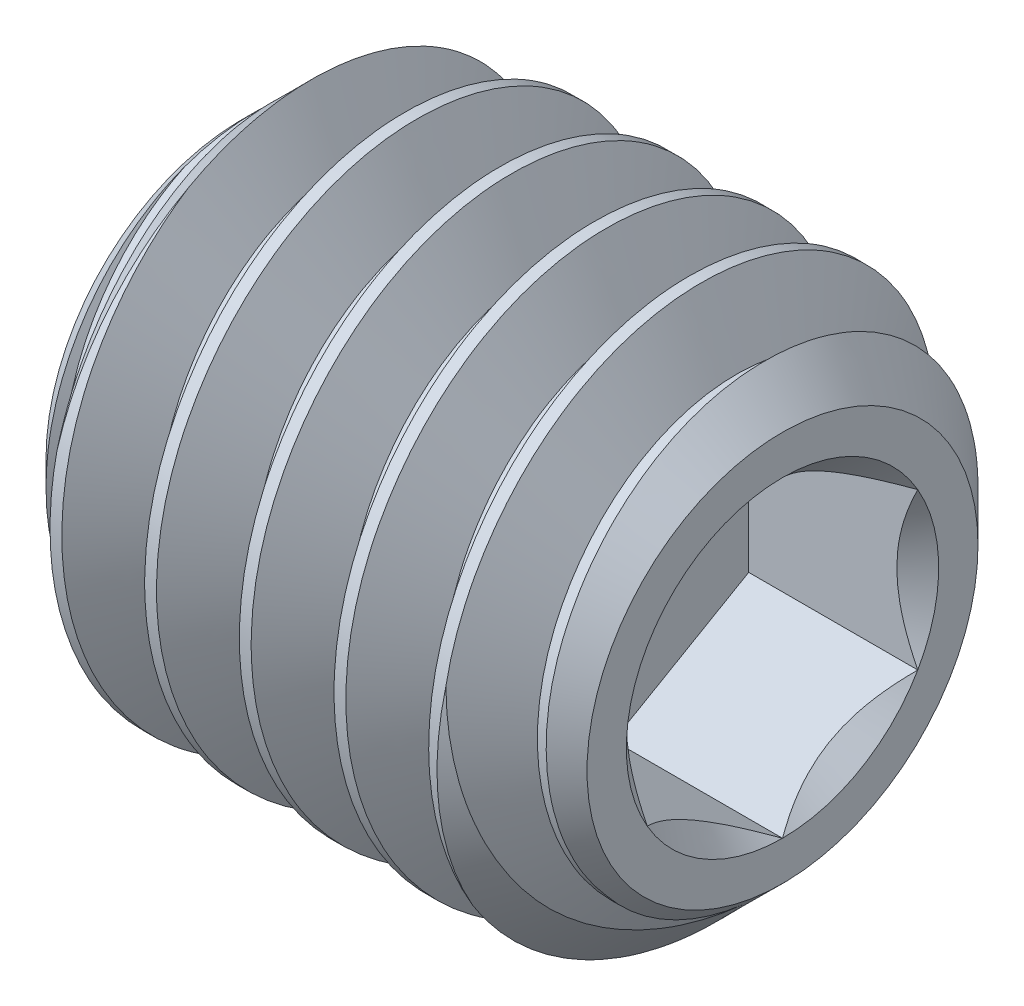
ISO-10303-21;
HEADER;
FILE_DESCRIPTION(('STEP AP214'),'2;1');
FILE_NAME('part.step','',(''),(''),'','','');
FILE_SCHEMA(('AUTOMOTIVE_DESIGN { 1 0 10303 214 1 1 1 1 }'));
ENDSEC;
DATA;
#1=APPLICATION_CONTEXT('core data for automotive mechanical design processes');
#2=APPLICATION_PROTOCOL_DEFINITION('international standard','automotive_design',2000,#1);
#3=PRODUCT_CONTEXT('',#1,'mechanical');
#4=PRODUCT('Part','Part','',(#3));
#5=PRODUCT_RELATED_PRODUCT_CATEGORY('part','',(#4));
#6=PRODUCT_DEFINITION_FORMATION('','',#4);
#7=PRODUCT_DEFINITION_CONTEXT('part definition',#1,'design');
#8=PRODUCT_DEFINITION('design','',#6,#7);
#9=PRODUCT_DEFINITION_SHAPE('','',#8);
#10=(LENGTH_UNIT() NAMED_UNIT(*) SI_UNIT(.MILLI.,.METRE.));
#11=(NAMED_UNIT(*) PLANE_ANGLE_UNIT() SI_UNIT($,.RADIAN.));
#12=(NAMED_UNIT(*) SI_UNIT($,.STERADIAN.) SOLID_ANGLE_UNIT());
#13=UNCERTAINTY_MEASURE_WITH_UNIT(LENGTH_MEASURE(1.E-05),#10,'distance_accuracy_value','');
#14=(GEOMETRIC_REPRESENTATION_CONTEXT(3) GLOBAL_UNCERTAINTY_ASSIGNED_CONTEXT((#13)) GLOBAL_UNIT_ASSIGNED_CONTEXT((#10,
#11,#12)) REPRESENTATION_CONTEXT('',''));
#15=CARTESIAN_POINT('',(0.,0.,0.));
#16=DIRECTION('',(0.,0.,1.));
#17=DIRECTION('',(1.,0.,0.));
#18=AXIS2_PLACEMENT_3D('',#15,#16,#17);
#19=CARTESIAN_POINT('',(-2.,0.,0.));
#20=DIRECTION('',(1.,0.,0.));
#21=DIRECTION('',(0.,0.,-1.));
#22=AXIS2_PLACEMENT_3D('',#19,#20,#21);
#23=CYLINDRICAL_SURFACE('',#22,2.);
#24=CARTESIAN_POINT('',(2.7,2.,0.));
#25=CARTESIAN_POINT('',(2.64166666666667,2.00000000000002,-1.15470053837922));
#26=CARTESIAN_POINT('',(2.58333333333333,1.00000000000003,-1.73205080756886));
#27=CARTESIAN_POINT('',(2.525,0.,-2.3094010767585));
#28=CARTESIAN_POINT('',(2.46666666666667,-0.999999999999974,-1.73205080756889));
#29=CARTESIAN_POINT('',(2.40833333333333,-1.99999999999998,-1.15470053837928));
#30=CARTESIAN_POINT('',(2.35,-2.,0.));
#31=CARTESIAN_POINT('',(2.29166666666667,-2.00000000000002,1.15470053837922));
#32=CARTESIAN_POINT('',(2.23333333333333,-1.00000000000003,1.73205080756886));
#33=CARTESIAN_POINT('',(2.175,0.,2.3094010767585));
#34=CARTESIAN_POINT('',(2.11666666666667,0.999999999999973,1.73205080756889));
#35=CARTESIAN_POINT('',(2.05833333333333,1.99999999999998,1.15470053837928));
#36=CARTESIAN_POINT('',(2.,2.,0.));
#37=CARTESIAN_POINT('',(1.94166666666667,2.00000000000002,-1.15470053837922));
#38=CARTESIAN_POINT('',(1.88333333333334,1.00000000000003,-1.73205080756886));
#39=CARTESIAN_POINT('',(1.825,0.,-2.3094010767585));
#40=CARTESIAN_POINT('',(1.76666666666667,-0.999999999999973,-1.73205080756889));
#41=CARTESIAN_POINT('',(1.70833333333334,-1.99999999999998,-1.15470053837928));
#42=CARTESIAN_POINT('',(1.65,-2.,0.));
#43=CARTESIAN_POINT('',(1.59166666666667,-2.00000000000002,1.15470053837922));
#44=CARTESIAN_POINT('',(1.53333333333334,-1.00000000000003,1.73205080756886));
#45=CARTESIAN_POINT('',(1.475,0.,2.3094010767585));
#46=CARTESIAN_POINT('',(1.41666666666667,0.999999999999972,1.73205080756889));
#47=CARTESIAN_POINT('',(1.35833333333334,1.99999999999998,1.15470053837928));
#48=CARTESIAN_POINT('',(1.3,2.,0.));
#49=CARTESIAN_POINT('',(1.24166666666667,2.00000000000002,-1.15470053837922));
#50=CARTESIAN_POINT('',(1.18333333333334,1.00000000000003,-1.73205080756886));
#51=CARTESIAN_POINT('',(1.125,0.,-2.3094010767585));
#52=CARTESIAN_POINT('',(1.06666666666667,-0.999999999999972,-1.73205080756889));
#53=CARTESIAN_POINT('',(1.00833333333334,-1.99999999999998,-1.15470053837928));
#54=CARTESIAN_POINT('',(0.950000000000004,-2.,0.));
#55=CARTESIAN_POINT('',(0.891666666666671,-2.00000000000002,1.15470053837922));
#56=CARTESIAN_POINT('',(0.833333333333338,-1.00000000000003,1.73205080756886));
#57=CARTESIAN_POINT('',(0.775000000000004,0.,2.3094010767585));
#58=CARTESIAN_POINT('',(0.716666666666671,0.999999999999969,1.7320508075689));
#59=CARTESIAN_POINT('',(0.658333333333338,1.99999999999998,1.15470053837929));
#60=CARTESIAN_POINT('',(0.600000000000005,2.,0.));
#61=CARTESIAN_POINT('',(0.541666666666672,2.00000000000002,-1.15470053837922));
#62=CARTESIAN_POINT('',(0.483333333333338,1.00000000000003,-1.73205080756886));
#63=CARTESIAN_POINT('',(0.425000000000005,0.,-2.3094010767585));
#64=CARTESIAN_POINT('',(0.366666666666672,-0.999999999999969,-1.7320508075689));
#65=CARTESIAN_POINT('',(0.308333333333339,-1.99999999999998,-1.15470053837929));
#66=CARTESIAN_POINT('',(0.250000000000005,-2.,0.));
#67=CARTESIAN_POINT('',(0.191666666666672,-2.00000000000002,1.15470053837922));
#68=CARTESIAN_POINT('',(0.133333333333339,-1.00000000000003,1.73205080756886));
#69=CARTESIAN_POINT('',(0.0750000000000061,0.,2.3094010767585));
#70=CARTESIAN_POINT('',(0.0166666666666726,0.999999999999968,1.7320508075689));
#71=CARTESIAN_POINT('',(-0.0416666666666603,1.99999999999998,1.15470053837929));
#72=CARTESIAN_POINT('',(-0.0999999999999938,2.,0.));
#73=CARTESIAN_POINT('',(-0.158333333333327,2.00000000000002,-1.15470053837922));
#74=CARTESIAN_POINT('',(-0.21666666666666,1.00000000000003,-1.73205080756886));
#75=CARTESIAN_POINT('',(-0.274999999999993,0.,-2.3094010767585));
#76=CARTESIAN_POINT('',(-0.333333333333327,-0.999999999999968,-1.7320508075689));
#77=CARTESIAN_POINT('',(-0.39166666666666,-1.99999999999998,-1.15470053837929));
#78=CARTESIAN_POINT('',(-0.449999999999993,-2.,0.));
#79=CARTESIAN_POINT('',(-0.508333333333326,-2.00000000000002,1.15470053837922));
#80=CARTESIAN_POINT('',(-0.566666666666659,-1.00000000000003,1.73205080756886));
#81=CARTESIAN_POINT('',(-0.624999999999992,0.,2.3094010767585));
#82=CARTESIAN_POINT('',(-0.683333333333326,0.999999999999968,1.7320508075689));
#83=CARTESIAN_POINT('',(-0.741666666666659,1.99999999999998,1.15470053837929));
#84=CARTESIAN_POINT('',(-0.799999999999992,2.,0.));
#85=CARTESIAN_POINT('',(-0.858333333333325,2.00000000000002,-1.15470053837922));
#86=CARTESIAN_POINT('',(-0.916666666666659,1.00000000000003,-1.73205080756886));
#87=CARTESIAN_POINT('',(-0.974999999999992,0.,-2.3094010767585));
#88=CARTESIAN_POINT('',(-1.03333333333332,-0.999999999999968,-1.7320508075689));
#89=CARTESIAN_POINT('',(-1.09166666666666,-1.99999999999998,-1.15470053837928));
#90=CARTESIAN_POINT('',(-1.14999999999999,-2.,0.));
#91=CARTESIAN_POINT('',(-1.20833333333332,-2.00000000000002,1.15470053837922));
#92=CARTESIAN_POINT('',(-1.26666666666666,-1.00000000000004,1.73205080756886));
#93=CARTESIAN_POINT('',(-1.32499999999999,0.,2.3094010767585));
#94=CARTESIAN_POINT('',(-1.38333333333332,0.999999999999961,1.7320508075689));
#95=CARTESIAN_POINT('',(-1.44166666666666,1.99999999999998,1.15470053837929));
#96=CARTESIAN_POINT('',(-1.49999999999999,2.,0.));
#97=CARTESIAN_POINT('',(-1.55833333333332,2.00000000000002,-1.15470053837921));
#98=CARTESIAN_POINT('',(-1.61666666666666,1.00000000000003,-1.73205080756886));
#99=CARTESIAN_POINT('',(-1.67499999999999,0.,-2.3094010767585));
#100=CARTESIAN_POINT('',(-1.73333333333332,-0.999999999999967,-1.7320508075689));
#101=CARTESIAN_POINT('',(-1.79166666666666,-1.99999999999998,-1.15470053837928));
#102=CARTESIAN_POINT('',(-1.84999999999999,-2.,0.));
#103=CARTESIAN_POINT('',(-1.90833333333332,-2.00000000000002,1.15470053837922));
#104=CARTESIAN_POINT('',(-1.96666666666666,-1.00000000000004,1.73205080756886));
#105=CARTESIAN_POINT('',(-2.02499999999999,0.,2.3094010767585));
#106=CARTESIAN_POINT('',(-2.08333333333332,0.999999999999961,1.7320508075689));
#107=CARTESIAN_POINT('',(-2.14166666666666,1.99999999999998,1.15470053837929));
#108=CARTESIAN_POINT('',(-2.19999999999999,2.,0.));
#109=CARTESIAN_POINT('',(-2.25833333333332,2.00000000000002,-1.15470053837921));
#110=CARTESIAN_POINT('',(-2.31666666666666,1.00000000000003,-1.73205080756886));
#111=CARTESIAN_POINT('',(-2.37499999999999,0.,-2.3094010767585));
#112=CARTESIAN_POINT('',(-2.43333333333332,-0.999999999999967,-1.7320508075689));
#113=CARTESIAN_POINT('',(-2.49166666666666,-1.99999999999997,-1.1547005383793));
#114=CARTESIAN_POINT('',(-2.54999999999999,-2.,0.));
#115=CARTESIAN_POINT('',(-2.60833333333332,-2.00000000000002,1.15470053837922));
#116=CARTESIAN_POINT('',(-2.66666666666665,-1.00000000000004,1.73205080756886));
#117=CARTESIAN_POINT('',(-2.72499999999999,0.,2.3094010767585));
#118=CARTESIAN_POINT('',(-2.78333333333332,0.999999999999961,1.7320508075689));
#119=CARTESIAN_POINT('',(-2.84166666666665,1.99999999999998,1.15470053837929));
#120=CARTESIAN_POINT('',(-2.89999999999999,2.,0.));
#121=CARTESIAN_POINT('',(-2.95833333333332,2.00000000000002,-1.15470053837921));
#122=CARTESIAN_POINT('',(-3.01666666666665,1.00000000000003,-1.73205080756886));
#123=CARTESIAN_POINT('',(-3.07499999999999,0.,-2.3094010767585));
#124=CARTESIAN_POINT('',(-3.13333333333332,-0.999999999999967,-1.7320508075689));
#125=CARTESIAN_POINT('',(-3.19166666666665,-1.99999999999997,-1.1547005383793));
#126=CARTESIAN_POINT('',(-3.24999999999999,-2.,0.));
#127=CARTESIAN_POINT('',(-3.30833333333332,-2.00000000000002,1.15470053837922));
#128=CARTESIAN_POINT('',(-3.36666666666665,-1.00000000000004,1.73205080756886));
#129=CARTESIAN_POINT('',(-3.42499999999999,0.,2.3094010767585));
#130=CARTESIAN_POINT('',(-3.48333333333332,0.99999999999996,1.7320508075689));
#131=CARTESIAN_POINT('',(-3.54166666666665,1.99999999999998,1.15470053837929));
#132=CARTESIAN_POINT('',(-3.59999999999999,2.,0.));
#133=CARTESIAN_POINT('',(-3.65833333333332,2.00000000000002,-1.15470053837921));
#134=CARTESIAN_POINT('',(-3.71666666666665,1.00000000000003,-1.73205080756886));
#135=CARTESIAN_POINT('',(-3.77499999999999,0.,-2.3094010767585));
#136=CARTESIAN_POINT('',(-3.83333333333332,-0.999999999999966,-1.7320508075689));
#137=CARTESIAN_POINT('',(-3.89166666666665,-1.99999999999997,-1.1547005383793));
#138=CARTESIAN_POINT('',(-3.94999999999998,-2.,0.));
#139=CARTESIAN_POINT('',(-4.00833333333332,-2.00000000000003,1.1547005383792));
#140=CARTESIAN_POINT('',(-4.06666666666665,-1.00000000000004,1.73205080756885));
#141=CARTESIAN_POINT('',(-4.12499999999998,0.,2.3094010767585));
#142=CARTESIAN_POINT('',(-4.18333333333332,0.99999999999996,1.7320508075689));
#143=CARTESIAN_POINT('',(-4.24166666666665,1.99999999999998,1.15470053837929));
#144=CARTESIAN_POINT('',(-4.29999999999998,2.,0.));
#145=CARTESIAN_POINT('',(-4.35833333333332,2.00000000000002,-1.15470053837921));
#146=CARTESIAN_POINT('',(-4.41666666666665,1.00000000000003,-1.73205080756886));
#147=CARTESIAN_POINT('',(-4.47499999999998,0.,-2.3094010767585));
#148=CARTESIAN_POINT('',(-4.53333333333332,-0.999999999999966,-1.7320508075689));
#149=CARTESIAN_POINT('',(-4.59166666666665,-1.99999999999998,-1.15470053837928));
#150=CARTESIAN_POINT('',(-4.64999999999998,-2.,0.));
#151=CARTESIAN_POINT('',(-4.70833333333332,-2.00000000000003,1.1547005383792));
#152=CARTESIAN_POINT('',(-4.76666666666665,-1.00000000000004,1.73205080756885));
#153=CARTESIAN_POINT('',(-4.82499999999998,0.,2.3094010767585));
#154=CARTESIAN_POINT('',(-4.88333333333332,0.999999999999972,1.73205080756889));
#155=CARTESIAN_POINT('',(-4.94166666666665,1.99999999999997,1.15470053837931));
#156=CARTESIAN_POINT('',(-4.99999999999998,2.,0.));
#157=CARTESIAN_POINT('',(-5.05833333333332,2.00000000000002,-1.15470053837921));
#158=CARTESIAN_POINT('',(-5.11666666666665,1.00000000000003,-1.73205080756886));
#159=CARTESIAN_POINT('',(-5.17499999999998,0.,-2.3094010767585));
#160=CARTESIAN_POINT('',(-5.23333333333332,-0.999999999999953,-1.7320508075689));
#161=CARTESIAN_POINT('',(-5.29166666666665,-1.99999999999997,-1.1547005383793));
#162=CARTESIAN_POINT('',(-5.34999999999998,-2.,0.));
#163=CARTESIAN_POINT('',(-5.40833333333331,-2.00000000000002,1.15470053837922));
#164=CARTESIAN_POINT('',(-5.46666666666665,-1.00000000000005,1.73205080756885));
#165=CARTESIAN_POINT('',(-5.52499999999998,0.,2.3094010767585));
#166=CARTESIAN_POINT('',(-5.58333333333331,0.999999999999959,1.7320508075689));
#167=CARTESIAN_POINT('',(-5.64166666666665,1.99999999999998,1.15470053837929));
#168=CARTESIAN_POINT('',(-5.69999999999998,2.,0.));
#169=(BOUNDED_CURVE() B_SPLINE_CURVE(2,(#24,#25,#26,#27,#28,#29,#30,#31,#32,#33,#34,#35,#36,#37,
#38,#39,#40,#41,#42,#43,#44,#45,#46,#47,#48,#49,#50,#51,#52,#53,#54,#55,#56,#57,#58,#59,#60,#61,
#62,#63,#64,#65,#66,#67,#68,#69,#70,#71,#72,#73,#74,#75,#76,#77,#78,#79,#80,#81,#82,#83,#84,#85,
#86,#87,#88,#89,#90,#91,#92,#93,#94,#95,#96,#97,#98,#99,#100,#101,#102,#103,#104,#105,#106,#107,
#108,#109,#110,#111,#112,#113,#114,#115,#116,#117,#118,#119,#120,#121,#122,#123,#124,#125,#126,
#127,#128,#129,#130,#131,#132,#133,#134,#135,#136,#137,#138,#139,#140,#141,#142,#143,#144,#145,
#146,#147,#148,#149,#150,#151,#152,#153,#154,#155,#156,#157,#158,#159,#160,#161,#162,#163,#164,
#165,#166,#167,#168),.UNSPECIFIED.,.F.,.F.) B_SPLINE_CURVE_WITH_KNOTS((3,2,2,2,2,2,2,2,2,2,2,2,
2,2,2,2,2,2,2,2,2,2,2,2,2,2,2,2,2,2,2,2,2,2,2,2,2,2,2,2,2,2,2,2,2,2,2,2,2,2,2,2,2,2,2,2,2,2,2,2,
2,2,2,2,2,2,2,2,2,2,2,2,3),(0.,0.0138888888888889,0.0277777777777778,0.0416666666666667,
0.0555555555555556,0.0694444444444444,0.0833333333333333,0.0972222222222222,0.111111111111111,
0.125,0.138888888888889,0.152777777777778,0.166666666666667,0.180555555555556,0.194444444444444,
0.208333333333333,0.222222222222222,0.236111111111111,0.25,0.263888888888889,0.277777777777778,
0.291666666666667,0.305555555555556,0.319444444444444,0.333333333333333,0.347222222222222,
0.361111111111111,0.375,0.388888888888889,0.402777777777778,0.416666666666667,0.430555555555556,
0.444444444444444,0.458333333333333,0.472222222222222,0.486111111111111,0.5,0.513888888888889,
0.527777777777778,0.541666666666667,0.555555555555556,0.569444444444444,0.583333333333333,
0.597222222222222,0.611111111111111,0.625,0.638888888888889,0.652777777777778,0.666666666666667,
0.680555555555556,0.694444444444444,0.708333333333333,0.722222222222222,0.736111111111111,0.75,
0.763888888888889,0.777777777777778,0.791666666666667,0.805555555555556,0.819444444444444,
0.833333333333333,0.847222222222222,0.861111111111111,0.875,0.888888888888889,0.902777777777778,
0.916666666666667,0.930555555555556,0.944444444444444,0.958333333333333,0.972222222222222,
0.986111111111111,1.),
.UNSPECIFIED.) CURVE() GEOMETRIC_REPRESENTATION_ITEM() RATIONAL_B_SPLINE_CURVE((1.,
0.866025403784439,1.,0.866025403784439,1.,0.866025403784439,1.,0.866025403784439,1.,
0.866025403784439,1.,0.866025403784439,1.,0.866025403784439,1.,0.866025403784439,1.,
0.866025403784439,1.,0.866025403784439,1.,0.866025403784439,1.,0.866025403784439,1.,
0.866025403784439,1.,0.866025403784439,1.,0.866025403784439,1.,0.866025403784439,1.,
0.866025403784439,1.,0.866025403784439,1.,0.866025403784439,1.,0.866025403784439,1.,
0.866025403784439,1.,0.866025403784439,1.,0.866025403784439,1.,0.866025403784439,1.,
0.866025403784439,1.,0.866025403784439,1.,0.866025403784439,1.,0.866025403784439,1.,
0.866025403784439,1.,0.866025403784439,1.,0.866025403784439,1.,0.866025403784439,1.,
0.866025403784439,1.,0.866025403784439,1.,0.866025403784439,1.,0.866025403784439,1.,
0.866025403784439,1.,0.866025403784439,1.,0.866025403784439,1.,0.866025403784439,1.,
0.866025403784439,1.,0.866025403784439,1.,0.866025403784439,1.,0.866025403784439,1.,
0.866025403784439,1.,0.866025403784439,1.,0.866025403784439,1.,0.866025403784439,1.,
0.866025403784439,1.,0.866025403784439,1.,0.866025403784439,1.,0.866025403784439,1.,
0.866025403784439,1.,0.866025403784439,1.,0.866025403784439,1.,0.866025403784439,1.,
0.866025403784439,1.,0.866025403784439,1.,0.866025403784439,1.,0.866025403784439,1.,
0.866025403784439,1.,0.866025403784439,1.,0.866025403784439,1.,0.866025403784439,1.,
0.866025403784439,1.,0.866025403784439,1.,0.866025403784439,1.,0.866025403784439,1.,
0.866025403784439,1.,0.866025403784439,1.,0.866025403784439,1.,0.866025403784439,1.)) REPRESENTATION_ITEM(''));
#170=CARTESIAN_POINT('',(1.44533666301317,0.50851434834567,1.93427328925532));
#171=VERTEX_POINT('',#170);
#172=CARTESIAN_POINT('',(-1.44533666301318,1.7626507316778,0.945019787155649));
#173=VERTEX_POINT('',#172);
#174=EDGE_CURVE('E295',#171,#173,#169,.T.);
#175=ORIENTED_EDGE('',*,*,#174,.T.);
#176=CARTESIAN_POINT('',(-1.44533666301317,0.,0.));
#177=DIRECTION('',(1.,0.,0.));
#178=DIRECTION('',(0.,0.,-1.));
#179=AXIS2_PLACEMENT_3D('',#176,#177,#178);
#180=CIRCLE('',#179,2.);
#181=CARTESIAN_POINT('',(-1.44533666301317,0.562914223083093,1.91914761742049));
#182=VERTEX_POINT('',#181);
#183=EDGE_CURVE('E297',#173,#182,#180,.T.);
#184=ORIENTED_EDGE('',*,*,#183,.T.);
#185=CARTESIAN_POINT('',(3.3125,2.,0.));
#186=CARTESIAN_POINT('',(3.25416666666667,2.00000000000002,-1.15470053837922));
#187=CARTESIAN_POINT('',(3.19583333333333,1.00000000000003,-1.73205080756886));
#188=CARTESIAN_POINT('',(3.1375,0.,-2.3094010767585));
#189=CARTESIAN_POINT('',(3.07916666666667,-0.999999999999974,-1.73205080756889));
#190=CARTESIAN_POINT('',(3.02083333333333,-1.99999999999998,-1.15470053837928));
#191=CARTESIAN_POINT('',(2.9625,-2.,0.));
#192=CARTESIAN_POINT('',(2.90416666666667,-2.00000000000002,1.15470053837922));
#193=CARTESIAN_POINT('',(2.84583333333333,-1.00000000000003,1.73205080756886));
#194=CARTESIAN_POINT('',(2.7875,0.,2.3094010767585));
#195=CARTESIAN_POINT('',(2.72916666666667,0.999999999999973,1.73205080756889));
#196=CARTESIAN_POINT('',(2.67083333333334,1.99999999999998,1.15470053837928));
#197=CARTESIAN_POINT('',(2.6125,2.,0.));
#198=CARTESIAN_POINT('',(2.55416666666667,2.00000000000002,-1.15470053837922));
#199=CARTESIAN_POINT('',(2.49583333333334,1.00000000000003,-1.73205080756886));
#200=CARTESIAN_POINT('',(2.4375,0.,-2.3094010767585));
#201=CARTESIAN_POINT('',(2.37916666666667,-0.999999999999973,-1.73205080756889));
#202=CARTESIAN_POINT('',(2.32083333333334,-1.99999999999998,-1.15470053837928));
#203=CARTESIAN_POINT('',(2.2625,-2.,0.));
#204=CARTESIAN_POINT('',(2.20416666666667,-2.00000000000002,1.15470053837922));
#205=CARTESIAN_POINT('',(2.14583333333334,-1.00000000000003,1.73205080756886));
#206=CARTESIAN_POINT('',(2.0875,0.,2.3094010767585));
#207=CARTESIAN_POINT('',(2.02916666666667,0.999999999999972,1.73205080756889));
#208=CARTESIAN_POINT('',(1.97083333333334,1.99999999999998,1.15470053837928));
#209=CARTESIAN_POINT('',(1.9125,2.,0.));
#210=CARTESIAN_POINT('',(1.85416666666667,2.00000000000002,-1.15470053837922));
#211=CARTESIAN_POINT('',(1.79583333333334,1.00000000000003,-1.73205080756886));
#212=CARTESIAN_POINT('',(1.7375,0.,-2.3094010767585));
#213=CARTESIAN_POINT('',(1.67916666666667,-0.999999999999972,-1.73205080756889));
#214=CARTESIAN_POINT('',(1.62083333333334,-1.99999999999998,-1.15470053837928));
#215=CARTESIAN_POINT('',(1.5625,-2.,0.));
#216=CARTESIAN_POINT('',(1.50416666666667,-2.00000000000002,1.15470053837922));
#217=CARTESIAN_POINT('',(1.44583333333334,-1.00000000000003,1.73205080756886));
#218=CARTESIAN_POINT('',(1.3875,0.,2.3094010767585));
#219=CARTESIAN_POINT('',(1.32916666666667,0.999999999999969,1.7320508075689));
#220=CARTESIAN_POINT('',(1.27083333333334,1.99999999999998,1.15470053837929));
#221=CARTESIAN_POINT('',(1.2125,2.,0.));
#222=CARTESIAN_POINT('',(1.15416666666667,2.00000000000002,-1.15470053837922));
#223=CARTESIAN_POINT('',(1.09583333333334,1.00000000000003,-1.73205080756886));
#224=CARTESIAN_POINT('',(1.03750000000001,0.,-2.3094010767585));
#225=CARTESIAN_POINT('',(0.979166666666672,-0.999999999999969,-1.7320508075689));
#226=CARTESIAN_POINT('',(0.920833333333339,-1.99999999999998,-1.15470053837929));
#227=CARTESIAN_POINT('',(0.862500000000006,-2.,0.));
#228=CARTESIAN_POINT('',(0.804166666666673,-2.00000000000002,1.15470053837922));
#229=CARTESIAN_POINT('',(0.745833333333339,-1.00000000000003,1.73205080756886));
#230=CARTESIAN_POINT('',(0.687500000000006,0.,2.3094010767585));
#231=CARTESIAN_POINT('',(0.629166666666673,0.999999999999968,1.7320508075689));
#232=CARTESIAN_POINT('',(0.57083333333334,1.99999999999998,1.15470053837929));
#233=CARTESIAN_POINT('',(0.512500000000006,2.,0.));
#234=CARTESIAN_POINT('',(0.454166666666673,2.00000000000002,-1.15470053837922));
#235=CARTESIAN_POINT('',(0.39583333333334,1.00000000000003,-1.73205080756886));
#236=CARTESIAN_POINT('',(0.337500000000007,0.,-2.3094010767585));
#237=CARTESIAN_POINT('',(0.279166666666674,-0.999999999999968,-1.7320508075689));
#238=CARTESIAN_POINT('',(0.220833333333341,-1.99999999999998,-1.15470053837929));
#239=CARTESIAN_POINT('',(0.162500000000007,-2.,0.));
#240=CARTESIAN_POINT('',(0.104166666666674,-2.00000000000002,1.15470053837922));
#241=CARTESIAN_POINT('',(0.0458333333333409,-1.00000000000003,1.73205080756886));
#242=CARTESIAN_POINT('',(-0.0124999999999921,0.,2.3094010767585));
#243=CARTESIAN_POINT('',(-0.0708333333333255,0.999999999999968,1.7320508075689));
#244=CARTESIAN_POINT('',(-0.129166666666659,1.99999999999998,1.15470053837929));
#245=CARTESIAN_POINT('',(-0.187499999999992,2.,0.));
#246=CARTESIAN_POINT('',(-0.245833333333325,2.00000000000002,-1.15470053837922));
#247=CARTESIAN_POINT('',(-0.304166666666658,1.00000000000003,-1.73205080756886));
#248=CARTESIAN_POINT('',(-0.362499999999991,0.,-2.3094010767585));
#249=CARTESIAN_POINT('',(-0.420833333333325,-0.999999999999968,-1.7320508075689));
#250=CARTESIAN_POINT('',(-0.479166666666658,-1.99999999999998,-1.15470053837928));
#251=CARTESIAN_POINT('',(-0.537499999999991,-2.,0.));
#252=CARTESIAN_POINT('',(-0.595833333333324,-2.00000000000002,1.15470053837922));
#253=CARTESIAN_POINT('',(-0.654166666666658,-1.00000000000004,1.73205080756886));
#254=CARTESIAN_POINT('',(-0.712499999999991,0.,2.3094010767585));
#255=CARTESIAN_POINT('',(-0.770833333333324,0.999999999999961,1.7320508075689));
#256=CARTESIAN_POINT('',(-0.829166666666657,1.99999999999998,1.15470053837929));
#257=CARTESIAN_POINT('',(-0.887499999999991,2.,0.));
#258=CARTESIAN_POINT('',(-0.945833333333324,2.00000000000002,-1.15470053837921));
#259=CARTESIAN_POINT('',(-1.00416666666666,1.00000000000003,-1.73205080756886));
#260=CARTESIAN_POINT('',(-1.06249999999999,0.,-2.3094010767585));
#261=CARTESIAN_POINT('',(-1.12083333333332,-0.999999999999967,-1.7320508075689));
#262=CARTESIAN_POINT('',(-1.17916666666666,-1.99999999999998,-1.15470053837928));
#263=CARTESIAN_POINT('',(-1.23749999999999,-2.,0.));
#264=CARTESIAN_POINT('',(-1.29583333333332,-2.00000000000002,1.15470053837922));
#265=CARTESIAN_POINT('',(-1.35416666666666,-1.00000000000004,1.73205080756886));
#266=CARTESIAN_POINT('',(-1.41249999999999,0.,2.3094010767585));
#267=CARTESIAN_POINT('',(-1.47083333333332,0.999999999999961,1.7320508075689));
#268=CARTESIAN_POINT('',(-1.52916666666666,1.99999999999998,1.15470053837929));
#269=CARTESIAN_POINT('',(-1.58749999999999,2.,0.));
#270=CARTESIAN_POINT('',(-1.64583333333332,2.00000000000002,-1.15470053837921));
#271=CARTESIAN_POINT('',(-1.70416666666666,1.00000000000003,-1.73205080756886));
#272=CARTESIAN_POINT('',(-1.76249999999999,0.,-2.3094010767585));
#273=CARTESIAN_POINT('',(-1.82083333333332,-0.999999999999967,-1.7320508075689));
#274=CARTESIAN_POINT('',(-1.87916666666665,-1.99999999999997,-1.1547005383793));
#275=CARTESIAN_POINT('',(-1.93749999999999,-2.,0.));
#276=CARTESIAN_POINT('',(-1.99583333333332,-2.00000000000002,1.15470053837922));
#277=CARTESIAN_POINT('',(-2.05416666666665,-1.00000000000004,1.73205080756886));
#278=CARTESIAN_POINT('',(-2.11249999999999,0.,2.3094010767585));
#279=CARTESIAN_POINT('',(-2.17083333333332,0.999999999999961,1.7320508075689));
#280=CARTESIAN_POINT('',(-2.22916666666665,1.99999999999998,1.15470053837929));
#281=CARTESIAN_POINT('',(-2.28749999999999,2.,0.));
#282=CARTESIAN_POINT('',(-2.34583333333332,2.00000000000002,-1.15470053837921));
#283=CARTESIAN_POINT('',(-2.40416666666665,1.00000000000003,-1.73205080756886));
#284=CARTESIAN_POINT('',(-2.46249999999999,0.,-2.3094010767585));
#285=CARTESIAN_POINT('',(-2.52083333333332,-0.999999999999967,-1.7320508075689));
#286=CARTESIAN_POINT('',(-2.57916666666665,-1.99999999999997,-1.1547005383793));
#287=CARTESIAN_POINT('',(-2.63749999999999,-2.,0.));
#288=CARTESIAN_POINT('',(-2.69583333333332,-2.00000000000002,1.15470053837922));
#289=CARTESIAN_POINT('',(-2.75416666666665,-1.00000000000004,1.73205080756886));
#290=CARTESIAN_POINT('',(-2.81249999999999,0.,2.3094010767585));
#291=CARTESIAN_POINT('',(-2.87083333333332,0.99999999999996,1.7320508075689));
#292=CARTESIAN_POINT('',(-2.92916666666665,1.99999999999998,1.15470053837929));
#293=CARTESIAN_POINT('',(-2.98749999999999,2.,0.));
#294=CARTESIAN_POINT('',(-3.04583333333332,2.00000000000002,-1.15470053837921));
#295=CARTESIAN_POINT('',(-3.10416666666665,1.00000000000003,-1.73205080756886));
#296=CARTESIAN_POINT('',(-3.16249999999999,0.,-2.3094010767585));
#297=CARTESIAN_POINT('',(-3.22083333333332,-0.999999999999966,-1.7320508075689));
#298=CARTESIAN_POINT('',(-3.27916666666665,-1.99999999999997,-1.1547005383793));
#299=CARTESIAN_POINT('',(-3.33749999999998,-2.,0.));
#300=CARTESIAN_POINT('',(-3.39583333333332,-2.00000000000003,1.1547005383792));
#301=CARTESIAN_POINT('',(-3.45416666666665,-1.00000000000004,1.73205080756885));
#302=CARTESIAN_POINT('',(-3.51249999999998,0.,2.3094010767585));
#303=CARTESIAN_POINT('',(-3.57083333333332,0.99999999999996,1.7320508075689));
#304=CARTESIAN_POINT('',(-3.62916666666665,1.99999999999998,1.15470053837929));
#305=CARTESIAN_POINT('',(-3.68749999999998,2.,0.));
#306=CARTESIAN_POINT('',(-3.74583333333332,2.00000000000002,-1.15470053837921));
#307=CARTESIAN_POINT('',(-3.80416666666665,1.00000000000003,-1.73205080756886));
#308=CARTESIAN_POINT('',(-3.86249999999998,0.,-2.3094010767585));
#309=CARTESIAN_POINT('',(-3.92083333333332,-0.999999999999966,-1.7320508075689));
#310=CARTESIAN_POINT('',(-3.97916666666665,-1.99999999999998,-1.15470053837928));
#311=CARTESIAN_POINT('',(-4.03749999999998,-2.,0.));
#312=CARTESIAN_POINT('',(-4.09583333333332,-2.00000000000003,1.1547005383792));
#313=CARTESIAN_POINT('',(-4.15416666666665,-1.00000000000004,1.73205080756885));
#314=CARTESIAN_POINT('',(-4.21249999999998,0.,2.3094010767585));
#315=CARTESIAN_POINT('',(-4.27083333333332,0.999999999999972,1.73205080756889));
#316=CARTESIAN_POINT('',(-4.32916666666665,1.99999999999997,1.15470053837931));
#317=CARTESIAN_POINT('',(-4.38749999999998,2.,0.));
#318=CARTESIAN_POINT('',(-4.44583333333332,2.00000000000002,-1.15470053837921));
#319=CARTESIAN_POINT('',(-4.50416666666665,1.00000000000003,-1.73205080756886));
#320=CARTESIAN_POINT('',(-4.56249999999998,0.,-2.3094010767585));
#321=CARTESIAN_POINT('',(-4.62083333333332,-0.999999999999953,-1.7320508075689));
#322=CARTESIAN_POINT('',(-4.67916666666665,-1.99999999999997,-1.1547005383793));
#323=CARTESIAN_POINT('',(-4.73749999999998,-2.,0.));
#324=CARTESIAN_POINT('',(-4.79583333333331,-2.00000000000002,1.15470053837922));
#325=CARTESIAN_POINT('',(-4.85416666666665,-1.00000000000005,1.73205080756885));
#326=CARTESIAN_POINT('',(-4.91249999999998,0.,2.3094010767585));
#327=CARTESIAN_POINT('',(-4.97083333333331,0.999999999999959,1.7320508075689));
#328=CARTESIAN_POINT('',(-5.02916666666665,1.99999999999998,1.15470053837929));
#329=CARTESIAN_POINT('',(-5.08749999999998,2.,0.));
#330=(BOUNDED_CURVE() B_SPLINE_CURVE(2,(#185,#186,#187,#188,#189,#190,#191,#192,#193,#194,#195,
#196,#197,#198,#199,#200,#201,#202,#203,#204,#205,#206,#207,#208,#209,#210,#211,#212,#213,#214,
#215,#216,#217,#218,#219,#220,#221,#222,#223,#224,#225,#226,#227,#228,#229,#230,#231,#232,#233,
#234,#235,#236,#237,#238,#239,#240,#241,#242,#243,#244,#245,#246,#247,#248,#249,#250,#251,#252,
#253,#254,#255,#256,#257,#258,#259,#260,#261,#262,#263,#264,#265,#266,#267,#268,#269,#270,#271,
#272,#273,#274,#275,#276,#277,#278,#279,#280,#281,#282,#283,#284,#285,#286,#287,#288,#289,#290,
#291,#292,#293,#294,#295,#296,#297,#298,#299,#300,#301,#302,#303,#304,#305,#306,#307,#308,#309,
#310,#311,#312,#313,#314,#315,#316,#317,#318,#319,#320,#321,#322,#323,#324,#325,#326,#327,#328,
#329),.UNSPECIFIED.,.F.,.F.) B_SPLINE_CURVE_WITH_KNOTS((3,2,2,2,2,2,2,2,2,2,2,2,2,2,2,2,2,2,2,2,
2,2,2,2,2,2,2,2,2,2,2,2,2,2,2,2,2,2,2,2,2,2,2,2,2,2,2,2,2,2,2,2,2,2,2,2,2,2,2,2,2,2,2,2,2,2,2,2,
2,2,2,2,3),(0.,0.0138888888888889,0.0277777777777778,0.0416666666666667,0.0555555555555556,
0.0694444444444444,0.0833333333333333,0.0972222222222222,0.111111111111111,0.125,
0.138888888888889,0.152777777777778,0.166666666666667,0.180555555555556,0.194444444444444,
0.208333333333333,0.222222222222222,0.236111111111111,0.25,0.263888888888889,0.277777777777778,
0.291666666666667,0.305555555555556,0.319444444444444,0.333333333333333,0.347222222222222,
0.361111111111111,0.375,0.388888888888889,0.402777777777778,0.416666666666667,0.430555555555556,
0.444444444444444,0.458333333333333,0.472222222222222,0.486111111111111,0.5,0.513888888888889,
0.527777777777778,0.541666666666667,0.555555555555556,0.569444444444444,0.583333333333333,
0.597222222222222,0.611111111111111,0.625,0.638888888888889,0.652777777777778,0.666666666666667,
0.680555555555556,0.694444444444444,0.708333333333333,0.722222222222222,0.736111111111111,0.75,
0.763888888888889,0.777777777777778,0.791666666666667,0.805555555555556,0.819444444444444,
0.833333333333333,0.847222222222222,0.861111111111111,0.875,0.888888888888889,0.902777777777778,
0.916666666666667,0.930555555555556,0.944444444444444,0.958333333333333,0.972222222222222,
0.986111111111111,1.),
.UNSPECIFIED.) CURVE() GEOMETRIC_REPRESENTATION_ITEM() RATIONAL_B_SPLINE_CURVE((1.,
0.866025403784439,1.,0.866025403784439,1.,0.866025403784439,1.,0.866025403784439,1.,
0.866025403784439,1.,0.866025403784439,1.,0.866025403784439,1.,0.866025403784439,1.,
0.866025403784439,1.,0.866025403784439,1.,0.866025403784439,1.,0.866025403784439,1.,
0.866025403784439,1.,0.866025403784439,1.,0.866025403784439,1.,0.866025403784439,1.,
0.866025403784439,1.,0.866025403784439,1.,0.866025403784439,1.,0.866025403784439,1.,
0.866025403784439,1.,0.866025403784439,1.,0.866025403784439,1.,0.866025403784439,1.,
0.866025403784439,1.,0.866025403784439,1.,0.866025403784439,1.,0.866025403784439,1.,
0.866025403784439,1.,0.866025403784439,1.,0.866025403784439,1.,0.866025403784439,1.,
0.866025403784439,1.,0.866025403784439,1.,0.866025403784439,1.,0.866025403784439,1.,
0.866025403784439,1.,0.866025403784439,1.,0.866025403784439,1.,0.866025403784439,1.,
0.866025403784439,1.,0.866025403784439,1.,0.866025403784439,1.,0.866025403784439,1.,
0.866025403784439,1.,0.866025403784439,1.,0.866025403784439,1.,0.866025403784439,1.,
0.866025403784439,1.,0.866025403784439,1.,0.866025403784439,1.,0.866025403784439,1.,
0.866025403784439,1.,0.866025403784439,1.,0.866025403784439,1.,0.866025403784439,1.,
0.866025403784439,1.,0.866025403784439,1.,0.866025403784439,1.,0.866025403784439,1.,
0.866025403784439,1.,0.866025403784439,1.,0.866025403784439,1.,0.866025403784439,1.,
0.866025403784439,1.,0.866025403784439,1.,0.866025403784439,1.,0.866025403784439,1.,
0.866025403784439,1.,0.866025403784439,1.,0.866025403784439,1.,0.866025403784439,1.)) REPRESENTATION_ITEM(''));
#331=CARTESIAN_POINT('',(1.44533666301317,-0.991485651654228,1.73693874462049));
#332=VERTEX_POINT('',#331);
#333=EDGE_CURVE('E301',#332,#182,#330,.T.);
#334=ORIENTED_EDGE('',*,*,#333,.F.);
#335=CARTESIAN_POINT('',(1.44533666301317,0.,0.));
#336=DIRECTION('',(-1.,0.,0.));
#337=DIRECTION('',(0.,0.,1.));
#338=AXIS2_PLACEMENT_3D('',#335,#336,#337);
#339=CIRCLE('',#338,2.);
#340=EDGE_CURVE('E299',#332,#171,#339,.T.);
#341=ORIENTED_EDGE('',*,*,#340,.T.);
#342=EDGE_LOOP('',(#175,#184,#334,#341));
#343=FACE_BOUND('',#342,.T.);
#344=ADVANCED_FACE('F36',(#343),#23,.T.);
#345=CARTESIAN_POINT('',(3.05,1.54533666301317,0.));
#346=CARTESIAN_POINT('',(2.99166666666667,1.54533666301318,-0.892200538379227));
#347=CARTESIAN_POINT('',(2.93333333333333,0.772668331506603,-1.33830080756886));
#348=CARTESIAN_POINT('',(2.875,0.,-1.7844010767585));
#349=CARTESIAN_POINT('',(2.81666666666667,-0.772668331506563,-1.33830080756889));
#350=CARTESIAN_POINT('',(2.75833333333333,-1.54533666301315,-0.892200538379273));
#351=CARTESIAN_POINT('',(2.7,-1.54533666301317,0.));
#352=CARTESIAN_POINT('',(2.64166666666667,-1.54533666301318,0.892200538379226));
#353=CARTESIAN_POINT('',(2.58333333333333,-0.772668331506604,1.33830080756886));
#354=CARTESIAN_POINT('',(2.525,0.,1.7844010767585));
#355=CARTESIAN_POINT('',(2.46666666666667,0.772668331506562,1.33830080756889));
#356=CARTESIAN_POINT('',(2.40833333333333,1.54533666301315,0.892200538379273));
#357=CARTESIAN_POINT('',(2.35,1.54533666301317,0.));
#358=CARTESIAN_POINT('',(2.29166666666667,1.54533666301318,-0.892200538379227));
#359=CARTESIAN_POINT('',(2.23333333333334,0.772668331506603,-1.33830080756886));
#360=CARTESIAN_POINT('',(2.175,0.,-1.7844010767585));
#361=CARTESIAN_POINT('',(2.11666666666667,-0.772668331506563,-1.33830080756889));
#362=CARTESIAN_POINT('',(2.05833333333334,-1.54533666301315,-0.892200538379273));
#363=CARTESIAN_POINT('',(2.,-1.54533666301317,0.));
#364=CARTESIAN_POINT('',(1.94166666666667,-1.54533666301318,0.892200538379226));
#365=CARTESIAN_POINT('',(1.88333333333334,-0.772668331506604,1.33830080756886));
#366=CARTESIAN_POINT('',(1.825,0.,1.7844010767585));
#367=CARTESIAN_POINT('',(1.76666666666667,0.772668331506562,1.33830080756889));
#368=CARTESIAN_POINT('',(1.70833333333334,1.54533666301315,0.892200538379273));
#369=CARTESIAN_POINT('',(1.65,1.54533666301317,0.));
#370=CARTESIAN_POINT('',(1.59166666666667,1.54533666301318,-0.892200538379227));
#371=CARTESIAN_POINT('',(1.53333333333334,0.772668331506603,-1.33830080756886));
#372=CARTESIAN_POINT('',(1.475,0.,-1.7844010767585));
#373=CARTESIAN_POINT('',(1.41666666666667,-0.772668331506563,-1.33830080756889));
#374=CARTESIAN_POINT('',(1.35833333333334,-1.54533666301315,-0.892200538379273));
#375=CARTESIAN_POINT('',(1.3,-1.54533666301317,0.));
#376=CARTESIAN_POINT('',(1.24166666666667,-1.54533666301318,0.892200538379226));
#377=CARTESIAN_POINT('',(1.18333333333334,-0.772668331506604,1.33830080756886));
#378=CARTESIAN_POINT('',(1.125,0.,1.7844010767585));
#379=CARTESIAN_POINT('',(1.06666666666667,0.772668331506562,1.33830080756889));
#380=CARTESIAN_POINT('',(1.00833333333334,1.54533666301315,0.892200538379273));
#381=CARTESIAN_POINT('',(0.950000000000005,1.54533666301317,0.));
#382=CARTESIAN_POINT('',(0.891666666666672,1.54533666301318,-0.892200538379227));
#383=CARTESIAN_POINT('',(0.833333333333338,0.772668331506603,-1.33830080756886));
#384=CARTESIAN_POINT('',(0.775000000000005,0.,-1.7844010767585));
#385=CARTESIAN_POINT('',(0.716666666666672,-0.772668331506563,-1.33830080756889));
#386=CARTESIAN_POINT('',(0.658333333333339,-1.54533666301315,-0.892200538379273));
#387=CARTESIAN_POINT('',(0.600000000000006,-1.54533666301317,0.));
#388=CARTESIAN_POINT('',(0.541666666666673,-1.54533666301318,0.892200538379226));
#389=CARTESIAN_POINT('',(0.483333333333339,-0.772668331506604,1.33830080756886));
#390=CARTESIAN_POINT('',(0.425000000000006,0.,1.7844010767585));
#391=CARTESIAN_POINT('',(0.366666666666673,0.772668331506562,1.33830080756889));
#392=CARTESIAN_POINT('',(0.30833333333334,1.54533666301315,0.892200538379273));
#393=CARTESIAN_POINT('',(0.250000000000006,1.54533666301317,0.));
#394=CARTESIAN_POINT('',(0.191666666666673,1.54533666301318,-0.892200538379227));
#395=CARTESIAN_POINT('',(0.13333333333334,0.772668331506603,-1.33830080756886));
#396=CARTESIAN_POINT('',(0.0750000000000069,0.,-1.7844010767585));
#397=CARTESIAN_POINT('',(0.0166666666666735,-0.772668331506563,-1.33830080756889));
#398=CARTESIAN_POINT('',(-0.0416666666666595,-1.54533666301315,-0.892200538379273));
#399=CARTESIAN_POINT('',(-0.0999999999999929,-1.54533666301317,0.));
#400=CARTESIAN_POINT('',(-0.158333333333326,-1.54533666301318,0.892200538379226));
#401=CARTESIAN_POINT('',(-0.216666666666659,-0.772668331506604,1.33830080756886));
#402=CARTESIAN_POINT('',(-0.274999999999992,0.,1.7844010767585));
#403=CARTESIAN_POINT('',(-0.333333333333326,0.772668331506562,1.33830080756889));
#404=CARTESIAN_POINT('',(-0.391666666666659,1.54533666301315,0.892200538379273));
#405=CARTESIAN_POINT('',(-0.449999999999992,1.54533666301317,0.));
#406=CARTESIAN_POINT('',(-0.508333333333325,1.54533666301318,-0.892200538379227));
#407=CARTESIAN_POINT('',(-0.566666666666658,0.772668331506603,-1.33830080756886));
#408=CARTESIAN_POINT('',(-0.624999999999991,0.,-1.7844010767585));
#409=CARTESIAN_POINT('',(-0.683333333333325,-0.772668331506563,-1.33830080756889));
#410=CARTESIAN_POINT('',(-0.741666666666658,-1.54533666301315,-0.892200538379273));
#411=CARTESIAN_POINT('',(-0.799999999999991,-1.54533666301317,0.));
#412=CARTESIAN_POINT('',(-0.858333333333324,-1.54533666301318,0.892200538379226));
#413=CARTESIAN_POINT('',(-0.916666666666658,-0.772668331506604,1.33830080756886));
#414=CARTESIAN_POINT('',(-0.974999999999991,0.,1.7844010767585));
#415=CARTESIAN_POINT('',(-1.03333333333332,0.772668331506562,1.33830080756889));
#416=CARTESIAN_POINT('',(-1.09166666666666,1.54533666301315,0.892200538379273));
#417=CARTESIAN_POINT('',(-1.14999999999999,1.54533666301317,0.));
#418=CARTESIAN_POINT('',(-1.20833333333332,1.54533666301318,-0.892200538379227));
#419=CARTESIAN_POINT('',(-1.26666666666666,0.772668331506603,-1.33830080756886));
#420=CARTESIAN_POINT('',(-1.32499999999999,0.,-1.7844010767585));
#421=CARTESIAN_POINT('',(-1.38333333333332,-0.772668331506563,-1.33830080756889));
#422=CARTESIAN_POINT('',(-1.44166666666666,-1.54533666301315,-0.892200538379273));
#423=CARTESIAN_POINT('',(-1.49999999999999,-1.54533666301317,0.));
#424=CARTESIAN_POINT('',(-1.55833333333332,-1.54533666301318,0.892200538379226));
#425=CARTESIAN_POINT('',(-1.61666666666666,-0.772668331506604,1.33830080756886));
#426=CARTESIAN_POINT('',(-1.67499999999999,0.,1.7844010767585));
#427=CARTESIAN_POINT('',(-1.73333333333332,0.772668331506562,1.33830080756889));
#428=CARTESIAN_POINT('',(-1.79166666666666,1.54533666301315,0.892200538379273));
#429=CARTESIAN_POINT('',(-1.84999999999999,1.54533666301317,0.));
#430=CARTESIAN_POINT('',(-1.90833333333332,1.54533666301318,-0.892200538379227));
#431=CARTESIAN_POINT('',(-1.96666666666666,0.772668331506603,-1.33830080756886));
#432=CARTESIAN_POINT('',(-2.02499999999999,0.,-1.7844010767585));
#433=CARTESIAN_POINT('',(-2.08333333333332,-0.772668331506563,-1.33830080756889));
#434=CARTESIAN_POINT('',(-2.14166666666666,-1.54533666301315,-0.892200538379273));
#435=CARTESIAN_POINT('',(-2.19999999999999,-1.54533666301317,0.));
#436=CARTESIAN_POINT('',(-2.25833333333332,-1.54533666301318,0.892200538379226));
#437=CARTESIAN_POINT('',(-2.31666666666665,-0.772668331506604,1.33830080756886));
#438=CARTESIAN_POINT('',(-2.37499999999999,0.,1.7844010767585));
#439=CARTESIAN_POINT('',(-2.43333333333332,0.772668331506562,1.33830080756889));
#440=CARTESIAN_POINT('',(-2.49166666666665,1.54533666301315,0.892200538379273));
#441=CARTESIAN_POINT('',(-2.54999999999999,1.54533666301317,0.));
#442=CARTESIAN_POINT('',(-2.60833333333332,1.54533666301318,-0.892200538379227));
#443=CARTESIAN_POINT('',(-2.66666666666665,0.772668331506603,-1.33830080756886));
#444=CARTESIAN_POINT('',(-2.72499999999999,0.,-1.7844010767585));
#445=CARTESIAN_POINT('',(-2.78333333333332,-0.772668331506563,-1.33830080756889));
#446=CARTESIAN_POINT('',(-2.84166666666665,-1.54533666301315,-0.892200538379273));
#447=CARTESIAN_POINT('',(-2.89999999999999,-1.54533666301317,0.));
#448=CARTESIAN_POINT('',(-2.95833333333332,-1.54533666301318,0.892200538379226));
#449=CARTESIAN_POINT('',(-3.01666666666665,-0.772668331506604,1.33830080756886));
#450=CARTESIAN_POINT('',(-3.07499999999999,0.,1.7844010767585));
#451=CARTESIAN_POINT('',(-3.13333333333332,0.772668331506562,1.33830080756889));
#452=CARTESIAN_POINT('',(-3.19166666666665,1.54533666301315,0.892200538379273));
#453=CARTESIAN_POINT('',(-3.24999999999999,1.54533666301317,0.));
#454=CARTESIAN_POINT('',(-3.30833333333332,1.54533666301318,-0.892200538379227));
#455=CARTESIAN_POINT('',(-3.36666666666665,0.772668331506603,-1.33830080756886));
#456=CARTESIAN_POINT('',(-3.42499999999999,0.,-1.7844010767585));
#457=CARTESIAN_POINT('',(-3.48333333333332,-0.772668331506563,-1.33830080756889));
#458=CARTESIAN_POINT('',(-3.54166666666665,-1.54533666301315,-0.892200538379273));
#459=CARTESIAN_POINT('',(-3.59999999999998,-1.54533666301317,0.));
#460=CARTESIAN_POINT('',(-3.65833333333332,-1.54533666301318,0.892200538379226));
#461=CARTESIAN_POINT('',(-3.71666666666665,-0.772668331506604,1.33830080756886));
#462=CARTESIAN_POINT('',(-3.77499999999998,0.,1.7844010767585));
#463=CARTESIAN_POINT('',(-3.83333333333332,0.772668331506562,1.33830080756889));
#464=CARTESIAN_POINT('',(-3.89166666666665,1.54533666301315,0.892200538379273));
#465=CARTESIAN_POINT('',(-3.94999999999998,1.54533666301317,0.));
#466=CARTESIAN_POINT('',(-4.00833333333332,1.54533666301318,-0.892200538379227));
#467=CARTESIAN_POINT('',(-4.06666666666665,0.772668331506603,-1.33830080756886));
#468=CARTESIAN_POINT('',(-4.12499999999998,0.,-1.7844010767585));
#469=CARTESIAN_POINT('',(-4.18333333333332,-0.772668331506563,-1.33830080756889));
#470=CARTESIAN_POINT('',(-4.24166666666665,-1.54533666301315,-0.892200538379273));
#471=CARTESIAN_POINT('',(-4.29999999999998,-1.54533666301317,0.));
#472=CARTESIAN_POINT('',(-4.35833333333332,-1.54533666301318,0.892200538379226));
#473=CARTESIAN_POINT('',(-4.41666666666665,-0.772668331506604,1.33830080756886));
#474=CARTESIAN_POINT('',(-4.47499999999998,0.,1.7844010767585));
#475=CARTESIAN_POINT('',(-4.53333333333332,0.772668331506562,1.33830080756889));
#476=CARTESIAN_POINT('',(-4.59166666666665,1.54533666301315,0.892200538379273));
#477=CARTESIAN_POINT('',(-4.64999999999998,1.54533666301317,0.));
#478=CARTESIAN_POINT('',(-4.70833333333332,1.54533666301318,-0.892200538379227));
#479=CARTESIAN_POINT('',(-4.76666666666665,0.772668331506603,-1.33830080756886));
#480=CARTESIAN_POINT('',(-4.82499999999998,0.,-1.7844010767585));
#481=CARTESIAN_POINT('',(-4.88333333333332,-0.772668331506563,-1.33830080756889));
#482=CARTESIAN_POINT('',(-4.94166666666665,-1.54533666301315,-0.892200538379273));
#483=CARTESIAN_POINT('',(-4.99999999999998,-1.54533666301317,0.));
#484=CARTESIAN_POINT('',(-5.05833333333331,-1.54533666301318,0.892200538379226));
#485=CARTESIAN_POINT('',(-5.11666666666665,-0.772668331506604,1.33830080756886));
#486=CARTESIAN_POINT('',(-5.17499999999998,0.,1.7844010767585));
#487=CARTESIAN_POINT('',(-5.23333333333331,0.772668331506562,1.33830080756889));
#488=CARTESIAN_POINT('',(-5.29166666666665,1.54533666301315,0.892200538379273));
#489=CARTESIAN_POINT('',(-5.34999999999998,1.54533666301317,0.));
#490=CARTESIAN_POINT('',(3.3125,2.,0.));
#491=CARTESIAN_POINT('',(3.25416666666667,2.00000000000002,-1.15470053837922));
#492=CARTESIAN_POINT('',(3.19583333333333,1.00000000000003,-1.73205080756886));
#493=CARTESIAN_POINT('',(3.1375,0.,-2.3094010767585));
#494=CARTESIAN_POINT('',(3.07916666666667,-0.999999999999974,-1.73205080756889));
#495=CARTESIAN_POINT('',(3.02083333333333,-1.99999999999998,-1.15470053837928));
#496=CARTESIAN_POINT('',(2.9625,-2.,0.));
#497=CARTESIAN_POINT('',(2.90416666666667,-2.00000000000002,1.15470053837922));
#498=CARTESIAN_POINT('',(2.84583333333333,-1.00000000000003,1.73205080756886));
#499=CARTESIAN_POINT('',(2.7875,0.,2.3094010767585));
#500=CARTESIAN_POINT('',(2.72916666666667,0.999999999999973,1.73205080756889));
#501=CARTESIAN_POINT('',(2.67083333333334,1.99999999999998,1.15470053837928));
#502=CARTESIAN_POINT('',(2.6125,2.,0.));
#503=CARTESIAN_POINT('',(2.55416666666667,2.00000000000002,-1.15470053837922));
#504=CARTESIAN_POINT('',(2.49583333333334,1.00000000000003,-1.73205080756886));
#505=CARTESIAN_POINT('',(2.4375,0.,-2.3094010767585));
#506=CARTESIAN_POINT('',(2.37916666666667,-0.999999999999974,-1.73205080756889));
#507=CARTESIAN_POINT('',(2.32083333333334,-1.99999999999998,-1.15470053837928));
#508=CARTESIAN_POINT('',(2.2625,-2.,0.));
#509=CARTESIAN_POINT('',(2.20416666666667,-2.00000000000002,1.15470053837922));
#510=CARTESIAN_POINT('',(2.14583333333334,-1.00000000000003,1.73205080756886));
#511=CARTESIAN_POINT('',(2.0875,0.,2.3094010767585));
#512=CARTESIAN_POINT('',(2.02916666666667,0.999999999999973,1.73205080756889));
#513=CARTESIAN_POINT('',(1.97083333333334,1.99999999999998,1.15470053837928));
#514=CARTESIAN_POINT('',(1.9125,2.,0.));
#515=CARTESIAN_POINT('',(1.85416666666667,2.00000000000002,-1.15470053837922));
#516=CARTESIAN_POINT('',(1.79583333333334,1.00000000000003,-1.73205080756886));
#517=CARTESIAN_POINT('',(1.7375,0.,-2.3094010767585));
#518=CARTESIAN_POINT('',(1.67916666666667,-0.999999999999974,-1.73205080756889));
#519=CARTESIAN_POINT('',(1.62083333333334,-1.99999999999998,-1.15470053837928));
#520=CARTESIAN_POINT('',(1.5625,-2.,0.));
#521=CARTESIAN_POINT('',(1.50416666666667,-2.00000000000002,1.15470053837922));
#522=CARTESIAN_POINT('',(1.44583333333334,-1.00000000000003,1.73205080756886));
#523=CARTESIAN_POINT('',(1.3875,0.,2.3094010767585));
#524=CARTESIAN_POINT('',(1.32916666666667,0.999999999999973,1.73205080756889));
#525=CARTESIAN_POINT('',(1.27083333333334,1.99999999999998,1.15470053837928));
#526=CARTESIAN_POINT('',(1.2125,2.,0.));
#527=CARTESIAN_POINT('',(1.15416666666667,2.00000000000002,-1.15470053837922));
#528=CARTESIAN_POINT('',(1.09583333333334,1.00000000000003,-1.73205080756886));
#529=CARTESIAN_POINT('',(1.03750000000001,0.,-2.3094010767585));
#530=CARTESIAN_POINT('',(0.979166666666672,-0.999999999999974,-1.73205080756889));
#531=CARTESIAN_POINT('',(0.920833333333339,-1.99999999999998,-1.15470053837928));
#532=CARTESIAN_POINT('',(0.862500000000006,-2.,0.));
#533=CARTESIAN_POINT('',(0.804166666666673,-2.00000000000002,1.15470053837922));
#534=CARTESIAN_POINT('',(0.745833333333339,-1.00000000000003,1.73205080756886));
#535=CARTESIAN_POINT('',(0.687500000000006,0.,2.3094010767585));
#536=CARTESIAN_POINT('',(0.629166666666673,0.999999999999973,1.73205080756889));
#537=CARTESIAN_POINT('',(0.57083333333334,1.99999999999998,1.15470053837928));
#538=CARTESIAN_POINT('',(0.512500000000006,2.,0.));
#539=CARTESIAN_POINT('',(0.454166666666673,2.00000000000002,-1.15470053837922));
#540=CARTESIAN_POINT('',(0.39583333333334,1.00000000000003,-1.73205080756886));
#541=CARTESIAN_POINT('',(0.337500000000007,0.,-2.3094010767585));
#542=CARTESIAN_POINT('',(0.279166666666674,-0.999999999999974,-1.73205080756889));
#543=CARTESIAN_POINT('',(0.220833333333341,-1.99999999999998,-1.15470053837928));
#544=CARTESIAN_POINT('',(0.162500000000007,-2.,0.));
#545=CARTESIAN_POINT('',(0.104166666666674,-2.00000000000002,1.15470053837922));
#546=CARTESIAN_POINT('',(0.0458333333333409,-1.00000000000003,1.73205080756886));
#547=CARTESIAN_POINT('',(-0.0124999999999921,0.,2.3094010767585));
#548=CARTESIAN_POINT('',(-0.0708333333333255,0.999999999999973,1.73205080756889));
#549=CARTESIAN_POINT('',(-0.129166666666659,1.99999999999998,1.15470053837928));
#550=CARTESIAN_POINT('',(-0.187499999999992,2.,0.));
#551=CARTESIAN_POINT('',(-0.245833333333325,2.00000000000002,-1.15470053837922));
#552=CARTESIAN_POINT('',(-0.304166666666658,1.00000000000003,-1.73205080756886));
#553=CARTESIAN_POINT('',(-0.362499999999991,0.,-2.3094010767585));
#554=CARTESIAN_POINT('',(-0.420833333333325,-0.999999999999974,-1.73205080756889));
#555=CARTESIAN_POINT('',(-0.479166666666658,-1.99999999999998,-1.15470053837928));
#556=CARTESIAN_POINT('',(-0.537499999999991,-2.,0.));
#557=CARTESIAN_POINT('',(-0.595833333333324,-2.00000000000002,1.15470053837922));
#558=CARTESIAN_POINT('',(-0.654166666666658,-1.00000000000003,1.73205080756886));
#559=CARTESIAN_POINT('',(-0.712499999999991,0.,2.3094010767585));
#560=CARTESIAN_POINT('',(-0.770833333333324,0.999999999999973,1.73205080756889));
#561=CARTESIAN_POINT('',(-0.829166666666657,1.99999999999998,1.15470053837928));
#562=CARTESIAN_POINT('',(-0.887499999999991,2.,0.));
#563=CARTESIAN_POINT('',(-0.945833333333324,2.00000000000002,-1.15470053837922));
#564=CARTESIAN_POINT('',(-1.00416666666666,1.00000000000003,-1.73205080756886));
#565=CARTESIAN_POINT('',(-1.06249999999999,0.,-2.3094010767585));
#566=CARTESIAN_POINT('',(-1.12083333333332,-0.999999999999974,-1.73205080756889));
#567=CARTESIAN_POINT('',(-1.17916666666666,-1.99999999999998,-1.15470053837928));
#568=CARTESIAN_POINT('',(-1.23749999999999,-2.,0.));
#569=CARTESIAN_POINT('',(-1.29583333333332,-2.00000000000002,1.15470053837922));
#570=CARTESIAN_POINT('',(-1.35416666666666,-1.00000000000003,1.73205080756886));
#571=CARTESIAN_POINT('',(-1.41249999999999,0.,2.3094010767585));
#572=CARTESIAN_POINT('',(-1.47083333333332,0.999999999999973,1.73205080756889));
#573=CARTESIAN_POINT('',(-1.52916666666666,1.99999999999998,1.15470053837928));
#574=CARTESIAN_POINT('',(-1.58749999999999,2.,0.));
#575=CARTESIAN_POINT('',(-1.64583333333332,2.00000000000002,-1.15470053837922));
#576=CARTESIAN_POINT('',(-1.70416666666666,1.00000000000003,-1.73205080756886));
#577=CARTESIAN_POINT('',(-1.76249999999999,0.,-2.3094010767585));
#578=CARTESIAN_POINT('',(-1.82083333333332,-0.999999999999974,-1.73205080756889));
#579=CARTESIAN_POINT('',(-1.87916666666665,-1.99999999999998,-1.15470053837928));
#580=CARTESIAN_POINT('',(-1.93749999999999,-2.,0.));
#581=CARTESIAN_POINT('',(-1.99583333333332,-2.00000000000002,1.15470053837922));
#582=CARTESIAN_POINT('',(-2.05416666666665,-1.00000000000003,1.73205080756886));
#583=CARTESIAN_POINT('',(-2.11249999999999,0.,2.3094010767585));
#584=CARTESIAN_POINT('',(-2.17083333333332,0.999999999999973,1.73205080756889));
#585=CARTESIAN_POINT('',(-2.22916666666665,1.99999999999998,1.15470053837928));
#586=CARTESIAN_POINT('',(-2.28749999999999,2.,0.));
#587=CARTESIAN_POINT('',(-2.34583333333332,2.00000000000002,-1.15470053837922));
#588=CARTESIAN_POINT('',(-2.40416666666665,1.00000000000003,-1.73205080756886));
#589=CARTESIAN_POINT('',(-2.46249999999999,0.,-2.3094010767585));
#590=CARTESIAN_POINT('',(-2.52083333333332,-0.999999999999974,-1.73205080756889));
#591=CARTESIAN_POINT('',(-2.57916666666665,-1.99999999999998,-1.15470053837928));
#592=CARTESIAN_POINT('',(-2.63749999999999,-2.,0.));
#593=CARTESIAN_POINT('',(-2.69583333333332,-2.00000000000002,1.15470053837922));
#594=CARTESIAN_POINT('',(-2.75416666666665,-1.00000000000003,1.73205080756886));
#595=CARTESIAN_POINT('',(-2.81249999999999,0.,2.3094010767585));
#596=CARTESIAN_POINT('',(-2.87083333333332,0.999999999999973,1.73205080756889));
#597=CARTESIAN_POINT('',(-2.92916666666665,1.99999999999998,1.15470053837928));
#598=CARTESIAN_POINT('',(-2.98749999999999,2.,0.));
#599=CARTESIAN_POINT('',(-3.04583333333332,2.00000000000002,-1.15470053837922));
#600=CARTESIAN_POINT('',(-3.10416666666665,1.00000000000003,-1.73205080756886));
#601=CARTESIAN_POINT('',(-3.16249999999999,0.,-2.3094010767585));
#602=CARTESIAN_POINT('',(-3.22083333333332,-0.999999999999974,-1.73205080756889));
#603=CARTESIAN_POINT('',(-3.27916666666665,-1.99999999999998,-1.15470053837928));
#604=CARTESIAN_POINT('',(-3.33749999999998,-2.,0.));
#605=CARTESIAN_POINT('',(-3.39583333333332,-2.00000000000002,1.15470053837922));
#606=CARTESIAN_POINT('',(-3.45416666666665,-1.00000000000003,1.73205080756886));
#607=CARTESIAN_POINT('',(-3.51249999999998,0.,2.3094010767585));
#608=CARTESIAN_POINT('',(-3.57083333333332,0.999999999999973,1.73205080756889));
#609=CARTESIAN_POINT('',(-3.62916666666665,1.99999999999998,1.15470053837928));
#610=CARTESIAN_POINT('',(-3.68749999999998,2.,0.));
#611=CARTESIAN_POINT('',(-3.74583333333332,2.00000000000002,-1.15470053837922));
#612=CARTESIAN_POINT('',(-3.80416666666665,1.00000000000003,-1.73205080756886));
#613=CARTESIAN_POINT('',(-3.86249999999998,0.,-2.3094010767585));
#614=CARTESIAN_POINT('',(-3.92083333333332,-0.999999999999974,-1.73205080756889));
#615=CARTESIAN_POINT('',(-3.97916666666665,-1.99999999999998,-1.15470053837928));
#616=CARTESIAN_POINT('',(-4.03749999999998,-2.,0.));
#617=CARTESIAN_POINT('',(-4.09583333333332,-2.00000000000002,1.15470053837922));
#618=CARTESIAN_POINT('',(-4.15416666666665,-1.00000000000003,1.73205080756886));
#619=CARTESIAN_POINT('',(-4.21249999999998,0.,2.3094010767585));
#620=CARTESIAN_POINT('',(-4.27083333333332,0.999999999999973,1.73205080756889));
#621=CARTESIAN_POINT('',(-4.32916666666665,1.99999999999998,1.15470053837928));
#622=CARTESIAN_POINT('',(-4.38749999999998,2.,0.));
#623=CARTESIAN_POINT('',(-4.44583333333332,2.00000000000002,-1.15470053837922));
#624=CARTESIAN_POINT('',(-4.50416666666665,1.00000000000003,-1.73205080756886));
#625=CARTESIAN_POINT('',(-4.56249999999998,0.,-2.3094010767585));
#626=CARTESIAN_POINT('',(-4.62083333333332,-0.999999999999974,-1.73205080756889));
#627=CARTESIAN_POINT('',(-4.67916666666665,-1.99999999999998,-1.15470053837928));
#628=CARTESIAN_POINT('',(-4.73749999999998,-2.,0.));
#629=CARTESIAN_POINT('',(-4.79583333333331,-2.00000000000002,1.15470053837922));
#630=CARTESIAN_POINT('',(-4.85416666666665,-1.00000000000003,1.73205080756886));
#631=CARTESIAN_POINT('',(-4.91249999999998,0.,2.3094010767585));
#632=CARTESIAN_POINT('',(-4.97083333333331,0.999999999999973,1.73205080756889));
#633=CARTESIAN_POINT('',(-5.02916666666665,1.99999999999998,1.15470053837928));
#634=CARTESIAN_POINT('',(-5.08749999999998,2.,0.));
#635=(BOUNDED_SURFACE() B_SPLINE_SURFACE(1,2,((#345,#346,#347,#348,#349,#350,#351,#352,#353,
#354,#355,#356,#357,#358,#359,#360,#361,#362,#363,#364,#365,#366,#367,#368,#369,#370,#371,#372,
#373,#374,#375,#376,#377,#378,#379,#380,#381,#382,#383,#384,#385,#386,#387,#388,#389,#390,#391,
#392,#393,#394,#395,#396,#397,#398,#399,#400,#401,#402,#403,#404,#405,#406,#407,#408,#409,#410,
#411,#412,#413,#414,#415,#416,#417,#418,#419,#420,#421,#422,#423,#424,#425,#426,#427,#428,#429,
#430,#431,#432,#433,#434,#435,#436,#437,#438,#439,#440,#441,#442,#443,#444,#445,#446,#447,#448,
#449,#450,#451,#452,#453,#454,#455,#456,#457,#458,#459,#460,#461,#462,#463,#464,#465,#466,#467,
#468,#469,#470,#471,#472,#473,#474,#475,#476,#477,#478,#479,#480,#481,#482,#483,#484,#485,#486,
#487,#488,#489),(#490,#491,#492,#493,#494,#495,#496,#497,#498,#499,#500,#501,#502,#503,#504,
#505,#506,#507,#508,#509,#510,#511,#512,#513,#514,#515,#516,#517,#518,#519,#520,#521,#522,#523,
#524,#525,#526,#527,#528,#529,#530,#531,#532,#533,#534,#535,#536,#537,#538,#539,#540,#541,#542,
#543,#544,#545,#546,#547,#548,#549,#550,#551,#552,#553,#554,#555,#556,#557,#558,#559,#560,#561,
#562,#563,#564,#565,#566,#567,#568,#569,#570,#571,#572,#573,#574,#575,#576,#577,#578,#579,#580,
#581,#582,#583,#584,#585,#586,#587,#588,#589,#590,#591,#592,#593,#594,#595,#596,#597,#598,#599,
#600,#601,#602,#603,#604,#605,#606,#607,#608,#609,#610,#611,#612,#613,#614,#615,#616,#617,#618,
#619,#620,#621,#622,#623,#624,#625,#626,#627,#628,#629,#630,#631,#632,#633,#634)),.UNSPECIFIED.,
.F.,.F.,.F.) B_SPLINE_SURFACE_WITH_KNOTS((2,2),(3,2,2,2,2,2,2,2,2,2,2,2,2,2,2,2,2,2,2,2,2,2,2,2,
2,2,2,2,2,2,2,2,2,2,2,2,2,2,2,2,2,2,2,2,2,2,2,2,2,2,2,2,2,2,2,2,2,2,2,2,2,2,2,2,2,2,2,2,2,2,2,2,
3),(0.,1.),(0.,0.0138888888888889,0.0277777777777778,0.0416666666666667,0.0555555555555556,
0.0694444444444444,0.0833333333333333,0.0972222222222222,0.111111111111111,0.125,
0.138888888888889,0.152777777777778,0.166666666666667,0.180555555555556,0.194444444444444,
0.208333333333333,0.222222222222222,0.236111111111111,0.25,0.263888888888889,0.277777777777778,
0.291666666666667,0.305555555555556,0.319444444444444,0.333333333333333,0.347222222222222,
0.361111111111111,0.375,0.388888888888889,0.402777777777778,0.416666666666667,0.430555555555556,
0.444444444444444,0.458333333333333,0.472222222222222,0.486111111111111,0.5,0.513888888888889,
0.527777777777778,0.541666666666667,0.555555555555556,0.569444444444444,0.583333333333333,
0.597222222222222,0.611111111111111,0.625,0.638888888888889,0.652777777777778,0.666666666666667,
0.680555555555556,0.694444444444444,0.708333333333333,0.722222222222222,0.736111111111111,0.75,
0.763888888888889,0.777777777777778,0.791666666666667,0.805555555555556,0.819444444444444,
0.833333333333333,0.847222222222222,0.861111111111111,0.875,0.888888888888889,0.902777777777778,
0.916666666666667,0.930555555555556,0.944444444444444,0.958333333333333,0.972222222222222,
0.986111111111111,1.),
.UNSPECIFIED.) GEOMETRIC_REPRESENTATION_ITEM() RATIONAL_B_SPLINE_SURFACE(((1.,0.866025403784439,
1.,0.866025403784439,1.,0.866025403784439,1.,0.866025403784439,1.,0.866025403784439,1.,
0.866025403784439,1.,0.866025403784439,1.,0.866025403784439,1.,0.866025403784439,1.,
0.866025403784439,1.,0.866025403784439,1.,0.866025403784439,1.,0.866025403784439,1.,
0.866025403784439,1.,0.866025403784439,1.,0.866025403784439,1.,0.866025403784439,1.,
0.866025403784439,1.,0.866025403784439,1.,0.866025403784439,1.,0.866025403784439,1.,
0.866025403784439,1.,0.866025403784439,1.,0.866025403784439,1.,0.866025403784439,1.,
0.866025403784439,1.,0.866025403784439,1.,0.866025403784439,1.,0.866025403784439,1.,
0.866025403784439,1.,0.866025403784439,1.,0.866025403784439,1.,0.866025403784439,1.,
0.866025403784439,1.,0.866025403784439,1.,0.866025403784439,1.,0.866025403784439,1.,
0.866025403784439,1.,0.866025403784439,1.,0.866025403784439,1.,0.866025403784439,1.,
0.866025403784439,1.,0.866025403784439,1.,0.866025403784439,1.,0.866025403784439,1.,
0.866025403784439,1.,0.866025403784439,1.,0.866025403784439,1.,0.866025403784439,1.,
0.866025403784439,1.,0.866025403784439,1.,0.866025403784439,1.,0.866025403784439,1.,
0.866025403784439,1.,0.866025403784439,1.,0.866025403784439,1.,0.866025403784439,1.,
0.866025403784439,1.,0.866025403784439,1.,0.866025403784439,1.,0.866025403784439,1.,
0.866025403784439,1.,0.866025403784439,1.,0.866025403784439,1.,0.866025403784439,1.,
0.866025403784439,1.,0.866025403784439,1.,0.866025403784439,1.,0.866025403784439,1.,
0.866025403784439,1.,0.866025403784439,1.,0.866025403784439,1.),(1.,0.866025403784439,1.,
0.866025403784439,1.,0.866025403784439,1.,0.866025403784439,1.,0.866025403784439,1.,
0.866025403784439,1.,0.866025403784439,1.,0.866025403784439,1.,0.866025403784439,1.,
0.866025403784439,1.,0.866025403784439,1.,0.866025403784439,1.,0.866025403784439,1.,
0.866025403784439,1.,0.866025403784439,1.,0.866025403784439,1.,0.866025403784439,1.,
0.866025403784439,1.,0.866025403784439,1.,0.866025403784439,1.,0.866025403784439,1.,
0.866025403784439,1.,0.866025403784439,1.,0.866025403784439,1.,0.866025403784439,1.,
0.866025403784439,1.,0.866025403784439,1.,0.866025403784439,1.,0.866025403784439,1.,
0.866025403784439,1.,0.866025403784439,1.,0.866025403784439,1.,0.866025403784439,1.,
0.866025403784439,1.,0.866025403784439,1.,0.866025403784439,1.,0.866025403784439,1.,
0.866025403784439,1.,0.866025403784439,1.,0.866025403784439,1.,0.866025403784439,1.,
0.866025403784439,1.,0.866025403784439,1.,0.866025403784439,1.,0.866025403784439,1.,
0.866025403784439,1.,0.866025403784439,1.,0.866025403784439,1.,0.866025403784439,1.,
0.866025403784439,1.,0.866025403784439,1.,0.866025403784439,1.,0.866025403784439,1.,
0.866025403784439,1.,0.866025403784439,1.,0.866025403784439,1.,0.866025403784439,1.,
0.866025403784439,1.,0.866025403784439,1.,0.866025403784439,1.,0.866025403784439,1.,
0.866025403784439,1.,0.866025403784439,1.,0.866025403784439,1.,0.866025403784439,1.,
0.866025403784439,1.,0.866025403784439,1.,0.866025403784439,1.,0.866025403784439,1.,
0.866025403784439,1.,0.866025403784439,1.,0.866025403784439,1.))) REPRESENTATION_ITEM('') SURFACE());
#636=CARTESIAN_POINT('',(-1.44533666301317,0.562914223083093,1.91914761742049));
#637=CARTESIAN_POINT('',(-1.45177818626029,0.607769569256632,1.89928070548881));
#638=CARTESIAN_POINT('',(-1.45818225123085,0.651916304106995,1.8778066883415));
#639=CARTESIAN_POINT('',(-1.47088505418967,0.738616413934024,1.83174059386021));
#640=CARTESIAN_POINT('',(-1.47718369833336,0.781168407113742,1.8071458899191));
#641=CARTESIAN_POINT('',(-1.48965451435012,0.864561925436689,1.75488354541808));
#642=CARTESIAN_POINT('',(-1.49582620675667,0.905397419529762,1.7272061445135));
#643=CARTESIAN_POINT('',(-1.50492995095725,0.965099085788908,1.68355584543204));
#644=CARTESIAN_POINT('',(-1.50793885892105,0.984740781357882,1.66865026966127));
#645=CARTESIAN_POINT('',(-1.51404953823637,1.0233769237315,1.63803785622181));
#646=CARTESIAN_POINT('',(-1.51715130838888,1.0423713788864,1.62233102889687));
#647=CARTESIAN_POINT('',(-1.52392752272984,1.08269604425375,1.58757265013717));
#648=CARTESIAN_POINT('',(-1.5276138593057,1.10391077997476,1.56838936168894));
#649=CARTESIAN_POINT('',(-1.5350805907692,1.14539064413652,1.52903947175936));
#650=CARTESIAN_POINT('',(-1.53886098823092,1.16565574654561,1.50887284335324));
#651=CARTESIAN_POINT('',(-1.55033277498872,1.22496424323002,1.4469666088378));
#652=CARTESIAN_POINT('',(-1.55815468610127,1.26252039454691,1.40382102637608));
#653=CARTESIAN_POINT('',(-1.58203750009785,1.36852501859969,1.26953725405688));
#654=CARTESIAN_POINT('',(-1.59856253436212,1.43059101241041,1.17330879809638));
#655=CARTESIAN_POINT('',(-1.63050353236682,1.5294271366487,0.982105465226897));
#656=CARTESIAN_POINT('',(-1.64584133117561,1.56822977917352,0.888158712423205));
#657=CARTESIAN_POINT('',(-1.66901720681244,1.61407318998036,0.743367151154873));
#658=CARTESIAN_POINT('',(-1.67677939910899,1.6273020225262,0.694401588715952));
#659=CARTESIAN_POINT('',(-1.69230804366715,1.64953816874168,0.595515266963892));
#660=CARTESIAN_POINT('',(-1.70007449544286,1.65854589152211,0.545594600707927));
#661=CARTESIAN_POINT('',(-1.71555433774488,1.67226977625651,0.445163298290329));
#662=CARTESIAN_POINT('',(-1.72326773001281,1.67698607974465,0.394652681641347));
#663=CARTESIAN_POINT('',(-1.73857758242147,1.68210215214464,0.293379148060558));
#664=CARTESIAN_POINT('',(-1.74617400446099,1.68250054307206,0.242616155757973));
#665=CARTESIAN_POINT('',(-1.76119238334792,1.67895713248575,0.141269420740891));
#666=CARTESIAN_POINT('',(-1.76861452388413,1.67502013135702,0.0906855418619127));
#667=CARTESIAN_POINT('',(-1.77951383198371,1.66594233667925,0.0151806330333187));
#668=CARTESIAN_POINT('',(-1.78310742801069,1.66238846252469,-0.0099221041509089));
#669=CARTESIAN_POINT('',(-1.79041527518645,1.65402717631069,-0.0599031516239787));
#670=CARTESIAN_POINT('',(-1.79412953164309,1.64921970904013,-0.0847814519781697));
#671=CARTESIAN_POINT('',(-1.80431151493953,1.63455848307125,-0.151655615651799));
#672=CARTESIAN_POINT('',(-1.81087889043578,1.62353336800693,-0.193386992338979));
#673=CARTESIAN_POINT('',(-1.82429370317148,1.59799133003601,-0.275722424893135));
#674=CARTESIAN_POINT('',(-1.83114129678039,1.58347243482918,-0.316325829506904));
#675=CARTESIAN_POINT('',(-1.85203149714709,1.5348721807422,-0.435837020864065));
#676=CARTESIAN_POINT('',(-1.86646298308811,1.49568700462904,-0.512719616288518));
#677=CARTESIAN_POINT('',(-1.88432508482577,1.44086522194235,-0.600818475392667));
#678=CARTESIAN_POINT('',(-1.8874422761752,1.43107233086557,-0.61594090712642));
#679=CARTESIAN_POINT('',(-1.89370166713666,1.41096443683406,-0.64580391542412));
#680=CARTESIAN_POINT('',(-1.89684383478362,1.40065003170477,-0.660544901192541));
#681=CARTESIAN_POINT('',(-1.90000000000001,1.39007300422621,-0.675101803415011));
#682=B_SPLINE_CURVE_WITH_KNOTS('',3,(#636,#637,#638,#639,#640,#641,#642,#643,#644,#645,#646,
#647,#648,#649,#650,#651,#652,#653,#654,#655,#656,#657,#658,#659,#660,#661,#662,#663,#664,#665,
#666,#667,#668,#669,#670,#671,#672,#673,#674,#675,#676,#677,#678,#679,#680,#681),.UNSPECIFIED.,
.F.,.F.,(4,2,2,2,2,2,2,2,2,2,2,2,2,2,2,2,2,2,2,2,2,2,4),(0.,0.1484028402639,0.296931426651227,
0.445944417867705,0.520448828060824,0.594952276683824,0.681434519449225,0.767919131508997,
0.940890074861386,1.28572541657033,1.59260025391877,1.74637920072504,1.9001432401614,
2.05390220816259,2.20771024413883,2.36134814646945,2.43814400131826,2.51494323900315,
2.64574546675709,2.77662170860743,3.03753374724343,3.09238230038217,3.14716934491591),.UNSPECIFIED.);
#683=CARTESIAN_POINT('',(-1.9,1.39007300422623,-0.67510180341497));
#684=VERTEX_POINT('',#683);
#685=EDGE_CURVE('E234',#182,#684,#682,.T.);
#686=CARTESIAN_POINT('',(3.05,1.54533666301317,0.));
#687=CARTESIAN_POINT('',(2.99166666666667,1.54533666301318,-0.892200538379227));
#688=CARTESIAN_POINT('',(2.93333333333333,0.772668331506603,-1.33830080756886));
#689=CARTESIAN_POINT('',(2.875,0.,-1.7844010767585));
#690=CARTESIAN_POINT('',(2.81666666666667,-0.772668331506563,-1.33830080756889));
#691=CARTESIAN_POINT('',(2.75833333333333,-1.54533666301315,-0.892200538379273));
#692=CARTESIAN_POINT('',(2.7,-1.54533666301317,0.));
#693=CARTESIAN_POINT('',(2.64166666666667,-1.54533666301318,0.892200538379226));
#694=CARTESIAN_POINT('',(2.58333333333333,-0.772668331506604,1.33830080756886));
#695=CARTESIAN_POINT('',(2.525,0.,1.7844010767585));
#696=CARTESIAN_POINT('',(2.46666666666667,0.772668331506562,1.33830080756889));
#697=CARTESIAN_POINT('',(2.40833333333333,1.54533666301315,0.892200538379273));
#698=CARTESIAN_POINT('',(2.35,1.54533666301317,0.));
#699=CARTESIAN_POINT('',(2.29166666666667,1.54533666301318,-0.892200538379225));
#700=CARTESIAN_POINT('',(2.23333333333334,0.772668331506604,-1.33830080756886));
#701=CARTESIAN_POINT('',(2.175,0.,-1.7844010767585));
#702=CARTESIAN_POINT('',(2.11666666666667,-0.772668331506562,-1.33830080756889));
#703=CARTESIAN_POINT('',(2.05833333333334,-1.54533666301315,-0.892200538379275));
#704=CARTESIAN_POINT('',(2.,-1.54533666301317,0.));
#705=CARTESIAN_POINT('',(1.94166666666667,-1.54533666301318,0.892200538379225));
#706=CARTESIAN_POINT('',(1.88333333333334,-0.772668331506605,1.33830080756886));
#707=CARTESIAN_POINT('',(1.825,0.,1.7844010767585));
#708=CARTESIAN_POINT('',(1.76666666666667,0.772668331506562,1.33830080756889));
#709=CARTESIAN_POINT('',(1.70833333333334,1.54533666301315,0.892200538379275));
#710=CARTESIAN_POINT('',(1.65,1.54533666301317,0.));
#711=CARTESIAN_POINT('',(1.59166666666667,1.54533666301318,-0.892200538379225));
#712=CARTESIAN_POINT('',(1.53333333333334,0.772668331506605,-1.33830080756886));
#713=CARTESIAN_POINT('',(1.475,0.,-1.7844010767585));
#714=CARTESIAN_POINT('',(1.41666666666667,-0.772668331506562,-1.33830080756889));
#715=CARTESIAN_POINT('',(1.35833333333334,-1.54533666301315,-0.892200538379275));
#716=CARTESIAN_POINT('',(1.3,-1.54533666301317,0.));
#717=CARTESIAN_POINT('',(1.24166666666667,-1.54533666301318,0.892200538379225));
#718=CARTESIAN_POINT('',(1.18333333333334,-0.772668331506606,1.33830080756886));
#719=CARTESIAN_POINT('',(1.125,0.,1.7844010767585));
#720=CARTESIAN_POINT('',(1.06666666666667,0.772668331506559,1.33830080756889));
#721=CARTESIAN_POINT('',(1.00833333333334,1.54533666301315,0.892200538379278));
#722=CARTESIAN_POINT('',(0.950000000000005,1.54533666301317,0.));
#723=CARTESIAN_POINT('',(0.891666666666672,1.54533666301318,-0.892200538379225));
#724=CARTESIAN_POINT('',(0.833333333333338,0.772668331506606,-1.33830080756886));
#725=CARTESIAN_POINT('',(0.775000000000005,0.,-1.7844010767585));
#726=CARTESIAN_POINT('',(0.716666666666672,-0.772668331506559,-1.33830080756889));
#727=CARTESIAN_POINT('',(0.658333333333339,-1.54533666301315,-0.892200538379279));
#728=CARTESIAN_POINT('',(0.600000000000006,-1.54533666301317,0.));
#729=CARTESIAN_POINT('',(0.541666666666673,-1.54533666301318,0.892200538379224));
#730=CARTESIAN_POINT('',(0.483333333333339,-0.772668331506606,1.33830080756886));
#731=CARTESIAN_POINT('',(0.425000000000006,0.,1.7844010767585));
#732=CARTESIAN_POINT('',(0.366666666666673,0.772668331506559,1.33830080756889));
#733=CARTESIAN_POINT('',(0.30833333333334,1.54533666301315,0.892200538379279));
#734=CARTESIAN_POINT('',(0.250000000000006,1.54533666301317,0.));
#735=CARTESIAN_POINT('',(0.191666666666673,1.54533666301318,-0.892200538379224));
#736=CARTESIAN_POINT('',(0.13333333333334,0.772668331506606,-1.33830080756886));
#737=CARTESIAN_POINT('',(0.0750000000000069,0.,-1.7844010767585));
#738=CARTESIAN_POINT('',(0.0166666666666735,-0.772668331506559,-1.33830080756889));
#739=CARTESIAN_POINT('',(-0.0416666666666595,-1.54533666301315,-0.892200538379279));
#740=CARTESIAN_POINT('',(-0.0999999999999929,-1.54533666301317,0.));
#741=CARTESIAN_POINT('',(-0.158333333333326,-1.54533666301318,0.892200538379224));
#742=CARTESIAN_POINT('',(-0.216666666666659,-0.772668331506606,1.33830080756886));
#743=CARTESIAN_POINT('',(-0.274999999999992,0.,1.7844010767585));
#744=CARTESIAN_POINT('',(-0.333333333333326,0.772668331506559,1.33830080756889));
#745=CARTESIAN_POINT('',(-0.391666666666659,1.54533666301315,0.892200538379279));
#746=CARTESIAN_POINT('',(-0.449999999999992,1.54533666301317,0.));
#747=CARTESIAN_POINT('',(-0.508333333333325,1.54533666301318,-0.892200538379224));
#748=CARTESIAN_POINT('',(-0.566666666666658,0.772668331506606,-1.33830080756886));
#749=CARTESIAN_POINT('',(-0.624999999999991,0.,-1.7844010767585));
#750=CARTESIAN_POINT('',(-0.683333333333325,-0.772668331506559,-1.33830080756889));
#751=CARTESIAN_POINT('',(-0.741666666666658,-1.54533666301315,-0.892200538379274));
#752=CARTESIAN_POINT('',(-0.799999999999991,-1.54533666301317,0.));
#753=CARTESIAN_POINT('',(-0.858333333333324,-1.54533666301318,0.892200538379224));
#754=CARTESIAN_POINT('',(-0.916666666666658,-0.772668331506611,1.33830080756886));
#755=CARTESIAN_POINT('',(-0.974999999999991,0.,1.7844010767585));
#756=CARTESIAN_POINT('',(-1.03333333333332,0.772668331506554,1.33830080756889));
#757=CARTESIAN_POINT('',(-1.09166666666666,1.54533666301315,0.892200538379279));
#758=CARTESIAN_POINT('',(-1.14999999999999,1.54533666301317,0.));
#759=CARTESIAN_POINT('',(-1.20833333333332,1.54533666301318,-0.892200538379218));
#760=CARTESIAN_POINT('',(-1.26666666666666,0.772668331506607,-1.33830080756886));
#761=CARTESIAN_POINT('',(-1.32499999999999,0.,-1.7844010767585));
#762=CARTESIAN_POINT('',(-1.38333333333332,-0.772668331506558,-1.33830080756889));
#763=CARTESIAN_POINT('',(-1.44166666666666,-1.54533666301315,-0.892200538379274));
#764=CARTESIAN_POINT('',(-1.49999999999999,-1.54533666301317,0.));
#765=CARTESIAN_POINT('',(-1.55833333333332,-1.54533666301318,0.892200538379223));
#766=CARTESIAN_POINT('',(-1.61666666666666,-0.772668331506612,1.33830080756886));
#767=CARTESIAN_POINT('',(-1.67499999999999,0.,1.7844010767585));
#768=CARTESIAN_POINT('',(-1.73333333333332,0.772668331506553,1.33830080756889));
#769=CARTESIAN_POINT('',(-1.79166666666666,1.54533666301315,0.89220053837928));
#770=CARTESIAN_POINT('',(-1.84999999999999,1.54533666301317,0.));
#771=CARTESIAN_POINT('',(-1.90833333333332,1.54533666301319,-0.892200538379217));
#772=CARTESIAN_POINT('',(-1.96666666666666,0.772668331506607,-1.33830080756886));
#773=CARTESIAN_POINT('',(-2.02499999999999,0.,-1.7844010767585));
#774=CARTESIAN_POINT('',(-2.08333333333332,-0.772668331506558,-1.33830080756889));
#775=CARTESIAN_POINT('',(-2.14166666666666,-1.54533666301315,-0.892200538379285));
#776=CARTESIAN_POINT('',(-2.19999999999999,-1.54533666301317,0.));
#777=CARTESIAN_POINT('',(-2.25833333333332,-1.54533666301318,0.892200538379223));
#778=CARTESIAN_POINT('',(-2.31666666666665,-0.772668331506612,1.33830080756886));
#779=CARTESIAN_POINT('',(-2.37499999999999,0.,1.7844010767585));
#780=CARTESIAN_POINT('',(-2.43333333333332,0.772668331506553,1.33830080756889));
#781=CARTESIAN_POINT('',(-2.49166666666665,1.54533666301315,0.89220053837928));
#782=CARTESIAN_POINT('',(-2.54999999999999,1.54533666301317,0.));
#783=CARTESIAN_POINT('',(-2.60833333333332,1.54533666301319,-0.892200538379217));
#784=CARTESIAN_POINT('',(-2.66666666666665,0.772668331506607,-1.33830080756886));
#785=CARTESIAN_POINT('',(-2.72499999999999,0.,-1.7844010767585));
#786=CARTESIAN_POINT('',(-2.78333333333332,-0.772668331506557,-1.33830080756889));
#787=CARTESIAN_POINT('',(-2.84166666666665,-1.54533666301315,-0.892200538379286));
#788=CARTESIAN_POINT('',(-2.89999999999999,-1.54533666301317,0.));
#789=CARTESIAN_POINT('',(-2.95833333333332,-1.54533666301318,0.892200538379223));
#790=CARTESIAN_POINT('',(-3.01666666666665,-0.772668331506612,1.33830080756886));
#791=CARTESIAN_POINT('',(-3.07499999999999,0.,1.7844010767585));
#792=CARTESIAN_POINT('',(-3.13333333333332,0.772668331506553,1.33830080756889));
#793=CARTESIAN_POINT('',(-3.19166666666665,1.54533666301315,0.89220053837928));
#794=CARTESIAN_POINT('',(-3.24999999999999,1.54533666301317,0.));
#795=CARTESIAN_POINT('',(-3.30833333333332,1.54533666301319,-0.892200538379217));
#796=CARTESIAN_POINT('',(-3.36666666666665,0.772668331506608,-1.33830080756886));
#797=CARTESIAN_POINT('',(-3.42499999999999,0.,-1.7844010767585));
#798=CARTESIAN_POINT('',(-3.48333333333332,-0.772668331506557,-1.33830080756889));
#799=CARTESIAN_POINT('',(-3.54166666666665,-1.54533666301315,-0.892200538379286));
#800=CARTESIAN_POINT('',(-3.59999999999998,-1.54533666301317,0.));
#801=CARTESIAN_POINT('',(-3.65833333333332,-1.54533666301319,0.892200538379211));
#802=CARTESIAN_POINT('',(-3.71666666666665,-0.772668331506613,1.33830080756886));
#803=CARTESIAN_POINT('',(-3.77499999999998,0.,1.7844010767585));
#804=CARTESIAN_POINT('',(-3.83333333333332,0.772668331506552,1.33830080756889));
#805=CARTESIAN_POINT('',(-3.89166666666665,1.54533666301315,0.892200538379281));
#806=CARTESIAN_POINT('',(-3.94999999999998,1.54533666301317,0.));
#807=CARTESIAN_POINT('',(-4.00833333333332,1.54533666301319,-0.892200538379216));
#808=CARTESIAN_POINT('',(-4.06666666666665,0.772668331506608,-1.33830080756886));
#809=CARTESIAN_POINT('',(-4.12499999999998,0.,-1.7844010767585));
#810=CARTESIAN_POINT('',(-4.18333333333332,-0.772668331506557,-1.33830080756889));
#811=CARTESIAN_POINT('',(-4.24166666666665,-1.54533666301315,-0.892200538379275));
#812=CARTESIAN_POINT('',(-4.29999999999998,-1.54533666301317,0.));
#813=CARTESIAN_POINT('',(-4.35833333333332,-1.54533666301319,0.892200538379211));
#814=CARTESIAN_POINT('',(-4.41666666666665,-0.772668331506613,1.33830080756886));
#815=CARTESIAN_POINT('',(-4.47499999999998,0.,1.7844010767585));
#816=CARTESIAN_POINT('',(-4.53333333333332,0.772668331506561,1.33830080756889));
#817=CARTESIAN_POINT('',(-4.59166666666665,1.54533666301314,0.892200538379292));
#818=CARTESIAN_POINT('',(-4.64999999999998,1.54533666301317,0.));
#819=CARTESIAN_POINT('',(-4.70833333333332,1.54533666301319,-0.892200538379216));
#820=CARTESIAN_POINT('',(-4.76666666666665,0.772668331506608,-1.33830080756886));
#821=CARTESIAN_POINT('',(-4.82499999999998,0.,-1.7844010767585));
#822=CARTESIAN_POINT('',(-4.88333333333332,-0.772668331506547,-1.3383008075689));
#823=CARTESIAN_POINT('',(-4.94166666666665,-1.54533666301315,-0.892200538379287));
#824=CARTESIAN_POINT('',(-4.99999999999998,-1.54533666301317,0.));
#825=CARTESIAN_POINT('',(-5.05833333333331,-1.54533666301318,0.892200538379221));
#826=CARTESIAN_POINT('',(-5.11666666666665,-0.772668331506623,1.33830080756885));
#827=CARTESIAN_POINT('',(-5.17499999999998,0.,1.7844010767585));
#828=CARTESIAN_POINT('',(-5.23333333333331,0.772668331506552,1.33830080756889));
#829=CARTESIAN_POINT('',(-5.29166666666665,1.54533666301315,0.892200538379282));
#830=CARTESIAN_POINT('',(-5.34999999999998,1.54533666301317,0.));
#831=(BOUNDED_CURVE() B_SPLINE_CURVE(2,(#686,#687,#688,#689,#690,#691,#692,#693,#694,#695,#696,
#697,#698,#699,#700,#701,#702,#703,#704,#705,#706,#707,#708,#709,#710,#711,#712,#713,#714,#715,
#716,#717,#718,#719,#720,#721,#722,#723,#724,#725,#726,#727,#728,#729,#730,#731,#732,#733,#734,
#735,#736,#737,#738,#739,#740,#741,#742,#743,#744,#745,#746,#747,#748,#749,#750,#751,#752,#753,
#754,#755,#756,#757,#758,#759,#760,#761,#762,#763,#764,#765,#766,#767,#768,#769,#770,#771,#772,
#773,#774,#775,#776,#777,#778,#779,#780,#781,#782,#783,#784,#785,#786,#787,#788,#789,#790,#791,
#792,#793,#794,#795,#796,#797,#798,#799,#800,#801,#802,#803,#804,#805,#806,#807,#808,#809,#810,
#811,#812,#813,#814,#815,#816,#817,#818,#819,#820,#821,#822,#823,#824,#825,#826,#827,#828,#829,
#830),.UNSPECIFIED.,.F.,.F.) B_SPLINE_CURVE_WITH_KNOTS((3,2,2,2,2,2,2,2,2,2,2,2,2,2,2,2,2,2,2,2,
2,2,2,2,2,2,2,2,2,2,2,2,2,2,2,2,2,2,2,2,2,2,2,2,2,2,2,2,2,2,2,2,2,2,2,2,2,2,2,2,2,2,2,2,2,2,2,2,
2,2,2,2,3),(0.,0.0138888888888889,0.0277777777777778,0.0416666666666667,0.0555555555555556,
0.0694444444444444,0.0833333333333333,0.0972222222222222,0.111111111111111,0.125,
0.138888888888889,0.152777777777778,0.166666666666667,0.180555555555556,0.194444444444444,
0.208333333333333,0.222222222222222,0.236111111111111,0.25,0.263888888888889,0.277777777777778,
0.291666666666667,0.305555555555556,0.319444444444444,0.333333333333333,0.347222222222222,
0.361111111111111,0.375,0.388888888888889,0.402777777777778,0.416666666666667,0.430555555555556,
0.444444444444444,0.458333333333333,0.472222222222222,0.486111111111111,0.5,0.513888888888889,
0.527777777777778,0.541666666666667,0.555555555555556,0.569444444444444,0.583333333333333,
0.597222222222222,0.611111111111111,0.625,0.638888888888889,0.652777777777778,0.666666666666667,
0.680555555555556,0.694444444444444,0.708333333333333,0.722222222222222,0.736111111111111,0.75,
0.763888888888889,0.777777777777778,0.791666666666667,0.805555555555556,0.819444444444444,
0.833333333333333,0.847222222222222,0.861111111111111,0.875,0.888888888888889,0.902777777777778,
0.916666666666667,0.930555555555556,0.944444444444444,0.958333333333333,0.972222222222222,
0.986111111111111,1.),
.UNSPECIFIED.) CURVE() GEOMETRIC_REPRESENTATION_ITEM() RATIONAL_B_SPLINE_CURVE((1.,
0.866025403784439,1.,0.866025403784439,1.,0.866025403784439,1.,0.866025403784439,1.,
0.866025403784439,1.,0.866025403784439,1.,0.866025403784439,1.,0.866025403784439,1.,
0.866025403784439,1.,0.866025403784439,1.,0.866025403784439,1.,0.866025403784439,1.,
0.866025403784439,1.,0.866025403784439,1.,0.866025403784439,1.,0.866025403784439,1.,
0.866025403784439,1.,0.866025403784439,1.,0.866025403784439,1.,0.866025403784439,1.,
0.866025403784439,1.,0.866025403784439,1.,0.866025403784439,1.,0.866025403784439,1.,
0.866025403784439,1.,0.866025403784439,1.,0.866025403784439,1.,0.866025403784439,1.,
0.866025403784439,1.,0.866025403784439,1.,0.866025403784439,1.,0.866025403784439,1.,
0.866025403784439,1.,0.866025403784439,1.,0.866025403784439,1.,0.866025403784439,1.,
0.866025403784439,1.,0.866025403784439,1.,0.866025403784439,1.,0.866025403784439,1.,
0.866025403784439,1.,0.866025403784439,1.,0.866025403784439,1.,0.866025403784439,1.,
0.866025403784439,1.,0.866025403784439,1.,0.866025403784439,1.,0.866025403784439,1.,
0.866025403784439,1.,0.866025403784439,1.,0.866025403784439,1.,0.866025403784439,1.,
0.866025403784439,1.,0.866025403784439,1.,0.866025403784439,1.,0.866025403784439,1.,
0.866025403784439,1.,0.866025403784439,1.,0.866025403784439,1.,0.866025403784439,1.,
0.866025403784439,1.,0.866025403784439,1.,0.866025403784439,1.,0.866025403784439,1.,
0.866025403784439,1.,0.866025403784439,1.,0.866025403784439,1.,0.866025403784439,1.,
0.866025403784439,1.,0.866025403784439,1.,0.866025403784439,1.,0.866025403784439,1.)) REPRESENTATION_ITEM(''));
#832=CARTESIAN_POINT('',(1.9,-0.97408659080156,1.19967525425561));
#833=VERTEX_POINT('',#832);
#834=EDGE_CURVE('E305',#833,#684,#831,.T.);
#835=CARTESIAN_POINT('',(1.9,-0.974086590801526,1.19967525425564));
#836=CARTESIAN_POINT('',(1.89903758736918,-0.957993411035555,1.21398228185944));
#837=CARTESIAN_POINT('',(1.89808479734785,-0.941594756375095,1.22794570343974));
#838=CARTESIAN_POINT('',(1.89619790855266,-0.908219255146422,1.25516182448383));
#839=CARTESIAN_POINT('',(1.89526380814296,-0.891242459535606,1.26841458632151));
#840=CARTESIAN_POINT('',(1.89341387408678,-0.856746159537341,1.29418424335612));
#841=CARTESIAN_POINT('',(1.89249803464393,-0.839226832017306,1.30670137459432));
#842=CARTESIAN_POINT('',(1.8906963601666,-0.803667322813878,1.330972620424));
#843=CARTESIAN_POINT('',(1.88981052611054,-0.785627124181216,1.34272671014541));
#844=CARTESIAN_POINT('',(1.88713454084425,-0.730847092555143,1.37684470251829));
#845=CARTESIAN_POINT('',(1.88532378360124,-0.693405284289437,1.39809590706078));
#846=CARTESIAN_POINT('',(1.88163308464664,-0.616941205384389,1.4374986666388));
#847=CARTESIAN_POINT('',(1.87975313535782,-0.577918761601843,1.45564988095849));
#848=CARTESIAN_POINT('',(1.87397671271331,-0.457524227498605,1.50580621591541));
#849=CARTESIAN_POINT('',(1.87000053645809,-0.37398990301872,1.53278774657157));
#850=CARTESIAN_POINT('',(1.86195548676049,-0.203660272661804,1.57266154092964));
#851=CARTESIAN_POINT('',(1.85788659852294,-0.116864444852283,1.58555153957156));
#852=CARTESIAN_POINT('',(1.84967016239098,0.0597779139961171,1.59705376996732));
#853=CARTESIAN_POINT('',(1.84552308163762,0.149647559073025,1.59531447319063));
#854=CARTESIAN_POINT('',(1.83736096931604,0.32784846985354,1.57673684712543));
#855=CARTESIAN_POINT('',(1.83334591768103,0.416179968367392,1.55990082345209));
#856=CARTESIAN_POINT('',(1.82751001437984,0.545518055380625,1.52373969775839));
#857=CARTESIAN_POINT('',(1.8255953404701,0.588115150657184,1.50986298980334));
#858=CARTESIAN_POINT('',(1.82183324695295,0.672004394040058,1.47857057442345));
#859=CARTESIAN_POINT('',(1.81998582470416,0.713296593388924,1.46115500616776));
#860=CARTESIAN_POINT('',(1.81639013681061,0.79426721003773,1.42288776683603));
#861=CARTESIAN_POINT('',(1.81464189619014,0.833945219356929,1.40203523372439));
#862=CARTESIAN_POINT('',(1.81105948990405,0.911498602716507,1.35721604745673));
#863=CARTESIAN_POINT('',(1.8092253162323,0.949373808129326,1.33324910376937));
#864=CARTESIAN_POINT('',(1.80547332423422,1.02364730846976,1.28193698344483));
#865=CARTESIAN_POINT('',(1.80355464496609,1.06001309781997,1.25454469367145));
#866=CARTESIAN_POINT('',(1.79967089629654,1.13037099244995,1.19688967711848));
#867=CARTESIAN_POINT('',(1.79770582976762,1.16436324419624,1.16662712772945));
#868=CARTESIAN_POINT('',(1.79176331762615,1.26243768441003,1.0718166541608));
#869=CARTESIAN_POINT('',(1.78773553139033,1.322677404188,1.00320448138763));
#870=CARTESIAN_POINT('',(1.77954157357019,1.43277303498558,0.854876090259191));
#871=CARTESIAN_POINT('',(1.77537491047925,1.48225852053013,0.774886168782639));
#872=CARTESIAN_POINT('',(1.76714162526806,1.56708502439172,0.607740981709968));
#873=CARTESIAN_POINT('',(1.76307498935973,1.60242800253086,0.520586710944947));
#874=CARTESIAN_POINT('',(1.75514478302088,1.65796793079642,0.341539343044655));
#875=CARTESIAN_POINT('',(1.75128118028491,1.67816729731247,0.249647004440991));
#876=CARTESIAN_POINT('',(1.74572747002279,1.6966743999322,0.110316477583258));
#877=CARTESIAN_POINT('',(1.74391560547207,1.70087719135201,0.0635987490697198));
#878=CARTESIAN_POINT('',(1.74125137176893,1.70423314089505,-0.0066200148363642));
#879=CARTESIAN_POINT('',(1.74037214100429,1.70486033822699,-0.0300521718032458));
#880=CARTESIAN_POINT('',(1.73858719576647,1.70517603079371,-0.0769258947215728));
#881=CARTESIAN_POINT('',(1.73768147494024,1.70486429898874,-0.100367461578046));
#882=CARTESIAN_POINT('',(1.73492753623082,1.70249329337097,-0.171001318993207));
#883=CARTESIAN_POINT('',(1.7330556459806,1.69898158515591,-0.218154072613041));
#884=CARTESIAN_POINT('',(1.72925638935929,1.68813882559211,-0.312012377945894));
#885=CARTESIAN_POINT('',(1.72732900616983,1.68080660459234,-0.358717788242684));
#886=CARTESIAN_POINT('',(1.72148733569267,1.65313360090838,-0.497684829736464));
#887=CARTESIAN_POINT('',(1.7175101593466,1.62711350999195,-0.588883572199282));
#888=CARTESIAN_POINT('',(1.70936163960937,1.55944148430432,-0.768982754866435));
#889=CARTESIAN_POINT('',(1.70518845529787,1.51726132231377,-0.857682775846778));
#890=CARTESIAN_POINT('',(1.69690313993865,1.41855723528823,-1.02677255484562));
#891=CARTESIAN_POINT('',(1.69279100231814,1.36203486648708,-1.10716321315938));
#892=CARTESIAN_POINT('',(1.68675665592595,1.26780464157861,-1.21970404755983));
#893=CARTESIAN_POINT('',(1.68476666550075,1.23480341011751,-1.25589104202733));
#894=CARTESIAN_POINT('',(1.68084486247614,1.16585976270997,-1.3253638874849));
#895=CARTESIAN_POINT('',(1.67891304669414,1.12991750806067,-1.35864989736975));
#896=CARTESIAN_POINT('',(1.67511043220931,1.05535375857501,-1.42208411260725));
#897=CARTESIAN_POINT('',(1.67323964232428,1.01673187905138,-1.45223186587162));
#898=CARTESIAN_POINT('',(1.66960867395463,0.937064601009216,-1.50914308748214));
#899=CARTESIAN_POINT('',(1.66784850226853,0.896019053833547,-1.53590634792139));
#900=CARTESIAN_POINT('',(1.66426802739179,0.811842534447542,-1.58603780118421));
#901=CARTESIAN_POINT('',(1.662447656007,0.768709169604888,-1.60940196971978));
#902=CARTESIAN_POINT('',(1.65874104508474,0.680708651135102,-1.65256192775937));
#903=CARTESIAN_POINT('',(1.65685480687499,0.635841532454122,-1.67235778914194));
#904=CARTESIAN_POINT('',(1.65112438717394,0.499051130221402,-1.72618492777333));
#905=CARTESIAN_POINT('',(1.64720615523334,0.404883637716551,-1.75468854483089));
#906=CARTESIAN_POINT('',(1.63912209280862,0.209292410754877,-1.79694600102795));
#907=CARTESIAN_POINT('',(1.63495269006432,0.107729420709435,-1.8100488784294));
#908=CARTESIAN_POINT('',(1.62664118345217,-0.0961430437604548,-1.81901207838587));
#909=CARTESIAN_POINT('',(1.62249907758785,-0.198452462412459,-1.8148736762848));
#910=CARTESIAN_POINT('',(1.6143541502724,-0.400978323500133,-1.78944096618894));
#911=CARTESIAN_POINT('',(1.61035133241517,-0.501194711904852,-1.76814621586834));
#912=CARTESIAN_POINT('',(1.60453463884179,-0.647677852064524,-1.72385543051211));
#913=CARTESIAN_POINT('',(1.60262616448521,-0.695886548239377,-1.70702317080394));
#914=CARTESIAN_POINT('',(1.59888536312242,-0.790728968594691,-1.66934900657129));
#915=CARTESIAN_POINT('',(1.59705303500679,-0.837362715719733,-1.64850716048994));
#916=CARTESIAN_POINT('',(1.59346601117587,-0.928640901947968,-1.60301139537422));
#917=CARTESIAN_POINT('',(1.59171120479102,-0.973288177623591,-1.57836315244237));
#918=CARTESIAN_POINT('',(1.58810293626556,-1.06045652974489,-1.52556312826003));
#919=CARTESIAN_POINT('',(1.58624946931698,-1.10297750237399,-1.49741117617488));
#920=CARTESIAN_POINT('',(1.58249306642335,-1.18560978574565,-1.43774419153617));
#921=CARTESIAN_POINT('',(1.5805901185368,-1.2257205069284,-1.40622834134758));
#922=CARTESIAN_POINT('',(1.57673959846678,-1.30325158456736,-1.34007001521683));
#923=CARTESIAN_POINT('',(1.57479202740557,-1.34067200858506,-1.30542761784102));
#924=CARTESIAN_POINT('',(1.56875452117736,-1.45129170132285,-1.19434730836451));
#925=CARTESIAN_POINT('',(1.56461264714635,-1.5196996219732,-1.11301988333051));
#926=CARTESIAN_POINT('',(1.55632233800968,-1.64188460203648,-0.940102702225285));
#927=CARTESIAN_POINT('',(1.55217390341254,-1.69566274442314,-0.848513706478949));
#928=CARTESIAN_POINT('',(1.54396857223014,-1.78729148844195,-0.657306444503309));
#929=CARTESIAN_POINT('',(1.53991203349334,-1.82508749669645,-0.557662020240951));
#930=CARTESIAN_POINT('',(1.53201621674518,-1.88339793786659,-0.35335375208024));
#931=CARTESIAN_POINT('',(1.52817692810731,-1.90391321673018,-0.248690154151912));
#932=CARTESIAN_POINT('',(1.52357262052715,-1.91839401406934,-0.116828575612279));
#933=CARTESIAN_POINT('',(1.52266142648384,-1.92073212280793,-0.0904025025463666));
#934=CARTESIAN_POINT('',(1.52086822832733,-1.92428565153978,-0.0374753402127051));
#935=CARTESIAN_POINT('',(1.51998621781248,-1.92550131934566,-0.0109742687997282));
#936=CARTESIAN_POINT('',(1.51731939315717,-1.9275274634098,0.0685686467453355));
#937=CARTESIAN_POINT('',(1.51551373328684,-1.92671725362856,0.121651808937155));
#938=CARTESIAN_POINT('',(1.50999319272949,-1.91782944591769,0.280541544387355));
#939=CARTESIAN_POINT('',(1.50617268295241,-1.9033015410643,0.386053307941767));
#940=CARTESIAN_POINT('',(1.49826719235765,-1.85668764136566,0.596444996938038));
#941=CARTESIAN_POINT('',(1.49417770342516,-1.82408184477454,0.70120843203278));
#942=CARTESIAN_POINT('',(1.48595316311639,-1.74187715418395,0.903870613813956));
#943=CARTESIAN_POINT('',(1.48181810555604,-1.69227592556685,1.00176841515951));
#944=CARTESIAN_POINT('',(1.47358046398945,-1.57691968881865,1.18883623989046));
#945=CARTESIAN_POINT('',(1.46947858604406,-1.51101238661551,1.27791220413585));
#946=CARTESIAN_POINT('',(1.46146170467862,-1.36518546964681,1.44366301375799));
#947=CARTESIAN_POINT('',(1.45754648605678,-1.28528251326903,1.5203523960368));
#948=CARTESIAN_POINT('',(1.4523243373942,-1.16653455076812,1.6165130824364));
#949=CARTESIAN_POINT('',(1.4508915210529,-1.13259219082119,1.64221173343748));
#950=CARTESIAN_POINT('',(1.44807622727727,-1.06317229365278,1.69130469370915));
#951=CARTESIAN_POINT('',(1.44669366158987,-1.02769771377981,1.71470317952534));
#952=CARTESIAN_POINT('',(1.44533666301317,-0.991485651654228,1.73693874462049));
#953=B_SPLINE_CURVE_WITH_KNOTS('',3,(#835,#836,#837,#838,#839,#840,#841,#842,#843,#844,#845,
#846,#847,#848,#849,#850,#851,#852,#853,#854,#855,#856,#857,#858,#859,#860,#861,#862,#863,#864,
#865,#866,#867,#868,#869,#870,#871,#872,#873,#874,#875,#876,#877,#878,#879,#880,#881,#882,#883,
#884,#885,#886,#887,#888,#889,#890,#891,#892,#893,#894,#895,#896,#897,#898,#899,#900,#901,#902,
#903,#904,#905,#906,#907,#908,#909,#910,#911,#912,#913,#914,#915,#916,#917,#918,#919,#920,#921,
#922,#923,#924,#925,#926,#927,#928,#929,#930,#931,#932,#933,#934,#935,#936,#937,#938,#939,#940,
#941,#942,#943,#944,#945,#946,#947,#948,#949,#950,#951,#952),.UNSPECIFIED.,.F.,.F.,(4,2,2,2,2,2,
2,2,2,2,2,2,2,2,2,2,2,2,2,2,2,2,2,2,2,2,2,2,2,2,2,2,2,2,2,2,2,2,2,2,2,2,2,2,2,2,2,2,2,2,2,2,2,2,
2,2,2,2,4),(0.,0.0646586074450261,0.129311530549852,0.19394359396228,0.2585777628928,
0.387687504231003,0.516811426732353,0.779132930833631,1.04149659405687,1.31018230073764,
1.57882697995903,1.71322094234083,1.84760962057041,1.98203205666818,2.11646704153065,
2.25301175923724,2.38954804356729,2.66240467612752,2.94353840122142,3.22463315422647,
3.50568304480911,3.64635951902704,3.71671097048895,3.78707943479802,3.92886135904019,
4.07068671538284,4.35408120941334,4.64766148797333,4.94120992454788,5.0881143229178,
5.23501066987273,5.3819281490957,5.52885464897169,5.67595370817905,5.82304980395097,
6.11705161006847,6.42307834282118,6.72908243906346,7.03509442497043,7.18824092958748,
7.34138520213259,7.49430327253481,7.64722880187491,7.80019158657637,7.95315052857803,
8.27057329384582,8.58797255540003,8.90644743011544,9.22490671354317,9.30453015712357,
9.38413601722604,9.54334287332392,9.86156289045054,10.1894465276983,10.5173752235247,
10.8484906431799,11.1792145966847,11.3069370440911,11.4344231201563),.UNSPECIFIED.);
#954=EDGE_CURVE('E268',#833,#332,#953,.T.);
#955=ORIENTED_EDGE('',*,*,#333,.T.);
#956=ORIENTED_EDGE('',*,*,#685,.T.);
#957=ORIENTED_EDGE('',*,*,#834,.F.);
#958=ORIENTED_EDGE('',*,*,#954,.T.);
#959=EDGE_LOOP('',(#955,#956,#957,#958));
#960=FACE_BOUND('',#959,.T.);
#961=ADVANCED_FACE('F247',(#960),#635,.T.);
#962=CARTESIAN_POINT('',(2.7,2.,0.));
#963=CARTESIAN_POINT('',(2.64166666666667,2.00000000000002,-1.15470053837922));
#964=CARTESIAN_POINT('',(2.58333333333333,1.00000000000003,-1.73205080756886));
#965=CARTESIAN_POINT('',(2.525,0.,-2.3094010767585));
#966=CARTESIAN_POINT('',(2.46666666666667,-0.999999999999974,-1.73205080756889));
#967=CARTESIAN_POINT('',(2.40833333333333,-1.99999999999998,-1.15470053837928));
#968=CARTESIAN_POINT('',(2.35,-2.,0.));
#969=CARTESIAN_POINT('',(2.29166666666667,-2.00000000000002,1.15470053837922));
#970=CARTESIAN_POINT('',(2.23333333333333,-1.00000000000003,1.73205080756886));
#971=CARTESIAN_POINT('',(2.175,0.,2.3094010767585));
#972=CARTESIAN_POINT('',(2.11666666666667,0.999999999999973,1.73205080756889));
#973=CARTESIAN_POINT('',(2.05833333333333,1.99999999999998,1.15470053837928));
#974=CARTESIAN_POINT('',(2.,2.,0.));
#975=CARTESIAN_POINT('',(1.94166666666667,2.00000000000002,-1.15470053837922));
#976=CARTESIAN_POINT('',(1.88333333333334,1.00000000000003,-1.73205080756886));
#977=CARTESIAN_POINT('',(1.825,0.,-2.3094010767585));
#978=CARTESIAN_POINT('',(1.76666666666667,-0.999999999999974,-1.73205080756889));
#979=CARTESIAN_POINT('',(1.70833333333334,-1.99999999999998,-1.15470053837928));
#980=CARTESIAN_POINT('',(1.65,-2.,0.));
#981=CARTESIAN_POINT('',(1.59166666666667,-2.00000000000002,1.15470053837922));
#982=CARTESIAN_POINT('',(1.53333333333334,-1.00000000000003,1.73205080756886));
#983=CARTESIAN_POINT('',(1.475,0.,2.3094010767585));
#984=CARTESIAN_POINT('',(1.41666666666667,0.999999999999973,1.73205080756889));
#985=CARTESIAN_POINT('',(1.35833333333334,1.99999999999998,1.15470053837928));
#986=CARTESIAN_POINT('',(1.3,2.,0.));
#987=CARTESIAN_POINT('',(1.24166666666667,2.00000000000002,-1.15470053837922));
#988=CARTESIAN_POINT('',(1.18333333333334,1.00000000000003,-1.73205080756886));
#989=CARTESIAN_POINT('',(1.125,0.,-2.3094010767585));
#990=CARTESIAN_POINT('',(1.06666666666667,-0.999999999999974,-1.73205080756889));
#991=CARTESIAN_POINT('',(1.00833333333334,-1.99999999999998,-1.15470053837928));
#992=CARTESIAN_POINT('',(0.950000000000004,-2.,0.));
#993=CARTESIAN_POINT('',(0.891666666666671,-2.00000000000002,1.15470053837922));
#994=CARTESIAN_POINT('',(0.833333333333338,-1.00000000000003,1.73205080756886));
#995=CARTESIAN_POINT('',(0.775000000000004,0.,2.3094010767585));
#996=CARTESIAN_POINT('',(0.716666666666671,0.999999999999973,1.73205080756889));
#997=CARTESIAN_POINT('',(0.658333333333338,1.99999999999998,1.15470053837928));
#998=CARTESIAN_POINT('',(0.600000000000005,2.,0.));
#999=CARTESIAN_POINT('',(0.541666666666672,2.00000000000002,-1.15470053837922));
#1000=CARTESIAN_POINT('',(0.483333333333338,1.00000000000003,-1.73205080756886));
#1001=CARTESIAN_POINT('',(0.425000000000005,0.,-2.3094010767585));
#1002=CARTESIAN_POINT('',(0.366666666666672,-0.999999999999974,-1.73205080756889));
#1003=CARTESIAN_POINT('',(0.308333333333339,-1.99999999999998,-1.15470053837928));
#1004=CARTESIAN_POINT('',(0.250000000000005,-2.,0.));
#1005=CARTESIAN_POINT('',(0.191666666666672,-2.00000000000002,1.15470053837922));
#1006=CARTESIAN_POINT('',(0.133333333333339,-1.00000000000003,1.73205080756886));
#1007=CARTESIAN_POINT('',(0.0750000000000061,0.,2.3094010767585));
#1008=CARTESIAN_POINT('',(0.0166666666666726,0.999999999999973,1.73205080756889));
#1009=CARTESIAN_POINT('',(-0.0416666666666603,1.99999999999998,1.15470053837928));
#1010=CARTESIAN_POINT('',(-0.0999999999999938,2.,0.));
#1011=CARTESIAN_POINT('',(-0.158333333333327,2.00000000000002,-1.15470053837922));
#1012=CARTESIAN_POINT('',(-0.21666666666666,1.00000000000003,-1.73205080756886));
#1013=CARTESIAN_POINT('',(-0.274999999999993,0.,-2.3094010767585));
#1014=CARTESIAN_POINT('',(-0.333333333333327,-0.999999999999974,-1.73205080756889));
#1015=CARTESIAN_POINT('',(-0.39166666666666,-1.99999999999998,-1.15470053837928));
#1016=CARTESIAN_POINT('',(-0.449999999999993,-2.,0.));
#1017=CARTESIAN_POINT('',(-0.508333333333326,-2.00000000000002,1.15470053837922));
#1018=CARTESIAN_POINT('',(-0.566666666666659,-1.00000000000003,1.73205080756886));
#1019=CARTESIAN_POINT('',(-0.624999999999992,0.,2.3094010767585));
#1020=CARTESIAN_POINT('',(-0.683333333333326,0.999999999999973,1.73205080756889));
#1021=CARTESIAN_POINT('',(-0.741666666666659,1.99999999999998,1.15470053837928));
#1022=CARTESIAN_POINT('',(-0.799999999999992,2.,0.));
#1023=CARTESIAN_POINT('',(-0.858333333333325,2.00000000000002,-1.15470053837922));
#1024=CARTESIAN_POINT('',(-0.916666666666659,1.00000000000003,-1.73205080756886));
#1025=CARTESIAN_POINT('',(-0.974999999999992,0.,-2.3094010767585));
#1026=CARTESIAN_POINT('',(-1.03333333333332,-0.999999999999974,-1.73205080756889));
#1027=CARTESIAN_POINT('',(-1.09166666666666,-1.99999999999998,-1.15470053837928));
#1028=CARTESIAN_POINT('',(-1.14999999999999,-2.,0.));
#1029=CARTESIAN_POINT('',(-1.20833333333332,-2.00000000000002,1.15470053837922));
#1030=CARTESIAN_POINT('',(-1.26666666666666,-1.00000000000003,1.73205080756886));
#1031=CARTESIAN_POINT('',(-1.32499999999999,0.,2.3094010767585));
#1032=CARTESIAN_POINT('',(-1.38333333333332,0.999999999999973,1.73205080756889));
#1033=CARTESIAN_POINT('',(-1.44166666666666,1.99999999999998,1.15470053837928));
#1034=CARTESIAN_POINT('',(-1.49999999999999,2.,0.));
#1035=CARTESIAN_POINT('',(-1.55833333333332,2.00000000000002,-1.15470053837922));
#1036=CARTESIAN_POINT('',(-1.61666666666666,1.00000000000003,-1.73205080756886));
#1037=CARTESIAN_POINT('',(-1.67499999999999,0.,-2.3094010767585));
#1038=CARTESIAN_POINT('',(-1.73333333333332,-0.999999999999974,-1.73205080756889));
#1039=CARTESIAN_POINT('',(-1.79166666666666,-1.99999999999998,-1.15470053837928));
#1040=CARTESIAN_POINT('',(-1.84999999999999,-2.,0.));
#1041=CARTESIAN_POINT('',(-1.90833333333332,-2.00000000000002,1.15470053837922));
#1042=CARTESIAN_POINT('',(-1.96666666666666,-1.00000000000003,1.73205080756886));
#1043=CARTESIAN_POINT('',(-2.02499999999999,0.,2.3094010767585));
#1044=CARTESIAN_POINT('',(-2.08333333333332,0.999999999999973,1.73205080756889));
#1045=CARTESIAN_POINT('',(-2.14166666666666,1.99999999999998,1.15470053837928));
#1046=CARTESIAN_POINT('',(-2.19999999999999,2.,0.));
#1047=CARTESIAN_POINT('',(-2.25833333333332,2.00000000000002,-1.15470053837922));
#1048=CARTESIAN_POINT('',(-2.31666666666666,1.00000000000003,-1.73205080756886));
#1049=CARTESIAN_POINT('',(-2.37499999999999,0.,-2.3094010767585));
#1050=CARTESIAN_POINT('',(-2.43333333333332,-0.999999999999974,-1.73205080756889));
#1051=CARTESIAN_POINT('',(-2.49166666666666,-1.99999999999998,-1.15470053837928));
#1052=CARTESIAN_POINT('',(-2.54999999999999,-2.,0.));
#1053=CARTESIAN_POINT('',(-2.60833333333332,-2.00000000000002,1.15470053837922));
#1054=CARTESIAN_POINT('',(-2.66666666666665,-1.00000000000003,1.73205080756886));
#1055=CARTESIAN_POINT('',(-2.72499999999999,0.,2.3094010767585));
#1056=CARTESIAN_POINT('',(-2.78333333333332,0.999999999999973,1.73205080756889));
#1057=CARTESIAN_POINT('',(-2.84166666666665,1.99999999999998,1.15470053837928));
#1058=CARTESIAN_POINT('',(-2.89999999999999,2.,0.));
#1059=CARTESIAN_POINT('',(-2.95833333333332,2.00000000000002,-1.15470053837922));
#1060=CARTESIAN_POINT('',(-3.01666666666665,1.00000000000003,-1.73205080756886));
#1061=CARTESIAN_POINT('',(-3.07499999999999,0.,-2.3094010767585));
#1062=CARTESIAN_POINT('',(-3.13333333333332,-0.999999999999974,-1.73205080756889));
#1063=CARTESIAN_POINT('',(-3.19166666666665,-1.99999999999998,-1.15470053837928));
#1064=CARTESIAN_POINT('',(-3.24999999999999,-2.,0.));
#1065=CARTESIAN_POINT('',(-3.30833333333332,-2.00000000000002,1.15470053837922));
#1066=CARTESIAN_POINT('',(-3.36666666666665,-1.00000000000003,1.73205080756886));
#1067=CARTESIAN_POINT('',(-3.42499999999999,0.,2.3094010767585));
#1068=CARTESIAN_POINT('',(-3.48333333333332,0.999999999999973,1.73205080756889));
#1069=CARTESIAN_POINT('',(-3.54166666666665,1.99999999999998,1.15470053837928));
#1070=CARTESIAN_POINT('',(-3.59999999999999,2.,0.));
#1071=CARTESIAN_POINT('',(-3.65833333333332,2.00000000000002,-1.15470053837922));
#1072=CARTESIAN_POINT('',(-3.71666666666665,1.00000000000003,-1.73205080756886));
#1073=CARTESIAN_POINT('',(-3.77499999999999,0.,-2.3094010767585));
#1074=CARTESIAN_POINT('',(-3.83333333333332,-0.999999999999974,-1.73205080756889));
#1075=CARTESIAN_POINT('',(-3.89166666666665,-1.99999999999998,-1.15470053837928));
#1076=CARTESIAN_POINT('',(-3.94999999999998,-2.,0.));
#1077=CARTESIAN_POINT('',(-4.00833333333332,-2.00000000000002,1.15470053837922));
#1078=CARTESIAN_POINT('',(-4.06666666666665,-1.00000000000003,1.73205080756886));
#1079=CARTESIAN_POINT('',(-4.12499999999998,0.,2.3094010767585));
#1080=CARTESIAN_POINT('',(-4.18333333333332,0.999999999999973,1.73205080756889));
#1081=CARTESIAN_POINT('',(-4.24166666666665,1.99999999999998,1.15470053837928));
#1082=CARTESIAN_POINT('',(-4.29999999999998,2.,0.));
#1083=CARTESIAN_POINT('',(-4.35833333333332,2.00000000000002,-1.15470053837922));
#1084=CARTESIAN_POINT('',(-4.41666666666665,1.00000000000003,-1.73205080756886));
#1085=CARTESIAN_POINT('',(-4.47499999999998,0.,-2.3094010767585));
#1086=CARTESIAN_POINT('',(-4.53333333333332,-0.999999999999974,-1.73205080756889));
#1087=CARTESIAN_POINT('',(-4.59166666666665,-1.99999999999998,-1.15470053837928));
#1088=CARTESIAN_POINT('',(-4.64999999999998,-2.,0.));
#1089=CARTESIAN_POINT('',(-4.70833333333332,-2.00000000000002,1.15470053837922));
#1090=CARTESIAN_POINT('',(-4.76666666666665,-1.00000000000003,1.73205080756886));
#1091=CARTESIAN_POINT('',(-4.82499999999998,0.,2.3094010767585));
#1092=CARTESIAN_POINT('',(-4.88333333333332,0.999999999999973,1.73205080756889));
#1093=CARTESIAN_POINT('',(-4.94166666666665,1.99999999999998,1.15470053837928));
#1094=CARTESIAN_POINT('',(-4.99999999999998,2.,0.));
#1095=CARTESIAN_POINT('',(-5.05833333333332,2.00000000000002,-1.15470053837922));
#1096=CARTESIAN_POINT('',(-5.11666666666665,1.00000000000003,-1.73205080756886));
#1097=CARTESIAN_POINT('',(-5.17499999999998,0.,-2.3094010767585));
#1098=CARTESIAN_POINT('',(-5.23333333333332,-0.999999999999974,-1.73205080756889));
#1099=CARTESIAN_POINT('',(-5.29166666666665,-1.99999999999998,-1.15470053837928));
#1100=CARTESIAN_POINT('',(-5.34999999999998,-2.,0.));
#1101=CARTESIAN_POINT('',(-5.40833333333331,-2.00000000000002,1.15470053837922));
#1102=CARTESIAN_POINT('',(-5.46666666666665,-1.00000000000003,1.73205080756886));
#1103=CARTESIAN_POINT('',(-5.52499999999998,0.,2.3094010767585));
#1104=CARTESIAN_POINT('',(-5.58333333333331,0.999999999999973,1.73205080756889));
#1105=CARTESIAN_POINT('',(-5.64166666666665,1.99999999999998,1.15470053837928));
#1106=CARTESIAN_POINT('',(-5.69999999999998,2.,0.));
#1107=CARTESIAN_POINT('',(2.9625,1.54533666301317,0.));
#1108=CARTESIAN_POINT('',(2.90416666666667,1.54533666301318,-0.892200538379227));
#1109=CARTESIAN_POINT('',(2.84583333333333,0.772668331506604,-1.33830080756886));
#1110=CARTESIAN_POINT('',(2.7875,0.,-1.7844010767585));
#1111=CARTESIAN_POINT('',(2.72916666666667,-0.772668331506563,-1.33830080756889));
#1112=CARTESIAN_POINT('',(2.67083333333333,-1.54533666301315,-0.892200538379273));
#1113=CARTESIAN_POINT('',(2.6125,-1.54533666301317,0.));
#1114=CARTESIAN_POINT('',(2.55416666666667,-1.54533666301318,0.892200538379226));
#1115=CARTESIAN_POINT('',(2.49583333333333,-0.772668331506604,1.33830080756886));
#1116=CARTESIAN_POINT('',(2.4375,0.,1.7844010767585));
#1117=CARTESIAN_POINT('',(2.37916666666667,0.772668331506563,1.33830080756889));
#1118=CARTESIAN_POINT('',(2.32083333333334,1.54533666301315,0.892200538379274));
#1119=CARTESIAN_POINT('',(2.2625,1.54533666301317,0.));
#1120=CARTESIAN_POINT('',(2.20416666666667,1.54533666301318,-0.892200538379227));
#1121=CARTESIAN_POINT('',(2.14583333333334,0.772668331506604,-1.33830080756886));
#1122=CARTESIAN_POINT('',(2.0875,0.,-1.7844010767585));
#1123=CARTESIAN_POINT('',(2.02916666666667,-0.772668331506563,-1.33830080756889));
#1124=CARTESIAN_POINT('',(1.97083333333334,-1.54533666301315,-0.892200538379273));
#1125=CARTESIAN_POINT('',(1.9125,-1.54533666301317,0.));
#1126=CARTESIAN_POINT('',(1.85416666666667,-1.54533666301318,0.892200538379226));
#1127=CARTESIAN_POINT('',(1.79583333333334,-0.772668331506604,1.33830080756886));
#1128=CARTESIAN_POINT('',(1.7375,0.,1.7844010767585));
#1129=CARTESIAN_POINT('',(1.67916666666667,0.772668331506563,1.33830080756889));
#1130=CARTESIAN_POINT('',(1.62083333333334,1.54533666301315,0.892200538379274));
#1131=CARTESIAN_POINT('',(1.5625,1.54533666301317,0.));
#1132=CARTESIAN_POINT('',(1.50416666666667,1.54533666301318,-0.892200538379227));
#1133=CARTESIAN_POINT('',(1.44583333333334,0.772668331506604,-1.33830080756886));
#1134=CARTESIAN_POINT('',(1.3875,0.,-1.7844010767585));
#1135=CARTESIAN_POINT('',(1.32916666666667,-0.772668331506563,-1.33830080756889));
#1136=CARTESIAN_POINT('',(1.27083333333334,-1.54533666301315,-0.892200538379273));
#1137=CARTESIAN_POINT('',(1.2125,-1.54533666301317,0.));
#1138=CARTESIAN_POINT('',(1.15416666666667,-1.54533666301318,0.892200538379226));
#1139=CARTESIAN_POINT('',(1.09583333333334,-0.772668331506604,1.33830080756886));
#1140=CARTESIAN_POINT('',(1.0375,0.,1.7844010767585));
#1141=CARTESIAN_POINT('',(0.979166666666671,0.772668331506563,1.33830080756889));
#1142=CARTESIAN_POINT('',(0.920833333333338,1.54533666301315,0.892200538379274));
#1143=CARTESIAN_POINT('',(0.862500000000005,1.54533666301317,0.));
#1144=CARTESIAN_POINT('',(0.804166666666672,1.54533666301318,-0.892200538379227));
#1145=CARTESIAN_POINT('',(0.745833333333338,0.772668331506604,-1.33830080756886));
#1146=CARTESIAN_POINT('',(0.687500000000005,0.,-1.7844010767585));
#1147=CARTESIAN_POINT('',(0.629166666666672,-0.772668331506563,-1.33830080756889));
#1148=CARTESIAN_POINT('',(0.570833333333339,-1.54533666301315,-0.892200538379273));
#1149=CARTESIAN_POINT('',(0.512500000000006,-1.54533666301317,0.));
#1150=CARTESIAN_POINT('',(0.454166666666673,-1.54533666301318,0.892200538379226));
#1151=CARTESIAN_POINT('',(0.395833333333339,-0.772668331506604,1.33830080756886));
#1152=CARTESIAN_POINT('',(0.337500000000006,0.,1.7844010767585));
#1153=CARTESIAN_POINT('',(0.279166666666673,0.772668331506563,1.33830080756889));
#1154=CARTESIAN_POINT('',(0.22083333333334,1.54533666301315,0.892200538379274));
#1155=CARTESIAN_POINT('',(0.162500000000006,1.54533666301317,0.));
#1156=CARTESIAN_POINT('',(0.104166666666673,1.54533666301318,-0.892200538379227));
#1157=CARTESIAN_POINT('',(0.04583333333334,0.772668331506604,-1.33830080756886));
#1158=CARTESIAN_POINT('',(-0.012499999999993,0.,-1.7844010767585));
#1159=CARTESIAN_POINT('',(-0.0708333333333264,-0.772668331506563,-1.33830080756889));
#1160=CARTESIAN_POINT('',(-0.129166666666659,-1.54533666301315,-0.892200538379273));
#1161=CARTESIAN_POINT('',(-0.187499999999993,-1.54533666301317,0.));
#1162=CARTESIAN_POINT('',(-0.245833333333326,-1.54533666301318,0.892200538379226));
#1163=CARTESIAN_POINT('',(-0.304166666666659,-0.772668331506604,1.33830080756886));
#1164=CARTESIAN_POINT('',(-0.362499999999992,0.,1.7844010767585));
#1165=CARTESIAN_POINT('',(-0.420833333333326,0.772668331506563,1.33830080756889));
#1166=CARTESIAN_POINT('',(-0.479166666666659,1.54533666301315,0.892200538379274));
#1167=CARTESIAN_POINT('',(-0.537499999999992,1.54533666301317,0.));
#1168=CARTESIAN_POINT('',(-0.595833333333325,1.54533666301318,-0.892200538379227));
#1169=CARTESIAN_POINT('',(-0.654166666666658,0.772668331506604,-1.33830080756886));
#1170=CARTESIAN_POINT('',(-0.712499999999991,0.,-1.7844010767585));
#1171=CARTESIAN_POINT('',(-0.770833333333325,-0.772668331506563,-1.33830080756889));
#1172=CARTESIAN_POINT('',(-0.829166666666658,-1.54533666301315,-0.892200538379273));
#1173=CARTESIAN_POINT('',(-0.887499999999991,-1.54533666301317,0.));
#1174=CARTESIAN_POINT('',(-0.945833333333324,-1.54533666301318,0.892200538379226));
#1175=CARTESIAN_POINT('',(-1.00416666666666,-0.772668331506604,1.33830080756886));
#1176=CARTESIAN_POINT('',(-1.06249999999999,0.,1.7844010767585));
#1177=CARTESIAN_POINT('',(-1.12083333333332,0.772668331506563,1.33830080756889));
#1178=CARTESIAN_POINT('',(-1.17916666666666,1.54533666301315,0.892200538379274));
#1179=CARTESIAN_POINT('',(-1.23749999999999,1.54533666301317,0.));
#1180=CARTESIAN_POINT('',(-1.29583333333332,1.54533666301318,-0.892200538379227));
#1181=CARTESIAN_POINT('',(-1.35416666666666,0.772668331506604,-1.33830080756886));
#1182=CARTESIAN_POINT('',(-1.41249999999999,0.,-1.7844010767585));
#1183=CARTESIAN_POINT('',(-1.47083333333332,-0.772668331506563,-1.33830080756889));
#1184=CARTESIAN_POINT('',(-1.52916666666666,-1.54533666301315,-0.892200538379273));
#1185=CARTESIAN_POINT('',(-1.58749999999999,-1.54533666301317,0.));
#1186=CARTESIAN_POINT('',(-1.64583333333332,-1.54533666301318,0.892200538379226));
#1187=CARTESIAN_POINT('',(-1.70416666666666,-0.772668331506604,1.33830080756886));
#1188=CARTESIAN_POINT('',(-1.76249999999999,0.,1.7844010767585));
#1189=CARTESIAN_POINT('',(-1.82083333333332,0.772668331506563,1.33830080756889));
#1190=CARTESIAN_POINT('',(-1.87916666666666,1.54533666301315,0.892200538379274));
#1191=CARTESIAN_POINT('',(-1.93749999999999,1.54533666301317,0.));
#1192=CARTESIAN_POINT('',(-1.99583333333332,1.54533666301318,-0.892200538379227));
#1193=CARTESIAN_POINT('',(-2.05416666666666,0.772668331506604,-1.33830080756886));
#1194=CARTESIAN_POINT('',(-2.11249999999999,0.,-1.7844010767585));
#1195=CARTESIAN_POINT('',(-2.17083333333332,-0.772668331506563,-1.33830080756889));
#1196=CARTESIAN_POINT('',(-2.22916666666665,-1.54533666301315,-0.892200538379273));
#1197=CARTESIAN_POINT('',(-2.28749999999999,-1.54533666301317,0.));
#1198=CARTESIAN_POINT('',(-2.34583333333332,-1.54533666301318,0.892200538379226));
#1199=CARTESIAN_POINT('',(-2.40416666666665,-0.772668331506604,1.33830080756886));
#1200=CARTESIAN_POINT('',(-2.46249999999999,0.,1.7844010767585));
#1201=CARTESIAN_POINT('',(-2.52083333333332,0.772668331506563,1.33830080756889));
#1202=CARTESIAN_POINT('',(-2.57916666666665,1.54533666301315,0.892200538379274));
#1203=CARTESIAN_POINT('',(-2.63749999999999,1.54533666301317,0.));
#1204=CARTESIAN_POINT('',(-2.69583333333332,1.54533666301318,-0.892200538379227));
#1205=CARTESIAN_POINT('',(-2.75416666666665,0.772668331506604,-1.33830080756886));
#1206=CARTESIAN_POINT('',(-2.81249999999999,0.,-1.7844010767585));
#1207=CARTESIAN_POINT('',(-2.87083333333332,-0.772668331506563,-1.33830080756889));
#1208=CARTESIAN_POINT('',(-2.92916666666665,-1.54533666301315,-0.892200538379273));
#1209=CARTESIAN_POINT('',(-2.98749999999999,-1.54533666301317,0.));
#1210=CARTESIAN_POINT('',(-3.04583333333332,-1.54533666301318,0.892200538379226));
#1211=CARTESIAN_POINT('',(-3.10416666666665,-0.772668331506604,1.33830080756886));
#1212=CARTESIAN_POINT('',(-3.16249999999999,0.,1.7844010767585));
#1213=CARTESIAN_POINT('',(-3.22083333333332,0.772668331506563,1.33830080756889));
#1214=CARTESIAN_POINT('',(-3.27916666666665,1.54533666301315,0.892200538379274));
#1215=CARTESIAN_POINT('',(-3.33749999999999,1.54533666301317,0.));
#1216=CARTESIAN_POINT('',(-3.39583333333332,1.54533666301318,-0.892200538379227));
#1217=CARTESIAN_POINT('',(-3.45416666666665,0.772668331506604,-1.33830080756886));
#1218=CARTESIAN_POINT('',(-3.51249999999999,0.,-1.7844010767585));
#1219=CARTESIAN_POINT('',(-3.57083333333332,-0.772668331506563,-1.33830080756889));
#1220=CARTESIAN_POINT('',(-3.62916666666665,-1.54533666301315,-0.892200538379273));
#1221=CARTESIAN_POINT('',(-3.68749999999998,-1.54533666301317,0.));
#1222=CARTESIAN_POINT('',(-3.74583333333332,-1.54533666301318,0.892200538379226));
#1223=CARTESIAN_POINT('',(-3.80416666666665,-0.772668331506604,1.33830080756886));
#1224=CARTESIAN_POINT('',(-3.86249999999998,0.,1.7844010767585));
#1225=CARTESIAN_POINT('',(-3.92083333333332,0.772668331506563,1.33830080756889));
#1226=CARTESIAN_POINT('',(-3.97916666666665,1.54533666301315,0.892200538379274));
#1227=CARTESIAN_POINT('',(-4.03749999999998,1.54533666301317,0.));
#1228=CARTESIAN_POINT('',(-4.09583333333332,1.54533666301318,-0.892200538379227));
#1229=CARTESIAN_POINT('',(-4.15416666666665,0.772668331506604,-1.33830080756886));
#1230=CARTESIAN_POINT('',(-4.21249999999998,0.,-1.7844010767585));
#1231=CARTESIAN_POINT('',(-4.27083333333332,-0.772668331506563,-1.33830080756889));
#1232=CARTESIAN_POINT('',(-4.32916666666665,-1.54533666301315,-0.892200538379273));
#1233=CARTESIAN_POINT('',(-4.38749999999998,-1.54533666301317,0.));
#1234=CARTESIAN_POINT('',(-4.44583333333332,-1.54533666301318,0.892200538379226));
#1235=CARTESIAN_POINT('',(-4.50416666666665,-0.772668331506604,1.33830080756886));
#1236=CARTESIAN_POINT('',(-4.56249999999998,0.,1.7844010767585));
#1237=CARTESIAN_POINT('',(-4.62083333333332,0.772668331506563,1.33830080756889));
#1238=CARTESIAN_POINT('',(-4.67916666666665,1.54533666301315,0.892200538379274));
#1239=CARTESIAN_POINT('',(-4.73749999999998,1.54533666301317,0.));
#1240=CARTESIAN_POINT('',(-4.79583333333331,1.54533666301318,-0.892200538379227));
#1241=CARTESIAN_POINT('',(-4.85416666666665,0.772668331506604,-1.33830080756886));
#1242=CARTESIAN_POINT('',(-4.91249999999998,0.,-1.7844010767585));
#1243=CARTESIAN_POINT('',(-4.97083333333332,-0.772668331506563,-1.33830080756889));
#1244=CARTESIAN_POINT('',(-5.02916666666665,-1.54533666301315,-0.892200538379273));
#1245=CARTESIAN_POINT('',(-5.08749999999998,-1.54533666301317,0.));
#1246=CARTESIAN_POINT('',(-5.14583333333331,-1.54533666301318,0.892200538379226));
#1247=CARTESIAN_POINT('',(-5.20416666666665,-0.772668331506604,1.33830080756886));
#1248=CARTESIAN_POINT('',(-5.26249999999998,0.,1.7844010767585));
#1249=CARTESIAN_POINT('',(-5.32083333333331,0.772668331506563,1.33830080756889));
#1250=CARTESIAN_POINT('',(-5.37916666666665,1.54533666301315,0.892200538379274));
#1251=CARTESIAN_POINT('',(-5.43749999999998,1.54533666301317,0.));
#1252=(BOUNDED_SURFACE() B_SPLINE_SURFACE(1,2,((#962,#963,#964,#965,#966,#967,#968,#969,#970,
#971,#972,#973,#974,#975,#976,#977,#978,#979,#980,#981,#982,#983,#984,#985,#986,#987,#988,#989,
#990,#991,#992,#993,#994,#995,#996,#997,#998,#999,#1000,#1001,#1002,#1003,#1004,#1005,#1006,
#1007,#1008,#1009,#1010,#1011,#1012,#1013,#1014,#1015,#1016,#1017,#1018,#1019,#1020,#1021,#1022,
#1023,#1024,#1025,#1026,#1027,#1028,#1029,#1030,#1031,#1032,#1033,#1034,#1035,#1036,#1037,#1038,
#1039,#1040,#1041,#1042,#1043,#1044,#1045,#1046,#1047,#1048,#1049,#1050,#1051,#1052,#1053,#1054,
#1055,#1056,#1057,#1058,#1059,#1060,#1061,#1062,#1063,#1064,#1065,#1066,#1067,#1068,#1069,#1070,
#1071,#1072,#1073,#1074,#1075,#1076,#1077,#1078,#1079,#1080,#1081,#1082,#1083,#1084,#1085,#1086,
#1087,#1088,#1089,#1090,#1091,#1092,#1093,#1094,#1095,#1096,#1097,#1098,#1099,#1100,#1101,#1102,
#1103,#1104,#1105,#1106),(#1107,#1108,#1109,#1110,#1111,#1112,#1113,#1114,#1115,#1116,#1117,
#1118,#1119,#1120,#1121,#1122,#1123,#1124,#1125,#1126,#1127,#1128,#1129,#1130,#1131,#1132,#1133,
#1134,#1135,#1136,#1137,#1138,#1139,#1140,#1141,#1142,#1143,#1144,#1145,#1146,#1147,#1148,#1149,
#1150,#1151,#1152,#1153,#1154,#1155,#1156,#1157,#1158,#1159,#1160,#1161,#1162,#1163,#1164,#1165,
#1166,#1167,#1168,#1169,#1170,#1171,#1172,#1173,#1174,#1175,#1176,#1177,#1178,#1179,#1180,#1181,
#1182,#1183,#1184,#1185,#1186,#1187,#1188,#1189,#1190,#1191,#1192,#1193,#1194,#1195,#1196,#1197,
#1198,#1199,#1200,#1201,#1202,#1203,#1204,#1205,#1206,#1207,#1208,#1209,#1210,#1211,#1212,#1213,
#1214,#1215,#1216,#1217,#1218,#1219,#1220,#1221,#1222,#1223,#1224,#1225,#1226,#1227,#1228,#1229,
#1230,#1231,#1232,#1233,#1234,#1235,#1236,#1237,#1238,#1239,#1240,#1241,#1242,#1243,#1244,#1245,
#1246,#1247,#1248,#1249,#1250,#1251)),.UNSPECIFIED.,.F.,.F.,.F.) B_SPLINE_SURFACE_WITH_KNOTS((2,
2),(3,2,2,2,2,2,2,2,2,2,2,2,2,2,2,2,2,2,2,2,2,2,2,2,2,2,2,2,2,2,2,2,2,2,2,2,2,2,2,2,2,2,2,2,2,2,
2,2,2,2,2,2,2,2,2,2,2,2,2,2,2,2,2,2,2,2,2,2,2,2,2,2,3),(0.,1.),(0.,0.0138888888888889,
0.0277777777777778,0.0416666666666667,0.0555555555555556,0.0694444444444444,0.0833333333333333,
0.0972222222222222,0.111111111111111,0.125,0.138888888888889,0.152777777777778,
0.166666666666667,0.180555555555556,0.194444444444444,0.208333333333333,0.222222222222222,
0.236111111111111,0.25,0.263888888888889,0.277777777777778,0.291666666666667,0.305555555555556,
0.319444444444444,0.333333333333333,0.347222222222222,0.361111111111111,0.375,0.388888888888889,
0.402777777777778,0.416666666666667,0.430555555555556,0.444444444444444,0.458333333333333,
0.472222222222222,0.486111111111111,0.5,0.513888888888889,0.527777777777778,0.541666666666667,
0.555555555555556,0.569444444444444,0.583333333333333,0.597222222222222,0.611111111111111,0.625,
0.638888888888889,0.652777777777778,0.666666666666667,0.680555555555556,0.694444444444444,
0.708333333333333,0.722222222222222,0.736111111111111,0.75,0.763888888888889,0.777777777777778,
0.791666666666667,0.805555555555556,0.819444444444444,0.833333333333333,0.847222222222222,
0.861111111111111,0.875,0.888888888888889,0.902777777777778,0.916666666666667,0.930555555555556,
0.944444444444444,0.958333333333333,0.972222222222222,0.986111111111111,1.),
.UNSPECIFIED.) GEOMETRIC_REPRESENTATION_ITEM() RATIONAL_B_SPLINE_SURFACE(((1.,0.866025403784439,
1.,0.866025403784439,1.,0.866025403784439,1.,0.866025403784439,1.,0.866025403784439,1.,
0.866025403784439,1.,0.866025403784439,1.,0.866025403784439,1.,0.866025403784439,1.,
0.866025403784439,1.,0.866025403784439,1.,0.866025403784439,1.,0.866025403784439,1.,
0.866025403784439,1.,0.866025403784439,1.,0.866025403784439,1.,0.866025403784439,1.,
0.866025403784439,1.,0.866025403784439,1.,0.866025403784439,1.,0.866025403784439,1.,
0.866025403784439,1.,0.866025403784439,1.,0.866025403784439,1.,0.866025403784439,1.,
0.866025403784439,1.,0.866025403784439,1.,0.866025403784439,1.,0.866025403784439,1.,
0.866025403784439,1.,0.866025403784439,1.,0.866025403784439,1.,0.866025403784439,1.,
0.866025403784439,1.,0.866025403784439,1.,0.866025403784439,1.,0.866025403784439,1.,
0.866025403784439,1.,0.866025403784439,1.,0.866025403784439,1.,0.866025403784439,1.,
0.866025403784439,1.,0.866025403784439,1.,0.866025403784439,1.,0.866025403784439,1.,
0.866025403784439,1.,0.866025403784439,1.,0.866025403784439,1.,0.866025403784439,1.,
0.866025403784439,1.,0.866025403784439,1.,0.866025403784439,1.,0.866025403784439,1.,
0.866025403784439,1.,0.866025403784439,1.,0.866025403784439,1.,0.866025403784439,1.,
0.866025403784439,1.,0.866025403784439,1.,0.866025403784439,1.,0.866025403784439,1.,
0.866025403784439,1.,0.866025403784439,1.,0.866025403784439,1.,0.866025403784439,1.,
0.866025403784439,1.,0.866025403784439,1.,0.866025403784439,1.,0.866025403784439,1.,
0.866025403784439,1.,0.866025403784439,1.,0.866025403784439,1.),(1.,0.866025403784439,1.,
0.866025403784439,1.,0.866025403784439,1.,0.866025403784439,1.,0.866025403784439,1.,
0.866025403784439,1.,0.866025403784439,1.,0.866025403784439,1.,0.866025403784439,1.,
0.866025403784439,1.,0.866025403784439,1.,0.866025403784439,1.,0.866025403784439,1.,
0.866025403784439,1.,0.866025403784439,1.,0.866025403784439,1.,0.866025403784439,1.,
0.866025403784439,1.,0.866025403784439,1.,0.866025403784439,1.,0.866025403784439,1.,
0.866025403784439,1.,0.866025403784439,1.,0.866025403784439,1.,0.866025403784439,1.,
0.866025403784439,1.,0.866025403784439,1.,0.866025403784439,1.,0.866025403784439,1.,
0.866025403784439,1.,0.866025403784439,1.,0.866025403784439,1.,0.866025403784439,1.,
0.866025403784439,1.,0.866025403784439,1.,0.866025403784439,1.,0.866025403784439,1.,
0.866025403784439,1.,0.866025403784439,1.,0.866025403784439,1.,0.866025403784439,1.,
0.866025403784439,1.,0.866025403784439,1.,0.866025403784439,1.,0.866025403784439,1.,
0.866025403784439,1.,0.866025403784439,1.,0.866025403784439,1.,0.866025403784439,1.,
0.866025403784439,1.,0.866025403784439,1.,0.866025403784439,1.,0.866025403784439,1.,
0.866025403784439,1.,0.866025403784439,1.,0.866025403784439,1.,0.866025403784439,1.,
0.866025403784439,1.,0.866025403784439,1.,0.866025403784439,1.,0.866025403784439,1.,
0.866025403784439,1.,0.866025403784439,1.,0.866025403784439,1.,0.866025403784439,1.,
0.866025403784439,1.,0.866025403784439,1.,0.866025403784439,1.,0.866025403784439,1.,
0.866025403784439,1.,0.866025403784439,1.,0.866025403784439,1.))) REPRESENTATION_ITEM('') SURFACE());
#1253=CARTESIAN_POINT('',(2.9625,1.54533666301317,0.));
#1254=CARTESIAN_POINT('',(2.90416666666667,1.54533666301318,-0.892200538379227));
#1255=CARTESIAN_POINT('',(2.84583333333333,0.772668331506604,-1.33830080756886));
#1256=CARTESIAN_POINT('',(2.7875,0.,-1.7844010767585));
#1257=CARTESIAN_POINT('',(2.72916666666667,-0.772668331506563,-1.33830080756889));
#1258=CARTESIAN_POINT('',(2.67083333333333,-1.54533666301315,-0.892200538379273));
#1259=CARTESIAN_POINT('',(2.6125,-1.54533666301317,0.));
#1260=CARTESIAN_POINT('',(2.55416666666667,-1.54533666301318,0.892200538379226));
#1261=CARTESIAN_POINT('',(2.49583333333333,-0.772668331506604,1.33830080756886));
#1262=CARTESIAN_POINT('',(2.4375,0.,1.7844010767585));
#1263=CARTESIAN_POINT('',(2.37916666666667,0.772668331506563,1.33830080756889));
#1264=CARTESIAN_POINT('',(2.32083333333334,1.54533666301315,0.892200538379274));
#1265=CARTESIAN_POINT('',(2.2625,1.54533666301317,0.));
#1266=CARTESIAN_POINT('',(2.20416666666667,1.54533666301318,-0.892200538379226));
#1267=CARTESIAN_POINT('',(2.14583333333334,0.772668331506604,-1.33830080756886));
#1268=CARTESIAN_POINT('',(2.0875,0.,-1.7844010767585));
#1269=CARTESIAN_POINT('',(2.02916666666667,-0.772668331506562,-1.33830080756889));
#1270=CARTESIAN_POINT('',(1.97083333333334,-1.54533666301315,-0.892200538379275));
#1271=CARTESIAN_POINT('',(1.9125,-1.54533666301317,0.));
#1272=CARTESIAN_POINT('',(1.85416666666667,-1.54533666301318,0.892200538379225));
#1273=CARTESIAN_POINT('',(1.79583333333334,-0.772668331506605,1.33830080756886));
#1274=CARTESIAN_POINT('',(1.7375,0.,1.7844010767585));
#1275=CARTESIAN_POINT('',(1.67916666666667,0.772668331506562,1.33830080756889));
#1276=CARTESIAN_POINT('',(1.62083333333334,1.54533666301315,0.892200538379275));
#1277=CARTESIAN_POINT('',(1.5625,1.54533666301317,0.));
#1278=CARTESIAN_POINT('',(1.50416666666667,1.54533666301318,-0.892200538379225));
#1279=CARTESIAN_POINT('',(1.44583333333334,0.772668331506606,-1.33830080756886));
#1280=CARTESIAN_POINT('',(1.3875,0.,-1.7844010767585));
#1281=CARTESIAN_POINT('',(1.32916666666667,-0.772668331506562,-1.33830080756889));
#1282=CARTESIAN_POINT('',(1.27083333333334,-1.54533666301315,-0.892200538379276));
#1283=CARTESIAN_POINT('',(1.2125,-1.54533666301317,0.));
#1284=CARTESIAN_POINT('',(1.15416666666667,-1.54533666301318,0.892200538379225));
#1285=CARTESIAN_POINT('',(1.09583333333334,-0.772668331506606,1.33830080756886));
#1286=CARTESIAN_POINT('',(1.0375,0.,1.7844010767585));
#1287=CARTESIAN_POINT('',(0.979166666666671,0.77266833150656,1.33830080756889));
#1288=CARTESIAN_POINT('',(0.920833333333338,1.54533666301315,0.892200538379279));
#1289=CARTESIAN_POINT('',(0.862500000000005,1.54533666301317,0.));
#1290=CARTESIAN_POINT('',(0.804166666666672,1.54533666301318,-0.892200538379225));
#1291=CARTESIAN_POINT('',(0.745833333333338,0.772668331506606,-1.33830080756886));
#1292=CARTESIAN_POINT('',(0.687500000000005,0.,-1.7844010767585));
#1293=CARTESIAN_POINT('',(0.629166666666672,-0.772668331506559,-1.33830080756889));
#1294=CARTESIAN_POINT('',(0.570833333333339,-1.54533666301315,-0.892200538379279));
#1295=CARTESIAN_POINT('',(0.512500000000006,-1.54533666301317,0.));
#1296=CARTESIAN_POINT('',(0.454166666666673,-1.54533666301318,0.892200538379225));
#1297=CARTESIAN_POINT('',(0.395833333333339,-0.772668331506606,1.33830080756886));
#1298=CARTESIAN_POINT('',(0.337500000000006,0.,1.7844010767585));
#1299=CARTESIAN_POINT('',(0.279166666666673,0.772668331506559,1.33830080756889));
#1300=CARTESIAN_POINT('',(0.22083333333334,1.54533666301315,0.892200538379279));
#1301=CARTESIAN_POINT('',(0.162500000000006,1.54533666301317,0.));
#1302=CARTESIAN_POINT('',(0.104166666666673,1.54533666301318,-0.892200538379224));
#1303=CARTESIAN_POINT('',(0.04583333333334,0.772668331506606,-1.33830080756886));
#1304=CARTESIAN_POINT('',(-0.012499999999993,0.,-1.7844010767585));
#1305=CARTESIAN_POINT('',(-0.0708333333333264,-0.772668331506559,-1.33830080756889));
#1306=CARTESIAN_POINT('',(-0.129166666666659,-1.54533666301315,-0.892200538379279));
#1307=CARTESIAN_POINT('',(-0.187499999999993,-1.54533666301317,0.));
#1308=CARTESIAN_POINT('',(-0.245833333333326,-1.54533666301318,0.892200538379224));
#1309=CARTESIAN_POINT('',(-0.304166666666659,-0.772668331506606,1.33830080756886));
#1310=CARTESIAN_POINT('',(-0.362499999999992,0.,1.7844010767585));
#1311=CARTESIAN_POINT('',(-0.420833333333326,0.772668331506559,1.33830080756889));
#1312=CARTESIAN_POINT('',(-0.479166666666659,1.54533666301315,0.892200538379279));
#1313=CARTESIAN_POINT('',(-0.537499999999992,1.54533666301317,0.));
#1314=CARTESIAN_POINT('',(-0.595833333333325,1.54533666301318,-0.892200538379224));
#1315=CARTESIAN_POINT('',(-0.654166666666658,0.772668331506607,-1.33830080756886));
#1316=CARTESIAN_POINT('',(-0.712499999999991,0.,-1.7844010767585));
#1317=CARTESIAN_POINT('',(-0.770833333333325,-0.772668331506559,-1.33830080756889));
#1318=CARTESIAN_POINT('',(-0.829166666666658,-1.54533666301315,-0.892200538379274));
#1319=CARTESIAN_POINT('',(-0.887499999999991,-1.54533666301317,0.));
#1320=CARTESIAN_POINT('',(-0.945833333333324,-1.54533666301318,0.892200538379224));
#1321=CARTESIAN_POINT('',(-1.00416666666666,-0.772668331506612,1.33830080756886));
#1322=CARTESIAN_POINT('',(-1.06249999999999,0.,1.7844010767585));
#1323=CARTESIAN_POINT('',(-1.12083333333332,0.772668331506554,1.33830080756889));
#1324=CARTESIAN_POINT('',(-1.17916666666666,1.54533666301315,0.892200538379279));
#1325=CARTESIAN_POINT('',(-1.23749999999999,1.54533666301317,0.));
#1326=CARTESIAN_POINT('',(-1.29583333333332,1.54533666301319,-0.892200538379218));
#1327=CARTESIAN_POINT('',(-1.35416666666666,0.772668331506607,-1.33830080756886));
#1328=CARTESIAN_POINT('',(-1.41249999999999,0.,-1.7844010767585));
#1329=CARTESIAN_POINT('',(-1.47083333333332,-0.772668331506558,-1.33830080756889));
#1330=CARTESIAN_POINT('',(-1.52916666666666,-1.54533666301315,-0.892200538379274));
#1331=CARTESIAN_POINT('',(-1.58749999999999,-1.54533666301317,0.));
#1332=CARTESIAN_POINT('',(-1.64583333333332,-1.54533666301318,0.892200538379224));
#1333=CARTESIAN_POINT('',(-1.70416666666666,-0.772668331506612,1.33830080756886));
#1334=CARTESIAN_POINT('',(-1.76249999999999,0.,1.7844010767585));
#1335=CARTESIAN_POINT('',(-1.82083333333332,0.772668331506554,1.33830080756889));
#1336=CARTESIAN_POINT('',(-1.87916666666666,1.54533666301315,0.89220053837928));
#1337=CARTESIAN_POINT('',(-1.93749999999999,1.54533666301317,0.));
#1338=CARTESIAN_POINT('',(-1.99583333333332,1.54533666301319,-0.892200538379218));
#1339=CARTESIAN_POINT('',(-2.05416666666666,0.772668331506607,-1.33830080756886));
#1340=CARTESIAN_POINT('',(-2.11249999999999,0.,-1.7844010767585));
#1341=CARTESIAN_POINT('',(-2.17083333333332,-0.772668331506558,-1.33830080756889));
#1342=CARTESIAN_POINT('',(-2.22916666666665,-1.54533666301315,-0.892200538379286));
#1343=CARTESIAN_POINT('',(-2.28749999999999,-1.54533666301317,0.));
#1344=CARTESIAN_POINT('',(-2.34583333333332,-1.54533666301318,0.892200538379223));
#1345=CARTESIAN_POINT('',(-2.40416666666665,-0.772668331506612,1.33830080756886));
#1346=CARTESIAN_POINT('',(-2.46249999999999,0.,1.7844010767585));
#1347=CARTESIAN_POINT('',(-2.52083333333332,0.772668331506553,1.33830080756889));
#1348=CARTESIAN_POINT('',(-2.57916666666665,1.54533666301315,0.89220053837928));
#1349=CARTESIAN_POINT('',(-2.63749999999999,1.54533666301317,0.));
#1350=CARTESIAN_POINT('',(-2.69583333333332,1.54533666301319,-0.892200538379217));
#1351=CARTESIAN_POINT('',(-2.75416666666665,0.772668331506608,-1.33830080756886));
#1352=CARTESIAN_POINT('',(-2.81249999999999,0.,-1.7844010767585));
#1353=CARTESIAN_POINT('',(-2.87083333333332,-0.772668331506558,-1.33830080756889));
#1354=CARTESIAN_POINT('',(-2.92916666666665,-1.54533666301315,-0.892200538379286));
#1355=CARTESIAN_POINT('',(-2.98749999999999,-1.54533666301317,0.));
#1356=CARTESIAN_POINT('',(-3.04583333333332,-1.54533666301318,0.892200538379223));
#1357=CARTESIAN_POINT('',(-3.10416666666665,-0.772668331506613,1.33830080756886));
#1358=CARTESIAN_POINT('',(-3.16249999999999,0.,1.7844010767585));
#1359=CARTESIAN_POINT('',(-3.22083333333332,0.772668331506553,1.33830080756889));
#1360=CARTESIAN_POINT('',(-3.27916666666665,1.54533666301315,0.892200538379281));
#1361=CARTESIAN_POINT('',(-3.33749999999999,1.54533666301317,0.));
#1362=CARTESIAN_POINT('',(-3.39583333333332,1.54533666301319,-0.892200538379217));
#1363=CARTESIAN_POINT('',(-3.45416666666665,0.772668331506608,-1.33830080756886));
#1364=CARTESIAN_POINT('',(-3.51249999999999,0.,-1.7844010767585));
#1365=CARTESIAN_POINT('',(-3.57083333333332,-0.772668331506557,-1.33830080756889));
#1366=CARTESIAN_POINT('',(-3.62916666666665,-1.54533666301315,-0.892200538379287));
#1367=CARTESIAN_POINT('',(-3.68749999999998,-1.54533666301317,0.));
#1368=CARTESIAN_POINT('',(-3.74583333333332,-1.54533666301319,0.892200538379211));
#1369=CARTESIAN_POINT('',(-3.80416666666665,-0.772668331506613,1.33830080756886));
#1370=CARTESIAN_POINT('',(-3.86249999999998,0.,1.7844010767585));
#1371=CARTESIAN_POINT('',(-3.92083333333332,0.772668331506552,1.33830080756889));
#1372=CARTESIAN_POINT('',(-3.97916666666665,1.54533666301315,0.892200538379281));
#1373=CARTESIAN_POINT('',(-4.03749999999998,1.54533666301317,0.));
#1374=CARTESIAN_POINT('',(-4.09583333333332,1.54533666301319,-0.892200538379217));
#1375=CARTESIAN_POINT('',(-4.15416666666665,0.772668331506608,-1.33830080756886));
#1376=CARTESIAN_POINT('',(-4.21249999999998,0.,-1.7844010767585));
#1377=CARTESIAN_POINT('',(-4.27083333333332,-0.772668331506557,-1.33830080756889));
#1378=CARTESIAN_POINT('',(-4.32916666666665,-1.54533666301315,-0.892200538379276));
#1379=CARTESIAN_POINT('',(-4.38749999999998,-1.54533666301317,0.));
#1380=CARTESIAN_POINT('',(-4.44583333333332,-1.54533666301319,0.892200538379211));
#1381=CARTESIAN_POINT('',(-4.50416666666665,-0.772668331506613,1.33830080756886));
#1382=CARTESIAN_POINT('',(-4.56249999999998,0.,1.7844010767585));
#1383=CARTESIAN_POINT('',(-4.62083333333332,0.772668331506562,1.33830080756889));
#1384=CARTESIAN_POINT('',(-4.67916666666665,1.54533666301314,0.892200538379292));
#1385=CARTESIAN_POINT('',(-4.73749999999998,1.54533666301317,0.));
#1386=CARTESIAN_POINT('',(-4.79583333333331,1.54533666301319,-0.892200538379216));
#1387=CARTESIAN_POINT('',(-4.85416666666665,0.772668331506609,-1.33830080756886));
#1388=CARTESIAN_POINT('',(-4.91249999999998,0.,-1.7844010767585));
#1389=CARTESIAN_POINT('',(-4.97083333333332,-0.772668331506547,-1.3383008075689));
#1390=CARTESIAN_POINT('',(-5.02916666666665,-1.54533666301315,-0.892200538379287));
#1391=CARTESIAN_POINT('',(-5.08749999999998,-1.54533666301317,0.));
#1392=CARTESIAN_POINT('',(-5.14583333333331,-1.54533666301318,0.892200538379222));
#1393=CARTESIAN_POINT('',(-5.20416666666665,-0.772668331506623,1.33830080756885));
#1394=CARTESIAN_POINT('',(-5.26249999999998,0.,1.7844010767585));
#1395=CARTESIAN_POINT('',(-5.32083333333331,0.772668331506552,1.33830080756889));
#1396=CARTESIAN_POINT('',(-5.37916666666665,1.54533666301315,0.892200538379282));
#1397=CARTESIAN_POINT('',(-5.43749999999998,1.54533666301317,0.));
#1398=(BOUNDED_CURVE() B_SPLINE_CURVE(2,(#1253,#1254,#1255,#1256,#1257,#1258,#1259,#1260,#1261,
#1262,#1263,#1264,#1265,#1266,#1267,#1268,#1269,#1270,#1271,#1272,#1273,#1274,#1275,#1276,#1277,
#1278,#1279,#1280,#1281,#1282,#1283,#1284,#1285,#1286,#1287,#1288,#1289,#1290,#1291,#1292,#1293,
#1294,#1295,#1296,#1297,#1298,#1299,#1300,#1301,#1302,#1303,#1304,#1305,#1306,#1307,#1308,#1309,
#1310,#1311,#1312,#1313,#1314,#1315,#1316,#1317,#1318,#1319,#1320,#1321,#1322,#1323,#1324,#1325,
#1326,#1327,#1328,#1329,#1330,#1331,#1332,#1333,#1334,#1335,#1336,#1337,#1338,#1339,#1340,#1341,
#1342,#1343,#1344,#1345,#1346,#1347,#1348,#1349,#1350,#1351,#1352,#1353,#1354,#1355,#1356,#1357,
#1358,#1359,#1360,#1361,#1362,#1363,#1364,#1365,#1366,#1367,#1368,#1369,#1370,#1371,#1372,#1373,
#1374,#1375,#1376,#1377,#1378,#1379,#1380,#1381,#1382,#1383,#1384,#1385,#1386,#1387,#1388,#1389,
#1390,#1391,#1392,#1393,#1394,#1395,#1396,#1397),.UNSPECIFIED.,.F.,
.F.) B_SPLINE_CURVE_WITH_KNOTS((3,2,2,2,2,2,2,2,2,2,2,2,2,2,2,2,2,2,2,2,2,2,2,2,2,2,2,2,2,2,2,2,
2,2,2,2,2,2,2,2,2,2,2,2,2,2,2,2,2,2,2,2,2,2,2,2,2,2,2,2,2,2,2,2,2,2,2,2,2,2,2,2,3),(0.,
0.0138888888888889,0.0277777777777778,0.0416666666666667,0.0555555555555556,0.0694444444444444,
0.0833333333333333,0.0972222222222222,0.111111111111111,0.125,0.138888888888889,
0.152777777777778,0.166666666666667,0.180555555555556,0.194444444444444,0.208333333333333,
0.222222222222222,0.236111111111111,0.25,0.263888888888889,0.277777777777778,0.291666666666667,
0.305555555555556,0.319444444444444,0.333333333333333,0.347222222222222,0.361111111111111,0.375,
0.388888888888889,0.402777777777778,0.416666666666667,0.430555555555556,0.444444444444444,
0.458333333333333,0.472222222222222,0.486111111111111,0.5,0.513888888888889,0.527777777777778,
0.541666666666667,0.555555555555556,0.569444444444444,0.583333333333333,0.597222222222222,
0.611111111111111,0.625,0.638888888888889,0.652777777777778,0.666666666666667,0.680555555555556,
0.694444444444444,0.708333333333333,0.722222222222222,0.736111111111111,0.75,0.763888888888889,
0.777777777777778,0.791666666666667,0.805555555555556,0.819444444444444,0.833333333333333,
0.847222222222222,0.861111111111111,0.875,0.888888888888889,0.902777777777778,0.916666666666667,
0.930555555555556,0.944444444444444,0.958333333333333,0.972222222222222,0.986111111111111,1.),
.UNSPECIFIED.) CURVE() GEOMETRIC_REPRESENTATION_ITEM() RATIONAL_B_SPLINE_CURVE((1.,
0.866025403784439,1.,0.866025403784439,1.,0.866025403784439,1.,0.866025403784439,1.,
0.866025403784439,1.,0.866025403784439,1.,0.866025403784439,1.,0.866025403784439,1.,
0.866025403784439,1.,0.866025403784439,1.,0.866025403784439,1.,0.866025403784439,1.,
0.866025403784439,1.,0.866025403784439,1.,0.866025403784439,1.,0.866025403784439,1.,
0.866025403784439,1.,0.866025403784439,1.,0.866025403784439,1.,0.866025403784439,1.,
0.866025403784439,1.,0.866025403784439,1.,0.866025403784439,1.,0.866025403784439,1.,
0.866025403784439,1.,0.866025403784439,1.,0.866025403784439,1.,0.866025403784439,1.,
0.866025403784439,1.,0.866025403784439,1.,0.866025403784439,1.,0.866025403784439,1.,
0.866025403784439,1.,0.866025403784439,1.,0.866025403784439,1.,0.866025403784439,1.,
0.866025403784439,1.,0.866025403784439,1.,0.866025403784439,1.,0.866025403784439,1.,
0.866025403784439,1.,0.866025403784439,1.,0.866025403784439,1.,0.866025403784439,1.,
0.866025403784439,1.,0.866025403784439,1.,0.866025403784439,1.,0.866025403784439,1.,
0.866025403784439,1.,0.866025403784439,1.,0.866025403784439,1.,0.866025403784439,1.,
0.866025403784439,1.,0.866025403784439,1.,0.866025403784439,1.,0.866025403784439,1.,
0.866025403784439,1.,0.866025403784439,1.,0.866025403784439,1.,0.866025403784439,1.,
0.866025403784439,1.,0.866025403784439,1.,0.866025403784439,1.,0.866025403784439,1.,
0.866025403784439,1.,0.866025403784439,1.,0.866025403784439,1.,0.866025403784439,1.,
0.866025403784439,1.,0.866025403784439,1.,0.866025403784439,1.,0.866025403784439,1.)) REPRESENTATION_ITEM(''));
#1399=CARTESIAN_POINT('',(1.9,-1.53424904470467,0.18478439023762));
#1400=VERTEX_POINT('',#1399);
#1401=CARTESIAN_POINT('',(-1.9,1.45476672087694,0.521266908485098));
#1402=VERTEX_POINT('',#1401);
#1403=EDGE_CURVE('E300',#1400,#1402,#1398,.T.);
#1404=CARTESIAN_POINT('',(-1.90000000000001,1.45476672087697,0.521266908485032));
#1405=CARTESIAN_POINT('',(-1.89793688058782,1.44193207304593,0.563203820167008));
#1406=CARTESIAN_POINT('',(-1.8958630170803,1.42732946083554,0.60457882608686));
#1407=CARTESIAN_POINT('',(-1.89170706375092,1.39468946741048,0.685947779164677));
#1408=CARTESIAN_POINT('',(-1.88962497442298,1.37665228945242,0.7259418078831));
#1409=CARTESIAN_POINT('',(-1.88339420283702,1.31761680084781,0.843317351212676));
#1410=CARTESIAN_POINT('',(-1.87925266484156,1.27164240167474,0.918261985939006));
#1411=CARTESIAN_POINT('',(-1.87110667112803,1.16770177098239,1.05940632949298));
#1412=CARTESIAN_POINT('',(-1.86710231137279,1.10972733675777,1.12560000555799));
#1413=CARTESIAN_POINT('',(-1.86128401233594,1.01511703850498,1.21683355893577));
#1414=CARTESIAN_POINT('',(-1.85937534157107,0.982293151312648,1.24591035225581));
#1415=CARTESIAN_POINT('',(-1.85562962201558,0.914302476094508,1.30120459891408));
#1416=CARTESIAN_POINT('',(-1.85379257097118,0.879135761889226,1.32742214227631));
#1417=CARTESIAN_POINT('',(-1.85021047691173,0.806775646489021,1.37675429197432));
#1418=CARTESIAN_POINT('',(-1.8484652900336,0.769585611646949,1.39987384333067));
#1419=CARTESIAN_POINT('',(-1.844881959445,0.693482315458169,1.44306939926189));
#1420=CARTESIAN_POINT('',(-1.84304380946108,0.654568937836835,1.4631451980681));
#1421=CARTESIAN_POINT('',(-1.8393162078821,0.575230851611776,1.50010753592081));
#1422=CARTESIAN_POINT('',(-1.83742673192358,0.534805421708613,1.5169925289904));
#1423=CARTESIAN_POINT('',(-1.83360348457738,0.452743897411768,1.54745653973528));
#1424=CARTESIAN_POINT('',(-1.83166971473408,0.411107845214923,1.56103567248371));
#1425=CARTESIAN_POINT('',(-1.82565523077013,0.281113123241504,1.59769929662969));
#1426=CARTESIAN_POINT('',(-1.82152173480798,0.191079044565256,1.6151097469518));
#1427=CARTESIAN_POINT('',(-1.813245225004,0.00943296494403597,1.63461657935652));
#1428=CARTESIAN_POINT('',(-1.80910221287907,-0.0821787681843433,1.63671553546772));
#1429=CARTESIAN_POINT('',(-1.80090255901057,-0.264949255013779,1.62553651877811));
#1430=CARTESIAN_POINT('',(-1.79684647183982,-0.35610324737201,1.61217931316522));
#1431=CARTESIAN_POINT('',(-1.78892980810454,-0.534885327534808,1.57034858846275));
#1432=CARTESIAN_POINT('',(-1.78506922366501,-0.622513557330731,1.54187567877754));
#1433=CARTESIAN_POINT('',(-1.77772865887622,-0.791607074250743,1.47060134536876));
#1434=CARTESIAN_POINT('',(-1.77424825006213,-0.873079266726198,1.42781627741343));
#1435=CARTESIAN_POINT('',(-1.76696968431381,-1.02812271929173,1.32977006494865));
#1436=CARTESIAN_POINT('',(-1.76317141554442,-1.1016911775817,1.27450451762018));
#1437=CARTESIAN_POINT('',(-1.75530500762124,-1.24130081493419,1.15080154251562));
#1438=CARTESIAN_POINT('',(-1.7512320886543,-1.30700579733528,1.08198376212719));
#1439=CARTESIAN_POINT('',(-1.74303598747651,-1.42606520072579,0.934421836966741));
#1440=CARTESIAN_POINT('',(-1.73891280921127,-1.47942058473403,0.855678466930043));
#1441=CARTESIAN_POINT('',(-1.73068266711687,-1.57289501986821,0.689360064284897));
#1442=CARTESIAN_POINT('',(-1.72657651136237,-1.61284507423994,0.601689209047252));
#1443=CARTESIAN_POINT('',(-1.72055510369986,-1.66127967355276,0.466186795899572));
#1444=CARTESIAN_POINT('',(-1.71857016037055,-1.67551290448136,0.420333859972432));
#1445=CARTESIAN_POINT('',(-1.71465949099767,-1.7000672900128,0.327579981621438));
#1446=CARTESIAN_POINT('',(-1.71273376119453,-1.71038869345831,0.280679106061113));
#1447=CARTESIAN_POINT('',(-1.70894720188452,-1.72704080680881,0.186211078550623));
#1448=CARTESIAN_POINT('',(-1.707086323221,-1.73337460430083,0.138644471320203));
#1449=CARTESIAN_POINT('',(-1.70347236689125,-1.7419889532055,0.0431411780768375));
#1450=CARTESIAN_POINT('',(-1.70171929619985,-1.7442692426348,-0.00479553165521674));
#1451=CARTESIAN_POINT('',(-1.69814099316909,-1.74494915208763,-0.1007063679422));
#1452=CARTESIAN_POINT('',(-1.69631574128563,-1.74334771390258,-0.148680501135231));
#1453=CARTESIAN_POINT('',(-1.69260488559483,-1.73628092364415,-0.244329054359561));
#1454=CARTESIAN_POINT('',(-1.69071928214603,-1.73081559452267,-0.292003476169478));
#1455=CARTESIAN_POINT('',(-1.68489728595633,-1.70828996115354,-0.436475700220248));
#1456=CARTESIAN_POINT('',(-1.68088284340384,-1.6850807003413,-0.532388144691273));
#1457=CARTESIAN_POINT('',(-1.67277419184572,-1.62316504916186,-0.71900879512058));
#1458=CARTESIAN_POINT('',(-1.66867998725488,-1.58445951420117,-0.809717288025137));
#1459=CARTESIAN_POINT('',(-1.66044654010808,-1.49176521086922,-0.985125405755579));
#1460=CARTESIAN_POINT('',(-1.65630786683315,-1.4375067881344,-1.06968271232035));
#1461=CARTESIAN_POINT('',(-1.64817668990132,-1.31551306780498,-1.22849734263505));
#1462=CARTESIAN_POINT('',(-1.64418416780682,-1.24777947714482,-1.30275596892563));
#1463=CARTESIAN_POINT('',(-1.63838493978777,-1.13765158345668,-1.40475428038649));
#1464=CARTESIAN_POINT('',(-1.63648306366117,-1.09951181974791,-1.43719480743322));
#1465=CARTESIAN_POINT('',(-1.63276059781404,-1.02061950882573,-1.49875409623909));
#1466=CARTESIAN_POINT('',(-1.63094000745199,-0.979866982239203,-1.52787288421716));
#1467=CARTESIAN_POINT('',(-1.62735834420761,-0.896060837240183,-1.5826001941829));
#1468=CARTESIAN_POINT('',(-1.62559728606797,-0.853006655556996,-1.60820785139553));
#1469=CARTESIAN_POINT('',(-1.62197568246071,-0.764983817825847,-1.65588268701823));
#1470=CARTESIAN_POINT('',(-1.62011513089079,-0.720015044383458,-1.67794964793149));
#1471=CARTESIAN_POINT('',(-1.6163143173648,-0.627647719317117,-1.71871107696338));
#1472=CARTESIAN_POINT('',(-1.61437323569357,-0.580220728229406,-1.73734123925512));
#1473=CARTESIAN_POINT('',(-1.61044629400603,-0.484012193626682,-1.77063429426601));
#1474=CARTESIAN_POINT('',(-1.60846043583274,-0.435230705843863,-1.78529734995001));
#1475=CARTESIAN_POINT('',(-1.60246042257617,-0.287334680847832,-1.82317025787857));
#1476=CARTESIAN_POINT('',(-1.59840056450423,-0.186589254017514,-1.84029877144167));
#1477=CARTESIAN_POINT('',(-1.59018008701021,0.0187650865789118,-1.85798890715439));
#1478=CARTESIAN_POINT('',(-1.5860194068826,0.123408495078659,-1.85813956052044));
#1479=CARTESIAN_POINT('',(-1.57781021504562,0.331216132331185,-1.84087117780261));
#1480=CARTESIAN_POINT('',(-1.57376168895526,0.434380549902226,-1.82345440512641));
#1481=CARTESIAN_POINT('',(-1.56588632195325,0.636371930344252,-1.77149761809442));
#1482=CARTESIAN_POINT('',(-1.56205943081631,0.735199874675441,-1.73696150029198));
#1483=CARTESIAN_POINT('',(-1.55747355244,0.85410403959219,-1.68381015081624));
#1484=CARTESIAN_POINT('',(-1.55656533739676,0.877677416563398,-1.67266838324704));
#1485=CARTESIAN_POINT('',(-1.55477674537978,0.924330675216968,-1.64939595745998));
#1486=CARTESIAN_POINT('',(-1.55389636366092,0.947410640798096,-1.63726546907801));
#1487=CARTESIAN_POINT('',(-1.55122722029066,1.01588644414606,-1.59948141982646));
#1488=CARTESIAN_POINT('',(-1.54941039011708,1.06052015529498,-1.57243438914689));
#1489=CARTESIAN_POINT('',(-1.54569352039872,1.14788926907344,-1.51451803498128));
#1490=CARTESIAN_POINT('',(-1.54379281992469,1.1906005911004,-1.48361245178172));
#1491=CARTESIAN_POINT('',(-1.5399410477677,1.27333788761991,-1.41842049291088));
#1492=CARTESIAN_POINT('',(-1.5379899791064,1.31336402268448,-1.38413431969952));
#1493=CARTESIAN_POINT('',(-1.53208110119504,1.42901203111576,-1.27652695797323));
#1494=CARTESIAN_POINT('',(-1.52806471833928,1.50027158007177,-1.19841171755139));
#1495=CARTESIAN_POINT('',(-1.51987730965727,1.63093572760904,-1.02917325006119));
#1496=CARTESIAN_POINT('',(-1.51570520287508,1.68993139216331,-0.937735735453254));
#1497=CARTESIAN_POINT('',(-1.50743937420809,1.79172184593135,-0.74626822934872));
#1498=CARTESIAN_POINT('',(-1.503345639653,1.83451927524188,-0.646239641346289));
#1499=CARTESIAN_POINT('',(-1.49534633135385,1.90269717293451,-0.440375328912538));
#1500=CARTESIAN_POINT('',(-1.49144071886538,1.92808124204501,-0.334540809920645));
#1501=CARTESIAN_POINT('',(-1.48580252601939,1.95256713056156,-0.17379619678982));
#1502=CARTESIAN_POINT('',(-1.48395866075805,1.95846343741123,-0.119845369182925));
#1503=CARTESIAN_POINT('',(-1.4803563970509,1.96569281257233,-0.0116345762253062));
#1504=CARTESIAN_POINT('',(-1.47859800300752,1.96702564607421,0.0426254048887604));
#1505=CARTESIAN_POINT('',(-1.4731750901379,1.96441247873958,0.205774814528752));
#1506=CARTESIAN_POINT('',(-1.46937529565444,1.95379380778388,0.314617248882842));
#1507=CARTESIAN_POINT('',(-1.46161701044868,1.91498017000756,0.528983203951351));
#1508=CARTESIAN_POINT('',(-1.45765874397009,1.88680927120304,0.634511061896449));
#1509=CARTESIAN_POINT('',(-1.4522822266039,1.83766539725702,0.77244865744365));
#1510=CARTESIAN_POINT('',(-1.45089411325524,1.82401493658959,0.807583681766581));
#1511=CARTESIAN_POINT('',(-1.4481161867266,1.79477708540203,0.876969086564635));
#1512=CARTESIAN_POINT('',(-1.44672638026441,1.7791929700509,0.911220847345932));
#1513=CARTESIAN_POINT('',(-1.44533666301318,1.7626507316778,0.94501978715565));
#1514=B_SPLINE_CURVE_WITH_KNOTS('',3,(#1404,#1405,#1406,#1407,#1408,#1409,#1410,#1411,#1412,
#1413,#1414,#1415,#1416,#1417,#1418,#1419,#1420,#1421,#1422,#1423,#1424,#1425,#1426,#1427,#1428,
#1429,#1430,#1431,#1432,#1433,#1434,#1435,#1436,#1437,#1438,#1439,#1440,#1441,#1442,#1443,#1444,
#1445,#1446,#1447,#1448,#1449,#1450,#1451,#1452,#1453,#1454,#1455,#1456,#1457,#1458,#1459,#1460,
#1461,#1462,#1463,#1464,#1465,#1466,#1467,#1468,#1469,#1470,#1471,#1472,#1473,#1474,#1475,#1476,
#1477,#1478,#1479,#1480,#1481,#1482,#1483,#1484,#1485,#1486,#1487,#1488,#1489,#1490,#1491,#1492,
#1493,#1494,#1495,#1496,#1497,#1498,#1499,#1500,#1501,#1502,#1503,#1504,#1505,#1506,#1507,#1508,
#1509,#1510,#1511,#1512,#1513),.UNSPECIFIED.,.F.,.F.,(4,2,2,2,2,2,2,2,2,2,2,2,2,2,2,2,2,2,2,2,2,
2,2,2,2,2,2,2,2,2,2,2,2,2,2,2,2,2,2,2,2,2,2,2,2,2,2,2,2,2,2,2,2,2,4),(0.,0.131638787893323,
0.263269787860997,0.526005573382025,0.788921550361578,0.920468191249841,1.05201068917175,
1.18334065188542,1.31467948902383,1.44608179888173,1.57747953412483,1.85145474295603,
2.12538389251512,2.40072352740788,2.67605206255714,2.95106702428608,3.22617915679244,
3.51054000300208,3.79487866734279,4.08267789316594,4.22669458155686,4.37070210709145,
4.51459799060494,4.65850317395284,4.80244759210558,4.94639115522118,5.2412035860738,
5.53599974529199,5.83625307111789,6.13646838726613,6.28664132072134,6.4368130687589,
6.58702173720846,6.73723962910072,6.89003292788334,7.04281994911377,7.34813692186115,
7.66084289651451,7.97350858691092,8.28610314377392,8.36436016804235,8.44260377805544,
8.59908454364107,8.7571655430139,8.91523708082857,9.23113778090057,9.5563024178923,
9.88141403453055,10.2064584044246,10.3692007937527,10.5319515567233,10.8587011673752,
11.1850037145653,11.2981156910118,11.4110386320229),.UNSPECIFIED.);
#1515=EDGE_CURVE('E227',#1402,#173,#1514,.T.);
#1516=CARTESIAN_POINT('',(1.44533666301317,0.50851434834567,1.93427328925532));
#1517=CARTESIAN_POINT('',(1.45185940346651,0.459595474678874,1.94038749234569));
#1518=CARTESIAN_POINT('',(1.45847038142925,0.41047879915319,1.94461333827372));
#1519=CARTESIAN_POINT('',(1.47184487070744,0.312094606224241,1.94926952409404));
#1520=CARTESIAN_POINT('',(1.47860835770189,0.262827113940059,1.94970046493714));
#1521=CARTESIAN_POINT('',(1.4990734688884,0.115296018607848,1.94527937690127));
#1522=CARTESIAN_POINT('',(1.5129702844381,0.0171493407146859,1.93473265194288));
#1523=CARTESIAN_POINT('',(1.53467671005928,-0.132809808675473,1.90679776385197));
#1524=CARTESIAN_POINT('',(1.54242274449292,-0.185671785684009,1.89459516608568));
#1525=CARTESIAN_POINT('',(1.55792837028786,-0.290180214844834,1.86573824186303));
#1526=CARTESIAN_POINT('',(1.56568796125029,-0.341826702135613,1.84908404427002));
#1527=CARTESIAN_POINT('',(1.58117124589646,-0.443575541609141,1.81141967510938));
#1528=CARTESIAN_POINT('',(1.58889488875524,-0.49367607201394,1.79040457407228));
#1529=CARTESIAN_POINT('',(1.60423679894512,-0.591931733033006,1.74417741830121));
#1530=CARTESIAN_POINT('',(1.61185504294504,-0.640086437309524,1.7189644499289));
#1531=CARTESIAN_POINT('',(1.62695213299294,-0.734246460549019,1.66442667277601));
#1532=CARTESIAN_POINT('',(1.63443046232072,-0.780244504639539,1.6350891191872));
#1533=CARTESIAN_POINT('',(1.64544800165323,-0.847258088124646,1.5882326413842));
#1534=CARTESIAN_POINT('',(1.6490872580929,-0.869265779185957,1.57213844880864));
#1535=CARTESIAN_POINT('',(1.65451716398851,-0.901736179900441,1.54728429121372));
#1536=CARTESIAN_POINT('',(1.65632225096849,-0.912469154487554,1.53888101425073));
#1537=CARTESIAN_POINT('',(1.65996872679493,-0.933714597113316,1.52180758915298));
#1538=CARTESIAN_POINT('',(1.66181011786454,-0.944227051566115,1.51313742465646));
#1539=CARTESIAN_POINT('',(1.67106772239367,-0.996160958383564,1.46921592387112));
#1540=CARTESIAN_POINT('',(1.67868045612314,-1.03595927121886,1.43204539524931));
#1541=CARTESIAN_POINT('',(1.69429144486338,-1.11163793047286,1.3540001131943));
#1542=CARTESIAN_POINT('',(1.70228970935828,-1.14751818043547,1.31312526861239));
#1543=CARTESIAN_POINT('',(1.71789871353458,-1.2120517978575,1.23181435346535));
#1544=CARTESIAN_POINT('',(1.72548143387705,-1.24106343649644,1.19165741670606));
#1545=CARTESIAN_POINT('',(1.74087944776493,-1.29531279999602,1.1089319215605));
#1546=CARTESIAN_POINT('',(1.7486947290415,-1.32055072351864,1.0663634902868));
#1547=CARTESIAN_POINT('',(1.77244283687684,-1.39034375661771,0.935433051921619));
#1548=CARTESIAN_POINT('',(1.78867413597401,-1.42896240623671,0.843865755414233));
#1549=CARTESIAN_POINT('',(1.82090894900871,-1.48793391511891,0.658558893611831));
#1550=CARTESIAN_POINT('',(1.83690120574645,-1.50886740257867,0.565001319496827));
#1551=CARTESIAN_POINT('',(1.8607547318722,-1.52777350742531,0.423115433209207));
#1552=CARTESIAN_POINT('',(1.86868324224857,-1.53199323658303,0.375563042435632));
#1553=CARTESIAN_POINT('',(1.88443549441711,-1.53625666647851,0.280250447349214));
#1554=CARTESIAN_POINT('',(1.89225922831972,-1.53630005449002,0.232490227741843));
#1555=CARTESIAN_POINT('',(1.9,-1.53424904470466,0.184784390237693));
#1556=B_SPLINE_CURVE_WITH_KNOTS('',3,(#1516,#1517,#1518,#1519,#1520,#1521,#1522,#1523,#1524,
#1525,#1526,#1527,#1528,#1529,#1530,#1531,#1532,#1533,#1534,#1535,#1536,#1537,#1538,#1539,#1540,
#1541,#1542,#1543,#1544,#1545,#1546,#1547,#1548,#1549,#1550,#1551,#1552,#1553,#1554,#1555),
.UNSPECIFIED.,.F.,.F.,(4,2,2,2,2,2,2,2,2,2,2,2,2,2,2,2,2,2,2,4),(0.,0.149098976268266,
0.298174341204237,0.595858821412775,0.760110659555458,0.924357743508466,1.0887915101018,
1.2532611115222,1.41825056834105,1.50074851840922,1.5419951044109,1.58324422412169,
1.74790387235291,1.91256757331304,2.06271137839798,2.21284727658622,2.51319479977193,
2.80324913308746,2.9482693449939,3.09330041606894),.UNSPECIFIED.);
#1557=EDGE_CURVE('E261',#171,#1400,#1556,.T.);
#1558=ORIENTED_EDGE('',*,*,#1403,.T.);
#1559=ORIENTED_EDGE('',*,*,#1515,.T.);
#1560=ORIENTED_EDGE('',*,*,#174,.F.);
#1561=ORIENTED_EDGE('',*,*,#1557,.T.);
#1562=EDGE_LOOP('',(#1558,#1559,#1560,#1561));
#1563=FACE_BOUND('',#1562,.T.);
#1564=ADVANCED_FACE('F240',(#1563),#1252,.T.);
#1565=CARTESIAN_POINT('',(2.,0.,0.));
#1566=DIRECTION('',(-1.,0.,0.));
#1567=DIRECTION('',(0.,0.,1.));
#1568=AXIS2_PLACEMENT_3D('',#1565,#1566,#1567);
#1569=CYLINDRICAL_SURFACE('',#1568,1.54533666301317);
#1570=ORIENTED_EDGE('',*,*,#834,.T.);
#1571=CARTESIAN_POINT('',(-1.9,0.,0.));
#1572=DIRECTION('',(1.,0.,0.));
#1573=DIRECTION('',(0.,0.,-1.));
#1574=AXIS2_PLACEMENT_3D('',#1571,#1572,#1573);
#1575=CIRCLE('',#1574,1.54533666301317);
#1576=EDGE_CURVE('E224',#684,#1402,#1575,.T.);
#1577=ORIENTED_EDGE('',*,*,#1576,.T.);
#1578=ORIENTED_EDGE('',*,*,#1403,.F.);
#1579=CARTESIAN_POINT('',(1.9,0.,0.));
#1580=DIRECTION('',(-1.,0.,0.));
#1581=DIRECTION('',(0.,0.,1.));
#1582=AXIS2_PLACEMENT_3D('',#1579,#1580,#1581);
#1583=CIRCLE('',#1582,1.54533666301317);
#1584=EDGE_CURVE('E48',#1400,#833,#1583,.T.);
#1585=ORIENTED_EDGE('',*,*,#1584,.T.);
#1586=EDGE_LOOP('',(#1570,#1577,#1578,#1585));
#1587=FACE_BOUND('',#1586,.T.);
#1588=ADVANCED_FACE('F246',(#1587),#1569,.T.);
#1589=CARTESIAN_POINT('',(2.,0.,0.));
#1590=DIRECTION('',(-1.,0.,0.));
#1591=DIRECTION('',(0.,0.,-1.));
#1592=AXIS2_PLACEMENT_3D('',#1589,#1590,#1591);
#1593=CONICAL_SURFACE('',#1592,1.44533666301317,0.78539816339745);
#1594=ORIENTED_EDGE('',*,*,#954,.F.);
#1595=ORIENTED_EDGE('',*,*,#1584,.F.);
#1596=ORIENTED_EDGE('',*,*,#1557,.F.);
#1597=ORIENTED_EDGE('',*,*,#340,.F.);
#1598=EDGE_LOOP('',(#1594,#1595,#1596,#1597));
#1599=FACE_BOUND('',#1598,.T.);
#1600=CARTESIAN_POINT('',(2.,0.,0.));
#1601=DIRECTION('',(1.,0.,0.));
#1602=DIRECTION('',(0.,0.,-1.));
#1603=AXIS2_PLACEMENT_3D('',#1600,#1601,#1602);
#1604=CIRCLE('',#1603,1.44533666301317);
#1605=CARTESIAN_POINT('',(2.,0.,-1.44533666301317));
#1606=VERTEX_POINT('',#1605);
#1607=EDGE_CURVE('E269',#1606,#1606,#1604,.T.);
#1608=ORIENTED_EDGE('',*,*,#1607,.F.);
#1609=EDGE_LOOP('',(#1608));
#1610=FACE_BOUND('',#1609,.T.);
#1611=ADVANCED_FACE('F274',(#1599,#1610),#1593,.T.);
#1612=CARTESIAN_POINT('',(2.,0.,0.));
#1613=DIRECTION('',(1.,0.,0.));
#1614=DIRECTION('',(0.,0.,-1.));
#1615=AXIS2_PLACEMENT_3D('',#1612,#1613,#1614);
#1616=PLANE('',#1615);
#1617=CARTESIAN_POINT('',(2.,0.,0.));
#1618=DIRECTION('',(1.,0.,0.));
#1619=DIRECTION('',(0.,0.,-1.));
#1620=AXIS2_PLACEMENT_3D('',#1617,#1618,#1619);
#1621=CIRCLE('',#1620,1.15470053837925);
#1622=CARTESIAN_POINT('',(2.,0.577350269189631,-1.));
#1623=VERTEX_POINT('',#1622);
#1624=CARTESIAN_POINT('',(2.,1.15470053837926,0.));
#1625=VERTEX_POINT('',#1624);
#1626=EDGE_CURVE('E118',#1623,#1625,#1621,.T.);
#1627=ORIENTED_EDGE('',*,*,#1626,.F.);
#1628=CARTESIAN_POINT('',(2.,-0.577350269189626,-1.));
#1629=VERTEX_POINT('',#1628);
#1630=EDGE_CURVE('E54',#1629,#1623,#1621,.T.);
#1631=ORIENTED_EDGE('',*,*,#1630,.F.);
#1632=CARTESIAN_POINT('',(2.,-1.15470053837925,0.));
#1633=VERTEX_POINT('',#1632);
#1634=EDGE_CURVE('E377',#1633,#1629,#1621,.T.);
#1635=ORIENTED_EDGE('',*,*,#1634,.F.);
#1636=CARTESIAN_POINT('',(2.,-0.577350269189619,1.));
#1637=VERTEX_POINT('',#1636);
#1638=EDGE_CURVE('E61',#1637,#1633,#1621,.T.);
#1639=ORIENTED_EDGE('',*,*,#1638,.F.);
#1640=CARTESIAN_POINT('',(2.,0.577350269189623,1.));
#1641=VERTEX_POINT('',#1640);
#1642=EDGE_CURVE('E155',#1641,#1637,#1621,.T.);
#1643=ORIENTED_EDGE('',*,*,#1642,.F.);
#1644=EDGE_CURVE('E127',#1625,#1641,#1621,.T.);
#1645=ORIENTED_EDGE('',*,*,#1644,.F.);
#1646=EDGE_LOOP('',(#1627,#1631,#1635,#1639,#1643,#1645));
#1647=FACE_BOUND('',#1646,.T.);
#1648=ORIENTED_EDGE('',*,*,#1607,.T.);
#1649=EDGE_LOOP('',(#1648));
#1650=FACE_BOUND('',#1649,.T.);
#1651=ADVANCED_FACE('F153',(#1647,#1650),#1616,.T.);
#1652=CARTESIAN_POINT('',(-2.,0.,0.));
#1653=DIRECTION('',(1.,0.,0.));
#1654=DIRECTION('',(0.,0.,1.));
#1655=AXIS2_PLACEMENT_3D('',#1652,#1653,#1654);
#1656=CONICAL_SURFACE('',#1655,1.44533666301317,0.78539816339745);
#1657=ORIENTED_EDGE('',*,*,#1515,.F.);
#1658=ORIENTED_EDGE('',*,*,#1576,.F.);
#1659=ORIENTED_EDGE('',*,*,#685,.F.);
#1660=ORIENTED_EDGE('',*,*,#183,.F.);
#1661=EDGE_LOOP('',(#1657,#1658,#1659,#1660));
#1662=FACE_BOUND('',#1661,.T.);
#1663=CARTESIAN_POINT('',(-2.,0.,0.));
#1664=DIRECTION('',(-1.,0.,0.));
#1665=DIRECTION('',(0.,0.,1.));
#1666=AXIS2_PLACEMENT_3D('',#1663,#1664,#1665);
#1667=CIRCLE('',#1666,1.44533666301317);
#1668=CARTESIAN_POINT('',(-2.,0.,1.44533666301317));
#1669=VERTEX_POINT('',#1668);
#1670=EDGE_CURVE('E212',#1669,#1669,#1667,.T.);
#1671=ORIENTED_EDGE('',*,*,#1670,.F.);
#1672=EDGE_LOOP('',(#1671));
#1673=FACE_BOUND('',#1672,.T.);
#1674=ADVANCED_FACE('F186',(#1662,#1673),#1656,.T.);
#1675=CARTESIAN_POINT('',(-2.,0.,0.));
#1676=DIRECTION('',(1.,0.,0.));
#1677=DIRECTION('',(0.,0.,-1.));
#1678=AXIS2_PLACEMENT_3D('',#1675,#1676,#1677);
#1679=PLANE('',#1678);
#1680=ORIENTED_EDGE('',*,*,#1670,.T.);
#1681=EDGE_LOOP('',(#1680));
#1682=FACE_BOUND('',#1681,.T.);
#1683=ADVANCED_FACE('F347',(#1682),#1679,.F.);
#1684=CARTESIAN_POINT('',(2.,0.,0.));
#1685=DIRECTION('',(1.,0.,0.));
#1686=DIRECTION('',(0.,0.,-1.));
#1687=AXIS2_PLACEMENT_3D('',#1684,#1685,#1686);
#1688=CONICAL_SURFACE('',#1687,1.15470053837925,0.78539816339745);
#1689=ORIENTED_EDGE('',*,*,#1644,.T.);
#1690=CARTESIAN_POINT('',(2.00011548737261,1.15481600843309,-0.000199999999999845));
#1691=CARTESIAN_POINT('',(1.98027793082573,1.13496520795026,0.0341825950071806));
#1692=CARTESIAN_POINT('',(1.96160502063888,1.11478247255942,0.0691401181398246));
#1693=CARTESIAN_POINT('',(1.92741474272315,1.07362739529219,0.140422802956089));
#1694=CARTESIAN_POINT('',(1.91191640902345,1.0526511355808,0.176754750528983));
#1695=CARTESIAN_POINT('',(1.88536730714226,1.01035337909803,0.25001661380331));
#1696=CARTESIAN_POINT('',(1.87424977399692,0.989042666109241,0.286927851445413));
#1697=CARTESIAN_POINT('',(1.85711986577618,0.945952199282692,0.361562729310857));
#1698=CARTESIAN_POINT('',(1.85109469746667,0.924173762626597,0.399284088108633));
#1699=CARTESIAN_POINT('',(1.84566055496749,0.886641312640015,0.464292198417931));
#1700=CARTESIAN_POINT('',(1.84485693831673,0.870936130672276,0.491494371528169));
#1701=CARTESIAN_POINT('',(1.84620669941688,0.83955617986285,0.545846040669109));
#1702=CARTESIAN_POINT('',(1.84836072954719,0.823881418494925,0.572995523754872));
#1703=CARTESIAN_POINT('',(1.85911697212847,0.777080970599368,0.654056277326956));
#1704=CARTESIAN_POINT('',(1.87201455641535,0.746188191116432,0.707564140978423));
#1705=CARTESIAN_POINT('',(1.90314073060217,0.691968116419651,0.801476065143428));
#1706=CARTESIAN_POINT('',(1.91973779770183,0.668386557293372,0.842320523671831));
#1707=CARTESIAN_POINT('',(1.95712492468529,0.622147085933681,0.922409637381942));
#1708=CARTESIAN_POINT('',(1.9779013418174,0.599486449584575,0.961659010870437));
#1709=CARTESIAN_POINT('',(2.00011548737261,0.577234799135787,1.0002));
#1710=B_SPLINE_CURVE_WITH_KNOTS('',3,(#1690,#1691,#1692,#1693,#1694,#1695,#1696,#1697,#1698,
#1699,#1700,#1701,#1702,#1703,#1704,#1705,#1706,#1707,#1708,#1709),.UNSPECIFIED.,.F.,.F.,(4,2,2,
2,2,2,2,2,2,4),(0.,0.133237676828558,0.267252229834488,0.399137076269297,0.530689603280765,
0.624814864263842,0.718960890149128,0.907306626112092,1.05710100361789,1.20641411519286),.UNSPECIFIED.);
#1711=EDGE_CURVE('E12',#1625,#1641,#1710,.T.);
#1712=ORIENTED_EDGE('',*,*,#1711,.F.);
#1713=EDGE_LOOP('',(#1689,#1712));
#1714=FACE_BOUND('',#1713,.T.);
#1715=ADVANCED_FACE('F131',(#1714),#1688,.F.);
#1716=ORIENTED_EDGE('',*,*,#1642,.T.);
#1717=CARTESIAN_POINT('',(2.37038567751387,-1.15147208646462,1.));
#1718=CARTESIAN_POINT('',(2.34921991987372,-1.12343447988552,1.));
#1719=CARTESIAN_POINT('',(2.32826169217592,-1.09524064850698,1.));
#1720=CARTESIAN_POINT('',(2.28684602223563,-1.03847715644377,1.));
#1721=CARTESIAN_POINT('',(2.26638870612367,-1.00990740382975,1.));
#1722=CARTESIAN_POINT('',(2.20560479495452,-0.92312089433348,1.));
#1723=CARTESIAN_POINT('',(2.1661922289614,-0.864253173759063,1.));
#1724=CARTESIAN_POINT('',(2.08882066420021,-0.740809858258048,1.));
#1725=CARTESIAN_POINT('',(2.05107303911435,-0.676100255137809,1.));
#1726=CARTESIAN_POINT('',(1.9820245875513,-0.543448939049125,1.));
#1727=CARTESIAN_POINT('',(1.95070202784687,-0.475519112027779,1.));
#1728=CARTESIAN_POINT('',(1.9123817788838,-0.373555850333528,1.));
#1729=CARTESIAN_POINT('',(1.90138359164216,-0.341031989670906,1.));
#1730=CARTESIAN_POINT('',(1.88199834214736,-0.275199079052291,1.));
#1731=CARTESIAN_POINT('',(1.8736114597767,-0.241889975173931,1.));
#1732=CARTESIAN_POINT('',(1.86002522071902,-0.17524751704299,1.));
#1733=CARTESIAN_POINT('',(1.85477079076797,-0.141925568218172,1.));
#1734=CARTESIAN_POINT('',(1.84754868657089,-0.0749144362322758,1.));
#1735=CARTESIAN_POINT('',(1.84558151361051,-0.0412251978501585,1.));
#1736=CARTESIAN_POINT('',(1.84508319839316,0.0249580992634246,1.));
#1737=CARTESIAN_POINT('',(1.84643026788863,0.0574512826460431,1.));
#1738=CARTESIAN_POINT('',(1.85221648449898,0.122148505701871,1.));
#1739=CARTESIAN_POINT('',(1.85665492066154,0.154352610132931,1.));
#1740=CARTESIAN_POINT('',(1.8684568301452,0.218799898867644,1.));
#1741=CARTESIAN_POINT('',(1.87587054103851,0.251033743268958,1.));
#1742=CARTESIAN_POINT('',(1.89322894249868,0.314797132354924,1.));
#1743=CARTESIAN_POINT('',(1.90317342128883,0.34632673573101,1.));
#1744=CARTESIAN_POINT('',(1.93822348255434,0.44559418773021,1.));
#1745=CARTESIAN_POINT('',(1.96732085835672,0.511919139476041,1.));
#1746=CARTESIAN_POINT('',(2.0320153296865,0.641453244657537,1.));
#1747=CARTESIAN_POINT('',(2.06763577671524,0.704650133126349,1.));
#1748=CARTESIAN_POINT('',(2.14112390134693,0.825428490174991,1.));
#1749=CARTESIAN_POINT('',(2.17879194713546,0.883132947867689,1.));
#1750=CARTESIAN_POINT('',(2.23702285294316,0.96814885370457,1.));
#1751=CARTESIAN_POINT('',(2.25663847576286,0.996120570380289,1.));
#1752=CARTESIAN_POINT('',(2.29638851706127,1.05168177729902,1.));
#1753=CARTESIAN_POINT('',(2.31652279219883,1.07927136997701,1.));
#1754=CARTESIAN_POINT('',(2.33687211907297,1.1067018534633,1.));
#1755=B_SPLINE_CURVE_WITH_KNOTS('',3,(#1717,#1718,#1719,#1720,#1721,#1722,#1723,#1724,#1725,
#1726,#1727,#1728,#1729,#1730,#1731,#1732,#1733,#1734,#1735,#1736,#1737,#1738,#1739,#1740,#1741,
#1742,#1743,#1744,#1745,#1746,#1747,#1748,#1749,#1750,#1751,#1752,#1753,#1754),.UNSPECIFIED.,
.F.,.F.,(4,2,2,2,2,2,2,2,2,2,2,2,2,2,2,2,2,2,4),(0.,0.105386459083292,0.210799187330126,
0.423233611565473,0.64779354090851,0.871580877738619,0.974493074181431,1.07741235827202,
1.17846428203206,1.27953161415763,1.37694086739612,1.47432772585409,1.57343322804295,
1.67253043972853,1.88917353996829,2.10660791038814,2.31323734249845,2.41572589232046,
2.51818641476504),.UNSPECIFIED.);
#1756=EDGE_CURVE('E126',#1641,#1637,#1755,.F.);
#1757=ORIENTED_EDGE('',*,*,#1756,.F.);
#1758=EDGE_LOOP('',(#1716,#1757));
#1759=FACE_BOUND('',#1758,.T.);
#1760=ADVANCED_FACE('F354',(#1759),#1688,.F.);
#1761=ORIENTED_EDGE('',*,*,#1638,.T.);
#1762=CARTESIAN_POINT('',(2.00011548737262,-0.577234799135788,1.0002));
#1763=CARTESIAN_POINT('',(1.98027793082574,-0.597085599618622,0.965817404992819));
#1764=CARTESIAN_POINT('',(1.96160502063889,-0.617268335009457,0.930859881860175));
#1765=CARTESIAN_POINT('',(1.92741474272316,-0.658423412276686,0.859577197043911));
#1766=CARTESIAN_POINT('',(1.91191640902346,-0.67939967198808,0.823245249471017));
#1767=CARTESIAN_POINT('',(1.88536730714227,-0.721697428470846,0.74998338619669));
#1768=CARTESIAN_POINT('',(1.87424977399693,-0.743008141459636,0.713072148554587));
#1769=CARTESIAN_POINT('',(1.85711986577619,-0.786098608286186,0.638437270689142));
#1770=CARTESIAN_POINT('',(1.85109469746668,-0.80787704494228,0.600715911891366));
#1771=CARTESIAN_POINT('',(1.8456605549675,-0.845409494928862,0.535707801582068));
#1772=CARTESIAN_POINT('',(1.84485693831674,-0.861114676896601,0.50850562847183));
#1773=CARTESIAN_POINT('',(1.84620669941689,-0.892494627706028,0.454153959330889));
#1774=CARTESIAN_POINT('',(1.84836072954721,-0.908169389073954,0.427004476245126));
#1775=CARTESIAN_POINT('',(1.85911697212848,-0.954969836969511,0.345943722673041));
#1776=CARTESIAN_POINT('',(1.87201455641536,-0.985862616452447,0.292435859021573));
#1777=CARTESIAN_POINT('',(1.90314073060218,-1.04008269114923,0.198523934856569));
#1778=CARTESIAN_POINT('',(1.91973779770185,-1.06366425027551,0.157679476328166));
#1779=CARTESIAN_POINT('',(1.9571249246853,-1.1099037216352,0.0775903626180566));
#1780=CARTESIAN_POINT('',(1.97790134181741,-1.1325643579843,0.0383409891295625));
#1781=CARTESIAN_POINT('',(2.00011548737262,-1.15481600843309,-0.000199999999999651));
#1782=B_SPLINE_CURVE_WITH_KNOTS('',3,(#1762,#1763,#1764,#1765,#1766,#1767,#1768,#1769,#1770,
#1771,#1772,#1773,#1774,#1775,#1776,#1777,#1778,#1779,#1780,#1781),.UNSPECIFIED.,.F.,.F.,(4,2,2,
2,2,2,2,2,2,4),(0.,0.133237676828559,0.267252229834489,0.399137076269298,0.530689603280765,
0.624814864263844,0.718960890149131,0.907306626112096,1.05710100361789,1.20641411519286),.UNSPECIFIED.);
#1783=EDGE_CURVE('E163',#1637,#1633,#1782,.T.);
#1784=ORIENTED_EDGE('',*,*,#1783,.F.);
#1785=EDGE_LOOP('',(#1761,#1784));
#1786=FACE_BOUND('',#1785,.T.);
#1787=ADVANCED_FACE('F358',(#1786),#1688,.F.);
#1788=ORIENTED_EDGE('',*,*,#1634,.T.);
#1789=CARTESIAN_POINT('',(2.00011548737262,-1.15481600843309,0.000200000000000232));
#1790=CARTESIAN_POINT('',(1.98027793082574,-1.13496520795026,-0.0341825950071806));
#1791=CARTESIAN_POINT('',(1.9616050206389,-1.11478247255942,-0.069140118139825));
#1792=CARTESIAN_POINT('',(1.92741474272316,-1.07362739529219,-0.14042280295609));
#1793=CARTESIAN_POINT('',(1.91191640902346,-1.0526511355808,-0.176754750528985));
#1794=CARTESIAN_POINT('',(1.88536730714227,-1.01035337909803,-0.250016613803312));
#1795=CARTESIAN_POINT('',(1.87424977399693,-0.98904266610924,-0.286927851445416));
#1796=CARTESIAN_POINT('',(1.85711986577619,-0.945952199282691,-0.361562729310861));
#1797=CARTESIAN_POINT('',(1.85109469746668,-0.924173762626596,-0.399284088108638));
#1798=CARTESIAN_POINT('',(1.8456605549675,-0.886641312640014,-0.464292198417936));
#1799=CARTESIAN_POINT('',(1.84485693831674,-0.870936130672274,-0.491494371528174));
#1800=CARTESIAN_POINT('',(1.84620669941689,-0.839556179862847,-0.545846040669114));
#1801=CARTESIAN_POINT('',(1.84836072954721,-0.823881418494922,-0.572995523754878));
#1802=CARTESIAN_POINT('',(1.85911697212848,-0.777080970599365,-0.654056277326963));
#1803=CARTESIAN_POINT('',(1.87201455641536,-0.746188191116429,-0.707564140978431));
#1804=CARTESIAN_POINT('',(1.90314073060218,-0.691968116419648,-0.801476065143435));
#1805=CARTESIAN_POINT('',(1.91973779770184,-0.668386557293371,-0.842320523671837));
#1806=CARTESIAN_POINT('',(1.9571249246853,-0.622147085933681,-0.922409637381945));
#1807=CARTESIAN_POINT('',(1.97790134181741,-0.599486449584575,-0.961659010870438));
#1808=CARTESIAN_POINT('',(2.00011548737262,-0.577234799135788,-1.0002));
#1809=B_SPLINE_CURVE_WITH_KNOTS('',3,(#1789,#1790,#1791,#1792,#1793,#1794,#1795,#1796,#1797,
#1798,#1799,#1800,#1801,#1802,#1803,#1804,#1805,#1806,#1807,#1808),.UNSPECIFIED.,.F.,.F.,(4,2,2,
2,2,2,2,2,2,4),(0.,0.13323767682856,0.267252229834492,0.399137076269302,0.530689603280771,
0.624814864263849,0.718960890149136,0.907306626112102,1.0571010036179,1.20641411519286),.UNSPECIFIED.);
#1810=EDGE_CURVE('E379',#1633,#1629,#1809,.T.);
#1811=ORIENTED_EDGE('',*,*,#1810,.F.);
#1812=EDGE_LOOP('',(#1788,#1811));
#1813=FACE_BOUND('',#1812,.T.);
#1814=ADVANCED_FACE('F367',(#1813),#1688,.F.);
#1815=ORIENTED_EDGE('',*,*,#1630,.T.);
#1816=CARTESIAN_POINT('',(2.37038567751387,-1.15147208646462,-1.));
#1817=CARTESIAN_POINT('',(2.34921991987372,-1.12343447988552,-1.));
#1818=CARTESIAN_POINT('',(2.32826169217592,-1.09524064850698,-1.));
#1819=CARTESIAN_POINT('',(2.28684602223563,-1.03847715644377,-1.));
#1820=CARTESIAN_POINT('',(2.26638870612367,-1.00990740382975,-1.));
#1821=CARTESIAN_POINT('',(2.20560479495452,-0.92312089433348,-1.));
#1822=CARTESIAN_POINT('',(2.1661922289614,-0.864253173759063,-1.));
#1823=CARTESIAN_POINT('',(2.08882066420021,-0.740809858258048,-1.));
#1824=CARTESIAN_POINT('',(2.05107303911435,-0.676100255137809,-1.));
#1825=CARTESIAN_POINT('',(1.9820245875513,-0.543448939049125,-1.));
#1826=CARTESIAN_POINT('',(1.95070202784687,-0.475519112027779,-1.));
#1827=CARTESIAN_POINT('',(1.9123817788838,-0.373555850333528,-1.));
#1828=CARTESIAN_POINT('',(1.90138359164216,-0.341031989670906,-1.));
#1829=CARTESIAN_POINT('',(1.88199834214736,-0.275199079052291,-1.));
#1830=CARTESIAN_POINT('',(1.8736114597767,-0.241889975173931,-1.));
#1831=CARTESIAN_POINT('',(1.86002522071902,-0.17524751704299,-1.));
#1832=CARTESIAN_POINT('',(1.85477079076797,-0.141925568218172,-1.));
#1833=CARTESIAN_POINT('',(1.84754868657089,-0.0749144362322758,-1.));
#1834=CARTESIAN_POINT('',(1.84558151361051,-0.0412251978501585,-1.));
#1835=CARTESIAN_POINT('',(1.84508319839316,0.0249580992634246,-1.));
#1836=CARTESIAN_POINT('',(1.84643026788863,0.0574512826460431,-1.));
#1837=CARTESIAN_POINT('',(1.85221648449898,0.122148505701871,-1.));
#1838=CARTESIAN_POINT('',(1.85665492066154,0.154352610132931,-1.));
#1839=CARTESIAN_POINT('',(1.8684568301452,0.218799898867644,-1.));
#1840=CARTESIAN_POINT('',(1.87587054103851,0.251033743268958,-1.));
#1841=CARTESIAN_POINT('',(1.89322894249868,0.314797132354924,-1.));
#1842=CARTESIAN_POINT('',(1.90317342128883,0.34632673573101,-1.));
#1843=CARTESIAN_POINT('',(1.93822348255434,0.44559418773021,-1.));
#1844=CARTESIAN_POINT('',(1.96732085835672,0.511919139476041,-1.));
#1845=CARTESIAN_POINT('',(2.0320153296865,0.641453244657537,-1.));
#1846=CARTESIAN_POINT('',(2.06763577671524,0.704650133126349,-1.));
#1847=CARTESIAN_POINT('',(2.14112390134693,0.825428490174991,-1.));
#1848=CARTESIAN_POINT('',(2.17879194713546,0.883132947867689,-1.));
#1849=CARTESIAN_POINT('',(2.23702285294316,0.96814885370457,-1.));
#1850=CARTESIAN_POINT('',(2.25663847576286,0.996120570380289,-1.));
#1851=CARTESIAN_POINT('',(2.29638851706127,1.05168177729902,-1.));
#1852=CARTESIAN_POINT('',(2.31652279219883,1.07927136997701,-1.));
#1853=CARTESIAN_POINT('',(2.33687211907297,1.1067018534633,-1.));
#1854=B_SPLINE_CURVE_WITH_KNOTS('',3,(#1816,#1817,#1818,#1819,#1820,#1821,#1822,#1823,#1824,
#1825,#1826,#1827,#1828,#1829,#1830,#1831,#1832,#1833,#1834,#1835,#1836,#1837,#1838,#1839,#1840,
#1841,#1842,#1843,#1844,#1845,#1846,#1847,#1848,#1849,#1850,#1851,#1852,#1853),.UNSPECIFIED.,
.F.,.F.,(4,2,2,2,2,2,2,2,2,2,2,2,2,2,2,2,2,2,4),(0.,0.105386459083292,0.210799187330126,
0.423233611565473,0.64779354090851,0.871580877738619,0.974493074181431,1.07741235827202,
1.17846428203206,1.27953161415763,1.37694086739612,1.47432772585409,1.57343322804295,
1.67253043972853,1.88917353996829,2.10660791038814,2.31323734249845,2.41572589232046,
2.51818641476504),.UNSPECIFIED.);
#1855=EDGE_CURVE('E143',#1629,#1623,#1854,.T.);
#1856=ORIENTED_EDGE('',*,*,#1855,.F.);
#1857=EDGE_LOOP('',(#1815,#1856));
#1858=FACE_BOUND('',#1857,.T.);
#1859=ADVANCED_FACE('F361',(#1858),#1688,.F.);
#1860=ORIENTED_EDGE('',*,*,#1626,.T.);
#1861=CARTESIAN_POINT('',(2.00011548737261,0.577234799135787,-1.0002));
#1862=CARTESIAN_POINT('',(1.98027793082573,0.597085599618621,-0.965817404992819));
#1863=CARTESIAN_POINT('',(1.96160502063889,0.617268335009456,-0.930859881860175));
#1864=CARTESIAN_POINT('',(1.92741474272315,0.658423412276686,-0.85957719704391));
#1865=CARTESIAN_POINT('',(1.91191640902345,0.67939967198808,-0.823245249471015));
#1866=CARTESIAN_POINT('',(1.88536730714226,0.721697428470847,-0.749983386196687));
#1867=CARTESIAN_POINT('',(1.87424977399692,0.743008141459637,-0.713072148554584));
#1868=CARTESIAN_POINT('',(1.85711986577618,0.786098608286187,-0.638437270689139));
#1869=CARTESIAN_POINT('',(1.85109469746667,0.807877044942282,-0.600715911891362));
#1870=CARTESIAN_POINT('',(1.84566055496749,0.845409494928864,-0.535707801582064));
#1871=CARTESIAN_POINT('',(1.84485693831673,0.861114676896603,-0.508505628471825));
#1872=CARTESIAN_POINT('',(1.84620669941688,0.89249462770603,-0.454153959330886));
#1873=CARTESIAN_POINT('',(1.84836072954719,0.908169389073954,-0.427004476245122));
#1874=CARTESIAN_POINT('',(1.85911697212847,0.954969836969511,-0.345943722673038));
#1875=CARTESIAN_POINT('',(1.87201455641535,0.985862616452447,-0.292435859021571));
#1876=CARTESIAN_POINT('',(1.90314073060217,1.04008269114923,-0.198523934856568));
#1877=CARTESIAN_POINT('',(1.91973779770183,1.06366425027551,-0.157679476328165));
#1878=CARTESIAN_POINT('',(1.95712492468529,1.1099037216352,-0.077590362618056));
#1879=CARTESIAN_POINT('',(1.9779013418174,1.1325643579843,-0.0383409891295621));
#1880=CARTESIAN_POINT('',(2.00011548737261,1.15481600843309,0.000199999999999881));
#1881=B_SPLINE_CURVE_WITH_KNOTS('',3,(#1861,#1862,#1863,#1864,#1865,#1866,#1867,#1868,#1869,
#1870,#1871,#1872,#1873,#1874,#1875,#1876,#1877,#1878,#1879,#1880),.UNSPECIFIED.,.F.,.F.,(4,2,2,
2,2,2,2,2,2,4),(0.,0.13323767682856,0.267252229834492,0.399137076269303,0.530689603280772,
0.624814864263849,0.718960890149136,0.907306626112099,1.05710100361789,1.20641411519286),.UNSPECIFIED.);
#1882=EDGE_CURVE('E122',#1623,#1625,#1881,.T.);
#1883=ORIENTED_EDGE('',*,*,#1882,.F.);
#1884=EDGE_LOOP('',(#1860,#1883));
#1885=FACE_BOUND('',#1884,.T.);
#1886=ADVANCED_FACE('F120',(#1885),#1688,.F.);
#1887=CARTESIAN_POINT('',(0.75,1.73205080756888,1.));
#1888=DIRECTION('',(1.,0.,0.));
#1889=DIRECTION('',(0.,0.,-1.));
#1890=AXIS2_PLACEMENT_3D('',#1887,#1888,#1889);
#1891=PLANE('',#1890);
#1892=DIRECTION('',(0.,0.5,0.866025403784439));
#1893=VECTOR('',#1892,1.);
#1894=CARTESIAN_POINT('',(0.75,0.577350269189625,-1.));
#1895=LINE('',#1894,#1893);
#1896=CARTESIAN_POINT('',(0.75,0.577350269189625,-1.));
#1897=VERTEX_POINT('',#1896);
#1898=CARTESIAN_POINT('',(0.75,1.15470053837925,0.));
#1899=VERTEX_POINT('',#1898);
#1900=EDGE_CURVE('E142',#1897,#1899,#1895,.T.);
#1901=ORIENTED_EDGE('',*,*,#1900,.T.);
#1902=DIRECTION('',(0.,-0.5,0.866025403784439));
#1903=VECTOR('',#1902,1.);
#1904=CARTESIAN_POINT('',(0.75,1.15470053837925,0.));
#1905=LINE('',#1904,#1903);
#1906=CARTESIAN_POINT('',(0.75,0.577350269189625,1.));
#1907=VERTEX_POINT('',#1906);
#1908=EDGE_CURVE('E147',#1899,#1907,#1905,.T.);
#1909=ORIENTED_EDGE('',*,*,#1908,.T.);
#1910=DIRECTION('',(0.,-1.,0.));
#1911=VECTOR('',#1910,1.);
#1912=CARTESIAN_POINT('',(0.75,0.577350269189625,1.));
#1913=LINE('',#1912,#1911);
#1914=CARTESIAN_POINT('',(0.75,-0.577350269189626,1.));
#1915=VERTEX_POINT('',#1914);
#1916=EDGE_CURVE('E200',#1907,#1915,#1913,.T.);
#1917=ORIENTED_EDGE('',*,*,#1916,.T.);
#1918=DIRECTION('',(0.,-0.5,-0.866025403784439));
#1919=VECTOR('',#1918,1.);
#1920=CARTESIAN_POINT('',(0.75,-0.577350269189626,1.));
#1921=LINE('',#1920,#1919);
#1922=CARTESIAN_POINT('',(0.75,-1.15470053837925,0.));
#1923=VERTEX_POINT('',#1922);
#1924=EDGE_CURVE('E203',#1915,#1923,#1921,.T.);
#1925=ORIENTED_EDGE('',*,*,#1924,.T.);
#1926=DIRECTION('',(0.,0.5,-0.866025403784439));
#1927=VECTOR('',#1926,1.);
#1928=CARTESIAN_POINT('',(0.75,-1.15470053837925,0.));
#1929=LINE('',#1928,#1927);
#1930=CARTESIAN_POINT('',(0.75,-0.577350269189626,-1.));
#1931=VERTEX_POINT('',#1930);
#1932=EDGE_CURVE('E206',#1923,#1931,#1929,.T.);
#1933=ORIENTED_EDGE('',*,*,#1932,.T.);
#1934=DIRECTION('',(0.,1.,0.));
#1935=VECTOR('',#1934,1.);
#1936=CARTESIAN_POINT('',(0.75,-0.577350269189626,-1.));
#1937=LINE('',#1936,#1935);
#1938=EDGE_CURVE('E150',#1931,#1897,#1937,.T.);
#1939=ORIENTED_EDGE('',*,*,#1938,.T.);
#1940=EDGE_LOOP('',(#1901,#1909,#1917,#1925,#1933,#1939));
#1941=FACE_BOUND('',#1940,.T.);
#1942=ADVANCED_FACE('F181',(#1941),#1891,.T.);
#1943=CARTESIAN_POINT('',(0.75,1.15470053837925,0.));
#1944=DIRECTION('',(0.,0.866025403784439,0.5));
#1945=DIRECTION('',(0.,-0.5,0.866025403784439));
#1946=AXIS2_PLACEMENT_3D('',#1943,#1944,#1945);
#1947=PLANE('',#1946);
#1948=DIRECTION('',(1.,0.,0.));
#1949=VECTOR('',#1948,1.);
#1950=CARTESIAN_POINT('',(0.75,1.15470053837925,0.));
#1951=LINE('',#1950,#1949);
#1952=EDGE_CURVE('E139',#1899,#1625,#1951,.T.);
#1953=ORIENTED_EDGE('',*,*,#1952,.T.);
#1954=ORIENTED_EDGE('',*,*,#1711,.T.);
#1955=DIRECTION('',(1.,0.,0.));
#1956=VECTOR('',#1955,1.);
#1957=CARTESIAN_POINT('',(0.75,0.577350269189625,1.));
#1958=LINE('',#1957,#1956);
#1959=EDGE_CURVE('E149',#1907,#1641,#1958,.T.);
#1960=ORIENTED_EDGE('',*,*,#1959,.F.);
#1961=ORIENTED_EDGE('',*,*,#1908,.F.);
#1962=EDGE_LOOP('',(#1953,#1954,#1960,#1961));
#1963=FACE_BOUND('',#1962,.T.);
#1964=ADVANCED_FACE('F145',(#1963),#1947,.F.);
#1965=CARTESIAN_POINT('',(0.75,0.577350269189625,1.));
#1966=DIRECTION('',(0.,0.,1.));
#1967=DIRECTION('',(1.,0.,0.));
#1968=AXIS2_PLACEMENT_3D('',#1965,#1966,#1967);
#1969=PLANE('',#1968);
#1970=ORIENTED_EDGE('',*,*,#1959,.T.);
#1971=ORIENTED_EDGE('',*,*,#1756,.T.);
#1972=DIRECTION('',(1.,0.,0.));
#1973=VECTOR('',#1972,1.);
#1974=CARTESIAN_POINT('',(0.75,-0.577350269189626,1.));
#1975=LINE('',#1974,#1973);
#1976=EDGE_CURVE('E218',#1915,#1637,#1975,.T.);
#1977=ORIENTED_EDGE('',*,*,#1976,.F.);
#1978=ORIENTED_EDGE('',*,*,#1916,.F.);
#1979=EDGE_LOOP('',(#1970,#1971,#1977,#1978));
#1980=FACE_BOUND('',#1979,.T.);
#1981=ADVANCED_FACE('F171',(#1980),#1969,.F.);
#1982=CARTESIAN_POINT('',(0.75,-0.577350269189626,1.));
#1983=DIRECTION('',(0.,-0.866025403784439,0.5));
#1984=DIRECTION('',(0.,-0.5,-0.866025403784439));
#1985=AXIS2_PLACEMENT_3D('',#1982,#1983,#1984);
#1986=PLANE('',#1985);
#1987=ORIENTED_EDGE('',*,*,#1976,.T.);
#1988=ORIENTED_EDGE('',*,*,#1783,.T.);
#1989=DIRECTION('',(1.,0.,0.));
#1990=VECTOR('',#1989,1.);
#1991=CARTESIAN_POINT('',(0.75,-1.15470053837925,0.));
#1992=LINE('',#1991,#1990);
#1993=EDGE_CURVE('E215',#1923,#1633,#1992,.T.);
#1994=ORIENTED_EDGE('',*,*,#1993,.F.);
#1995=ORIENTED_EDGE('',*,*,#1924,.F.);
#1996=EDGE_LOOP('',(#1987,#1988,#1994,#1995));
#1997=FACE_BOUND('',#1996,.T.);
#1998=ADVANCED_FACE('F174',(#1997),#1986,.F.);
#1999=CARTESIAN_POINT('',(0.75,-1.15470053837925,0.));
#2000=DIRECTION('',(0.,-0.866025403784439,-0.5));
#2001=DIRECTION('',(0.,0.5,-0.866025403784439));
#2002=AXIS2_PLACEMENT_3D('',#1999,#2000,#2001);
#2003=PLANE('',#2002);
#2004=ORIENTED_EDGE('',*,*,#1993,.T.);
#2005=ORIENTED_EDGE('',*,*,#1810,.T.);
#2006=DIRECTION('',(1.,0.,0.));
#2007=VECTOR('',#2006,1.);
#2008=CARTESIAN_POINT('',(0.75,-0.577350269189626,-1.));
#2009=LINE('',#2008,#2007);
#2010=EDGE_CURVE('E213',#1931,#1629,#2009,.T.);
#2011=ORIENTED_EDGE('',*,*,#2010,.F.);
#2012=ORIENTED_EDGE('',*,*,#1932,.F.);
#2013=EDGE_LOOP('',(#2004,#2005,#2011,#2012));
#2014=FACE_BOUND('',#2013,.T.);
#2015=ADVANCED_FACE('F385',(#2014),#2003,.F.);
#2016=CARTESIAN_POINT('',(0.75,-0.577350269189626,-1.));
#2017=DIRECTION('',(0.,0.,-1.));
#2018=DIRECTION('',(-1.,0.,0.));
#2019=AXIS2_PLACEMENT_3D('',#2016,#2017,#2018);
#2020=PLANE('',#2019);
#2021=ORIENTED_EDGE('',*,*,#2010,.T.);
#2022=ORIENTED_EDGE('',*,*,#1855,.T.);
#2023=DIRECTION('',(1.,0.,0.));
#2024=VECTOR('',#2023,1.);
#2025=CARTESIAN_POINT('',(0.75,0.577350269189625,-1.));
#2026=LINE('',#2025,#2024);
#2027=EDGE_CURVE('E141',#1897,#1623,#2026,.T.);
#2028=ORIENTED_EDGE('',*,*,#2027,.F.);
#2029=ORIENTED_EDGE('',*,*,#1938,.F.);
#2030=EDGE_LOOP('',(#2021,#2022,#2028,#2029));
#2031=FACE_BOUND('',#2030,.T.);
#2032=ADVANCED_FACE('F185',(#2031),#2020,.F.);
#2033=CARTESIAN_POINT('',(0.75,0.577350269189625,-1.));
#2034=DIRECTION('',(0.,0.866025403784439,-0.5));
#2035=DIRECTION('',(0.,0.5,0.866025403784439));
#2036=AXIS2_PLACEMENT_3D('',#2033,#2034,#2035);
#2037=PLANE('',#2036);
#2038=ORIENTED_EDGE('',*,*,#2027,.T.);
#2039=ORIENTED_EDGE('',*,*,#1882,.T.);
#2040=ORIENTED_EDGE('',*,*,#1952,.F.);
#2041=ORIENTED_EDGE('',*,*,#1900,.F.);
#2042=EDGE_LOOP('',(#2038,#2039,#2040,#2041));
#2043=FACE_BOUND('',#2042,.T.);
#2044=ADVANCED_FACE('F137',(#2043),#2037,.F.);
#2045=CLOSED_SHELL('',(#344,#961,#1564,#1588,#1611,#1651,#1674,#1683,#1715,#1760,#1787,#1814,
#1859,#1886,#1942,#1964,#1981,#1998,#2015,#2032,#2044));
#2046=MANIFOLD_SOLID_BREP('B2',#2045);
#2047=ADVANCED_BREP_SHAPE_REPRESENTATION('',(#18,#2046),#14);
#2048=SHAPE_DEFINITION_REPRESENTATION(#9,#2047);
ENDSEC;
END-ISO-10303-21;
